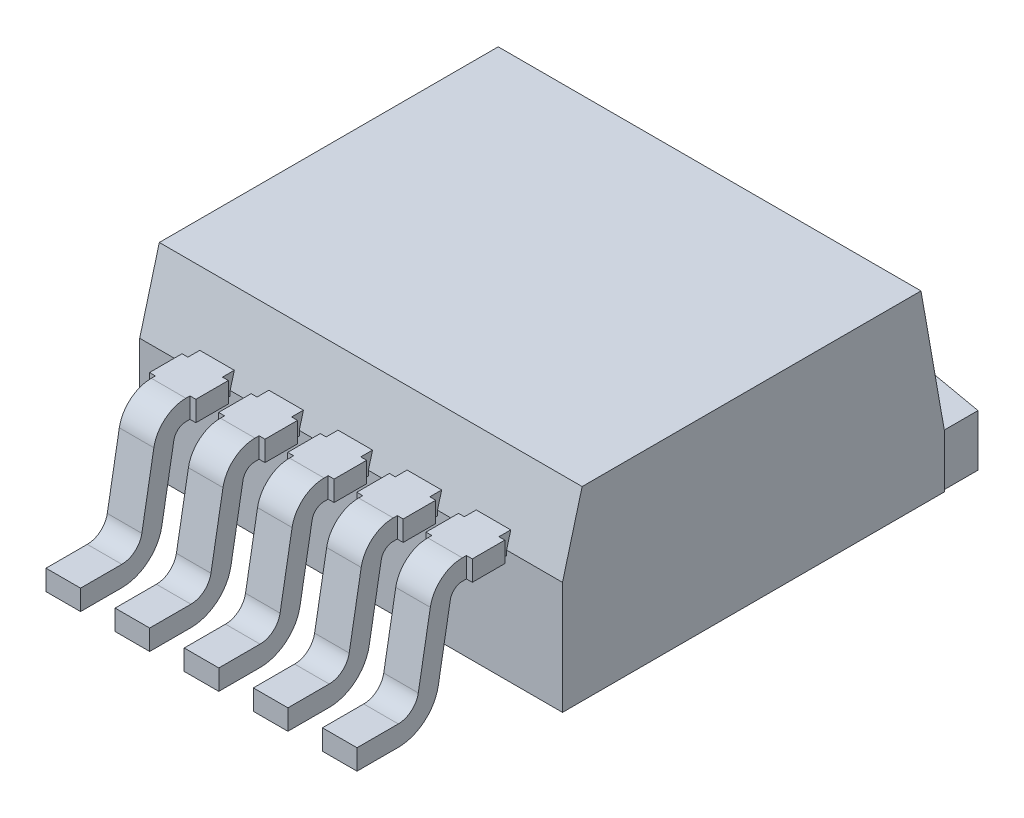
ISO-10303-21;
HEADER;
FILE_DESCRIPTION(('STEP AP214'),'2;1');
FILE_NAME('part.step','',(''),(''),'','','');
FILE_SCHEMA(('AUTOMOTIVE_DESIGN { 1 0 10303 214 1 1 1 1 }'));
ENDSEC;
DATA;
#1=APPLICATION_CONTEXT('core data for automotive mechanical design processes');
#2=APPLICATION_PROTOCOL_DEFINITION('international standard','automotive_design',2000,#1);
#3=PRODUCT_CONTEXT('',#1,'mechanical');
#4=PRODUCT('Part','Part','',(#3));
#5=PRODUCT_RELATED_PRODUCT_CATEGORY('part','',(#4));
#6=PRODUCT_DEFINITION_FORMATION('','',#4);
#7=PRODUCT_DEFINITION_CONTEXT('part definition',#1,'design');
#8=PRODUCT_DEFINITION('design','',#6,#7);
#9=PRODUCT_DEFINITION_SHAPE('','',#8);
#10=(LENGTH_UNIT() NAMED_UNIT(*) SI_UNIT(.MILLI.,.METRE.));
#11=(NAMED_UNIT(*) PLANE_ANGLE_UNIT() SI_UNIT($,.RADIAN.));
#12=(NAMED_UNIT(*) SI_UNIT($,.STERADIAN.) SOLID_ANGLE_UNIT());
#13=UNCERTAINTY_MEASURE_WITH_UNIT(LENGTH_MEASURE(1.E-05),#10,'distance_accuracy_value','');
#14=(GEOMETRIC_REPRESENTATION_CONTEXT(3) GLOBAL_UNCERTAINTY_ASSIGNED_CONTEXT((#13)) GLOBAL_UNIT_ASSIGNED_CONTEXT((#10,
#11,#12)) REPRESENTATION_CONTEXT('',''));
#15=CARTESIAN_POINT('',(0.,0.,0.));
#16=DIRECTION('',(0.,0.,1.));
#17=DIRECTION('',(1.,0.,0.));
#18=AXIS2_PLACEMENT_3D('',#15,#16,#17);
#19=CARTESIAN_POINT('',(3.825,2.45,4.43907903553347));
#20=DIRECTION('',(1.,0.,0.));
#21=DIRECTION('',(0.,0.,-1.));
#22=AXIS2_PLACEMENT_3D('',#19,#20,#21);
#23=PLANE('',#22);
#24=DIRECTION('',(0.,0.,1.));
#25=VECTOR('',#24,1.);
#26=CARTESIAN_POINT('',(3.825,3.25,2.85));
#27=LINE('',#26,#25);
#28=CARTESIAN_POINT('',(3.825,3.25,3.24817930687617));
#29=VERTEX_POINT('',#28);
#30=CARTESIAN_POINT('',(3.825,3.25,3.53907903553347));
#31=VERTEX_POINT('',#30);
#32=EDGE_CURVE('E990',#29,#31,#27,.T.);
#33=ORIENTED_EDGE('',*,*,#32,.T.);
#34=DIRECTION('',(0.,-1.,0.));
#35=VECTOR('',#34,1.);
#36=CARTESIAN_POINT('',(3.825,2.45,3.53907903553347));
#37=LINE('',#36,#35);
#38=CARTESIAN_POINT('',(3.825,2.75,3.53907903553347));
#39=VERTEX_POINT('',#38);
#40=EDGE_CURVE('E835',#31,#39,#37,.T.);
#41=ORIENTED_EDGE('',*,*,#40,.T.);
#42=DIRECTION('',(0.,0.,-1.));
#43=VECTOR('',#42,1.);
#44=CARTESIAN_POINT('',(3.825,2.75,2.85));
#45=LINE('',#44,#43);
#46=CARTESIAN_POINT('',(3.825,2.75,3.35));
#47=VERTEX_POINT('',#46);
#48=EDGE_CURVE('E1011',#39,#47,#45,.T.);
#49=ORIENTED_EDGE('',*,*,#48,.T.);
#50=DIRECTION('',(0.,-1.,0.));
#51=VECTOR('',#50,1.);
#52=CARTESIAN_POINT('',(3.825,4.67,3.35));
#53=LINE('',#52,#51);
#54=CARTESIAN_POINT('',(3.825,2.86999999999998,3.35));
#55=VERTEX_POINT('',#54);
#56=EDGE_CURVE('E1071',#55,#47,#53,.T.);
#57=ORIENTED_EDGE('',*,*,#56,.F.);
#58=DIRECTION('',(0.,-0.965925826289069,0.258819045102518));
#59=VECTOR('',#58,1.);
#60=CARTESIAN_POINT('',(3.825,4.67,2.86769145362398));
#61=LINE('',#60,#59);
#62=EDGE_CURVE('E38',#55,#29,#61,.F.);
#63=ORIENTED_EDGE('',*,*,#62,.T.);
#64=EDGE_LOOP('',(#33,#41,#49,#57,#63));
#65=FACE_BOUND('',#64,.T.);
#66=ADVANCED_FACE('F30',(#65),#23,.T.);
#67=CARTESIAN_POINT('',(3.825,2.75,4.43907903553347));
#68=VERTEX_POINT('',#67);
#69=CARTESIAN_POINT('',(3.825,2.75,4.33907903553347));
#70=VERTEX_POINT('',#69);
#71=EDGE_CURVE('E45',#68,#70,#45,.T.);
#72=ORIENTED_EDGE('',*,*,#71,.T.);
#73=DIRECTION('',(0.,1.,0.));
#74=VECTOR('',#73,1.);
#75=CARTESIAN_POINT('',(3.825,2.45,4.33907903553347));
#76=LINE('',#75,#74);
#77=CARTESIAN_POINT('',(3.825,3.25,4.33907903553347));
#78=VERTEX_POINT('',#77);
#79=EDGE_CURVE('E839',#70,#78,#76,.T.);
#80=ORIENTED_EDGE('',*,*,#79,.T.);
#81=CARTESIAN_POINT('',(3.825,3.25,4.43907903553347));
#82=VERTEX_POINT('',#81);
#83=EDGE_CURVE('E993',#78,#82,#27,.T.);
#84=ORIENTED_EDGE('',*,*,#83,.T.);
#85=CARTESIAN_POINT('',(3.825,2.45,4.43907903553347));
#86=DIRECTION('',(1.,0.,0.));
#87=DIRECTION('',(0.,0.,-1.));
#88=AXIS2_PLACEMENT_3D('',#85,#86,#87);
#89=CIRCLE('',#88,0.799999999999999);
#90=CARTESIAN_POINT('',(3.825,2.58891854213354,5.22692523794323));
#91=VERTEX_POINT('',#90);
#92=EDGE_CURVE('E992',#82,#91,#89,.T.);
#93=ORIENTED_EDGE('',*,*,#92,.T.);
#94=DIRECTION('',(0.,-0.984807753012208,0.173648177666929));
#95=VECTOR('',#94,1.);
#96=CARTESIAN_POINT('',(3.825,2.58891854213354,5.22692523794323));
#97=LINE('',#96,#95);
#98=CARTESIAN_POINT('',(3.825,0.913175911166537,5.5224038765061));
#99=VERTEX_POINT('',#98);
#100=EDGE_CURVE('E995',#91,#99,#97,.T.);
#101=ORIENTED_EDGE('',*,*,#100,.T.);
#102=CARTESIAN_POINT('',(3.825,1.,6.01480775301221));
#103=DIRECTION('',(-1.,0.,0.));
#104=DIRECTION('',(0.,0.,1.));
#105=AXIS2_PLACEMENT_3D('',#102,#103,#104);
#106=CIRCLE('',#105,0.5);
#107=CARTESIAN_POINT('',(3.825,0.5,6.01480775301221));
#108=VERTEX_POINT('',#107);
#109=EDGE_CURVE('E997',#99,#108,#106,.T.);
#110=ORIENTED_EDGE('',*,*,#109,.T.);
#111=DIRECTION('',(0.,0.,1.));
#112=VECTOR('',#111,1.);
#113=CARTESIAN_POINT('',(3.825,0.5,6.01480775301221));
#114=LINE('',#113,#112);
#115=CARTESIAN_POINT('',(3.825,0.5,7.03));
#116=VERTEX_POINT('',#115);
#117=EDGE_CURVE('E999',#108,#116,#114,.T.);
#118=ORIENTED_EDGE('',*,*,#117,.T.);
#119=DIRECTION('',(0.,-1.,0.));
#120=VECTOR('',#119,1.);
#121=CARTESIAN_POINT('',(3.825,0.,7.03));
#122=LINE('',#121,#120);
#123=CARTESIAN_POINT('',(3.825,0.,7.03));
#124=VERTEX_POINT('',#123);
#125=EDGE_CURVE('E1001',#116,#124,#122,.T.);
#126=ORIENTED_EDGE('',*,*,#125,.T.);
#127=DIRECTION('',(0.,0.,-1.));
#128=VECTOR('',#127,1.);
#129=CARTESIAN_POINT('',(3.825,0.,6.01480775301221));
#130=LINE('',#129,#128);
#131=CARTESIAN_POINT('',(3.825,0.,6.01480775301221));
#132=VERTEX_POINT('',#131);
#133=EDGE_CURVE('E1003',#124,#132,#130,.T.);
#134=ORIENTED_EDGE('',*,*,#133,.T.);
#135=CARTESIAN_POINT('',(3.825,1.,6.01480775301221));
#136=DIRECTION('',(1.,0.,0.));
#137=DIRECTION('',(0.,0.,1.));
#138=AXIS2_PLACEMENT_3D('',#135,#136,#137);
#139=CIRCLE('',#138,1.);
#140=CARTESIAN_POINT('',(3.825,0.826351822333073,5.03));
#141=VERTEX_POINT('',#140);
#142=EDGE_CURVE('E1005',#132,#141,#139,.T.);
#143=ORIENTED_EDGE('',*,*,#142,.T.);
#144=DIRECTION('',(0.,0.984807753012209,-0.173648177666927));
#145=VECTOR('',#144,1.);
#146=CARTESIAN_POINT('',(3.825,2.50209445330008,4.73452136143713));
#147=LINE('',#146,#145);
#148=CARTESIAN_POINT('',(3.825,2.50209445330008,4.73452136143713));
#149=VERTEX_POINT('',#148);
#150=EDGE_CURVE('E1007',#141,#149,#147,.T.);
#151=ORIENTED_EDGE('',*,*,#150,.T.);
#152=CARTESIAN_POINT('',(3.825,2.45,4.43907903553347));
#153=DIRECTION('',(-1.,0.,0.));
#154=DIRECTION('',(0.,0.,-1.));
#155=AXIS2_PLACEMENT_3D('',#152,#153,#154);
#156=CIRCLE('',#155,0.3);
#157=EDGE_CURVE('E1009',#149,#68,#156,.T.);
#158=ORIENTED_EDGE('',*,*,#157,.T.);
#159=EDGE_LOOP('',(#72,#80,#84,#93,#101,#110,#118,#126,#134,#143,#151,#158));
#160=FACE_BOUND('',#159,.T.);
#161=ADVANCED_FACE('F1734',(#160),#23,.T.);
#162=CARTESIAN_POINT('',(2.975,2.45,4.43907903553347));
#163=DIRECTION('',(1.,0.,0.));
#164=DIRECTION('',(0.,0.,-1.));
#165=AXIS2_PLACEMENT_3D('',#162,#163,#164);
#166=PLANE('',#165);
#167=DIRECTION('',(0.,-1.,0.));
#168=VECTOR('',#167,1.);
#169=CARTESIAN_POINT('',(2.975,2.45,3.53907903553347));
#170=LINE('',#169,#168);
#171=CARTESIAN_POINT('',(2.975,3.25,3.53907903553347));
#172=VERTEX_POINT('',#171);
#173=CARTESIAN_POINT('',(2.975,2.75,3.53907903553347));
#174=VERTEX_POINT('',#173);
#175=EDGE_CURVE('E845',#172,#174,#170,.T.);
#176=ORIENTED_EDGE('',*,*,#175,.F.);
#177=DIRECTION('',(0.,0.,1.));
#178=VECTOR('',#177,1.);
#179=CARTESIAN_POINT('',(2.975,3.25,2.85));
#180=LINE('',#179,#178);
#181=CARTESIAN_POINT('',(2.975,3.25,3.24817930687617));
#182=VERTEX_POINT('',#181);
#183=EDGE_CURVE('E1014',#182,#172,#180,.T.);
#184=ORIENTED_EDGE('',*,*,#183,.F.);
#185=DIRECTION('',(0.,-0.965925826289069,0.258819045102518));
#186=VECTOR('',#185,1.);
#187=CARTESIAN_POINT('',(2.975,4.67,2.86769145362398));
#188=LINE('',#187,#186);
#189=CARTESIAN_POINT('',(2.975,2.86999999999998,3.35));
#190=VERTEX_POINT('',#189);
#191=EDGE_CURVE('E1664',#190,#182,#188,.F.);
#192=ORIENTED_EDGE('',*,*,#191,.F.);
#193=DIRECTION('',(0.,-1.,0.));
#194=VECTOR('',#193,1.);
#195=CARTESIAN_POINT('',(2.975,4.67,3.35));
#196=LINE('',#195,#194);
#197=CARTESIAN_POINT('',(2.975,2.75,3.35));
#198=VERTEX_POINT('',#197);
#199=EDGE_CURVE('E1068',#190,#198,#196,.T.);
#200=ORIENTED_EDGE('',*,*,#199,.T.);
#201=DIRECTION('',(0.,0.,-1.));
#202=VECTOR('',#201,1.);
#203=CARTESIAN_POINT('',(2.975,2.75,2.85));
#204=LINE('',#203,#202);
#205=EDGE_CURVE('E1035',#174,#198,#204,.T.);
#206=ORIENTED_EDGE('',*,*,#205,.F.);
#207=EDGE_LOOP('',(#176,#184,#192,#200,#206));
#208=FACE_BOUND('',#207,.T.);
#209=ADVANCED_FACE('F1679',(#208),#166,.F.);
#210=DIRECTION('',(0.,1.,0.));
#211=VECTOR('',#210,1.);
#212=CARTESIAN_POINT('',(2.975,2.45,4.33907903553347));
#213=LINE('',#212,#211);
#214=CARTESIAN_POINT('',(2.975,2.75,4.33907903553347));
#215=VERTEX_POINT('',#214);
#216=CARTESIAN_POINT('',(2.975,3.25,4.33907903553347));
#217=VERTEX_POINT('',#216);
#218=EDGE_CURVE('E836',#215,#217,#213,.T.);
#219=ORIENTED_EDGE('',*,*,#218,.F.);
#220=CARTESIAN_POINT('',(2.975,2.75,4.43907903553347));
#221=VERTEX_POINT('',#220);
#222=EDGE_CURVE('E1036',#221,#215,#204,.T.);
#223=ORIENTED_EDGE('',*,*,#222,.F.);
#224=CARTESIAN_POINT('',(2.975,2.45,4.43907903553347));
#225=DIRECTION('',(-1.,0.,0.));
#226=DIRECTION('',(0.,0.,-1.));
#227=AXIS2_PLACEMENT_3D('',#224,#225,#226);
#228=CIRCLE('',#227,0.3);
#229=CARTESIAN_POINT('',(2.975,2.50209445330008,4.73452136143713));
#230=VERTEX_POINT('',#229);
#231=EDGE_CURVE('E1033',#230,#221,#228,.T.);
#232=ORIENTED_EDGE('',*,*,#231,.F.);
#233=DIRECTION('',(0.,0.984807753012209,-0.173648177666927));
#234=VECTOR('',#233,1.);
#235=CARTESIAN_POINT('',(2.975,2.50209445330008,4.73452136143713));
#236=LINE('',#235,#234);
#237=CARTESIAN_POINT('',(2.975,0.826351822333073,5.03));
#238=VERTEX_POINT('',#237);
#239=EDGE_CURVE('E1031',#238,#230,#236,.T.);
#240=ORIENTED_EDGE('',*,*,#239,.F.);
#241=CARTESIAN_POINT('',(2.975,1.,6.01480775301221));
#242=DIRECTION('',(1.,0.,0.));
#243=DIRECTION('',(0.,0.,1.));
#244=AXIS2_PLACEMENT_3D('',#241,#242,#243);
#245=CIRCLE('',#244,1.);
#246=CARTESIAN_POINT('',(2.975,0.,6.01480775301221));
#247=VERTEX_POINT('',#246);
#248=EDGE_CURVE('E1029',#247,#238,#245,.T.);
#249=ORIENTED_EDGE('',*,*,#248,.F.);
#250=DIRECTION('',(0.,0.,-1.));
#251=VECTOR('',#250,1.);
#252=CARTESIAN_POINT('',(2.975,0.,6.01480775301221));
#253=LINE('',#252,#251);
#254=CARTESIAN_POINT('',(2.975,0.,7.03));
#255=VERTEX_POINT('',#254);
#256=EDGE_CURVE('E1027',#255,#247,#253,.T.);
#257=ORIENTED_EDGE('',*,*,#256,.F.);
#258=DIRECTION('',(0.,-1.,0.));
#259=VECTOR('',#258,1.);
#260=CARTESIAN_POINT('',(2.975,0.,7.03));
#261=LINE('',#260,#259);
#262=CARTESIAN_POINT('',(2.975,0.5,7.03));
#263=VERTEX_POINT('',#262);
#264=EDGE_CURVE('E1025',#263,#255,#261,.T.);
#265=ORIENTED_EDGE('',*,*,#264,.F.);
#266=DIRECTION('',(0.,0.,1.));
#267=VECTOR('',#266,1.);
#268=CARTESIAN_POINT('',(2.975,0.5,6.01480775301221));
#269=LINE('',#268,#267);
#270=CARTESIAN_POINT('',(2.975,0.5,6.01480775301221));
#271=VERTEX_POINT('',#270);
#272=EDGE_CURVE('E1023',#271,#263,#269,.T.);
#273=ORIENTED_EDGE('',*,*,#272,.F.);
#274=CARTESIAN_POINT('',(2.975,1.,6.01480775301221));
#275=DIRECTION('',(-1.,0.,0.));
#276=DIRECTION('',(0.,0.,1.));
#277=AXIS2_PLACEMENT_3D('',#274,#275,#276);
#278=CIRCLE('',#277,0.5);
#279=CARTESIAN_POINT('',(2.975,0.913175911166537,5.5224038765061));
#280=VERTEX_POINT('',#279);
#281=EDGE_CURVE('E1021',#280,#271,#278,.T.);
#282=ORIENTED_EDGE('',*,*,#281,.F.);
#283=DIRECTION('',(0.,-0.984807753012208,0.173648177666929));
#284=VECTOR('',#283,1.);
#285=CARTESIAN_POINT('',(2.975,2.58891854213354,5.22692523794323));
#286=LINE('',#285,#284);
#287=CARTESIAN_POINT('',(2.975,2.58891854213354,5.22692523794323));
#288=VERTEX_POINT('',#287);
#289=EDGE_CURVE('E1019',#288,#280,#286,.T.);
#290=ORIENTED_EDGE('',*,*,#289,.F.);
#291=CARTESIAN_POINT('',(2.975,2.45,4.43907903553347));
#292=DIRECTION('',(1.,0.,0.));
#293=DIRECTION('',(0.,0.,-1.));
#294=AXIS2_PLACEMENT_3D('',#291,#292,#293);
#295=CIRCLE('',#294,0.799999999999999);
#296=CARTESIAN_POINT('',(2.975,3.25,4.43907903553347));
#297=VERTEX_POINT('',#296);
#298=EDGE_CURVE('E1017',#297,#288,#295,.T.);
#299=ORIENTED_EDGE('',*,*,#298,.F.);
#300=EDGE_CURVE('E989',#217,#297,#180,.T.);
#301=ORIENTED_EDGE('',*,*,#300,.F.);
#302=EDGE_LOOP('',(#219,#223,#232,#240,#249,#257,#265,#273,#282,#290,#299,#301));
#303=FACE_BOUND('',#302,.T.);
#304=ADVANCED_FACE('F1722',(#303),#166,.F.);
#305=CARTESIAN_POINT('',(2.125,2.45,4.43907903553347));
#306=DIRECTION('',(1.,0.,0.));
#307=DIRECTION('',(0.,0.,-1.));
#308=AXIS2_PLACEMENT_3D('',#305,#306,#307);
#309=PLANE('',#308);
#310=DIRECTION('',(0.,0.,1.));
#311=VECTOR('',#310,1.);
#312=CARTESIAN_POINT('',(2.125,3.25,2.85));
#313=LINE('',#312,#311);
#314=CARTESIAN_POINT('',(2.125,3.25,3.24817930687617));
#315=VERTEX_POINT('',#314);
#316=CARTESIAN_POINT('',(2.125,3.25,3.53907903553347));
#317=VERTEX_POINT('',#316);
#318=EDGE_CURVE('E1075',#315,#317,#313,.T.);
#319=ORIENTED_EDGE('',*,*,#318,.T.);
#320=DIRECTION('',(0.,-1.,0.));
#321=VECTOR('',#320,1.);
#322=CARTESIAN_POINT('',(2.125,2.45,3.53907903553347));
#323=LINE('',#322,#321);
#324=CARTESIAN_POINT('',(2.125,2.75,3.53907903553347));
#325=VERTEX_POINT('',#324);
#326=EDGE_CURVE('E892',#317,#325,#323,.T.);
#327=ORIENTED_EDGE('',*,*,#326,.T.);
#328=DIRECTION('',(0.,0.,-1.));
#329=VECTOR('',#328,1.);
#330=CARTESIAN_POINT('',(2.125,2.75,2.85));
#331=LINE('',#330,#329);
#332=CARTESIAN_POINT('',(2.125,2.75,3.35));
#333=VERTEX_POINT('',#332);
#334=EDGE_CURVE('E1096',#325,#333,#331,.T.);
#335=ORIENTED_EDGE('',*,*,#334,.T.);
#336=DIRECTION('',(0.,-1.,0.));
#337=VECTOR('',#336,1.);
#338=CARTESIAN_POINT('',(2.125,4.67,3.35));
#339=LINE('',#338,#337);
#340=CARTESIAN_POINT('',(2.125,2.86999999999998,3.35));
#341=VERTEX_POINT('',#340);
#342=EDGE_CURVE('E1157',#341,#333,#339,.T.);
#343=ORIENTED_EDGE('',*,*,#342,.F.);
#344=DIRECTION('',(0.,-0.965925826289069,0.258819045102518));
#345=VECTOR('',#344,1.);
#346=CARTESIAN_POINT('',(2.125,4.67,2.86769145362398));
#347=LINE('',#346,#345);
#348=EDGE_CURVE('E1659',#341,#315,#347,.F.);
#349=ORIENTED_EDGE('',*,*,#348,.T.);
#350=EDGE_LOOP('',(#319,#327,#335,#343,#349));
#351=FACE_BOUND('',#350,.T.);
#352=ADVANCED_FACE('F1797',(#351),#309,.T.);
#353=CARTESIAN_POINT('',(2.125,2.75,4.43907903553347));
#354=VERTEX_POINT('',#353);
#355=CARTESIAN_POINT('',(2.125,2.75,4.33907903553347));
#356=VERTEX_POINT('',#355);
#357=EDGE_CURVE('E1097',#354,#356,#331,.T.);
#358=ORIENTED_EDGE('',*,*,#357,.T.);
#359=DIRECTION('',(0.,1.,0.));
#360=VECTOR('',#359,1.);
#361=CARTESIAN_POINT('',(2.125,2.45,4.33907903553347));
#362=LINE('',#361,#360);
#363=CARTESIAN_POINT('',(2.125,3.25,4.33907903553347));
#364=VERTEX_POINT('',#363);
#365=EDGE_CURVE('E887',#356,#364,#362,.T.);
#366=ORIENTED_EDGE('',*,*,#365,.T.);
#367=CARTESIAN_POINT('',(2.125,3.25,4.43907903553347));
#368=VERTEX_POINT('',#367);
#369=EDGE_CURVE('E1078',#364,#368,#313,.T.);
#370=ORIENTED_EDGE('',*,*,#369,.T.);
#371=CARTESIAN_POINT('',(2.125,2.45,4.43907903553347));
#372=DIRECTION('',(1.,0.,0.));
#373=DIRECTION('',(0.,0.,-1.));
#374=AXIS2_PLACEMENT_3D('',#371,#372,#373);
#375=CIRCLE('',#374,0.799999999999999);
#376=CARTESIAN_POINT('',(2.125,2.58891854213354,5.22692523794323));
#377=VERTEX_POINT('',#376);
#378=EDGE_CURVE('E1077',#368,#377,#375,.T.);
#379=ORIENTED_EDGE('',*,*,#378,.T.);
#380=DIRECTION('',(0.,-0.984807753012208,0.173648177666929));
#381=VECTOR('',#380,1.);
#382=CARTESIAN_POINT('',(2.125,2.58891854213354,5.22692523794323));
#383=LINE('',#382,#381);
#384=CARTESIAN_POINT('',(2.125,0.913175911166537,5.5224038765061));
#385=VERTEX_POINT('',#384);
#386=EDGE_CURVE('E1080',#377,#385,#383,.T.);
#387=ORIENTED_EDGE('',*,*,#386,.T.);
#388=CARTESIAN_POINT('',(2.125,1.,6.01480775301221));
#389=DIRECTION('',(-1.,0.,0.));
#390=DIRECTION('',(0.,0.,1.));
#391=AXIS2_PLACEMENT_3D('',#388,#389,#390);
#392=CIRCLE('',#391,0.5);
#393=CARTESIAN_POINT('',(2.125,0.5,6.01480775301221));
#394=VERTEX_POINT('',#393);
#395=EDGE_CURVE('E1082',#385,#394,#392,.T.);
#396=ORIENTED_EDGE('',*,*,#395,.T.);
#397=DIRECTION('',(0.,0.,1.));
#398=VECTOR('',#397,1.);
#399=CARTESIAN_POINT('',(2.125,0.5,6.01480775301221));
#400=LINE('',#399,#398);
#401=CARTESIAN_POINT('',(2.125,0.5,7.03));
#402=VERTEX_POINT('',#401);
#403=EDGE_CURVE('E1084',#394,#402,#400,.T.);
#404=ORIENTED_EDGE('',*,*,#403,.T.);
#405=DIRECTION('',(0.,-1.,0.));
#406=VECTOR('',#405,1.);
#407=CARTESIAN_POINT('',(2.125,0.,7.03));
#408=LINE('',#407,#406);
#409=CARTESIAN_POINT('',(2.125,0.,7.03));
#410=VERTEX_POINT('',#409);
#411=EDGE_CURVE('E1086',#402,#410,#408,.T.);
#412=ORIENTED_EDGE('',*,*,#411,.T.);
#413=DIRECTION('',(0.,0.,-1.));
#414=VECTOR('',#413,1.);
#415=CARTESIAN_POINT('',(2.125,0.,6.01480775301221));
#416=LINE('',#415,#414);
#417=CARTESIAN_POINT('',(2.125,0.,6.01480775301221));
#418=VERTEX_POINT('',#417);
#419=EDGE_CURVE('E1088',#410,#418,#416,.T.);
#420=ORIENTED_EDGE('',*,*,#419,.T.);
#421=CARTESIAN_POINT('',(2.125,1.,6.01480775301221));
#422=DIRECTION('',(1.,0.,0.));
#423=DIRECTION('',(0.,0.,1.));
#424=AXIS2_PLACEMENT_3D('',#421,#422,#423);
#425=CIRCLE('',#424,1.);
#426=CARTESIAN_POINT('',(2.125,0.826351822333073,5.03));
#427=VERTEX_POINT('',#426);
#428=EDGE_CURVE('E1090',#418,#427,#425,.T.);
#429=ORIENTED_EDGE('',*,*,#428,.T.);
#430=DIRECTION('',(0.,0.984807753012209,-0.173648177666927));
#431=VECTOR('',#430,1.);
#432=CARTESIAN_POINT('',(2.125,2.50209445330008,4.73452136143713));
#433=LINE('',#432,#431);
#434=CARTESIAN_POINT('',(2.125,2.50209445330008,4.73452136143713));
#435=VERTEX_POINT('',#434);
#436=EDGE_CURVE('E1092',#427,#435,#433,.T.);
#437=ORIENTED_EDGE('',*,*,#436,.T.);
#438=CARTESIAN_POINT('',(2.125,2.45,4.43907903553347));
#439=DIRECTION('',(-1.,0.,0.));
#440=DIRECTION('',(0.,0.,-1.));
#441=AXIS2_PLACEMENT_3D('',#438,#439,#440);
#442=CIRCLE('',#441,0.3);
#443=EDGE_CURVE('E1094',#435,#354,#442,.T.);
#444=ORIENTED_EDGE('',*,*,#443,.T.);
#445=EDGE_LOOP('',(#358,#366,#370,#379,#387,#396,#404,#412,#420,#429,#437,#444));
#446=FACE_BOUND('',#445,.T.);
#447=ADVANCED_FACE('F1800',(#446),#309,.T.);
#448=CARTESIAN_POINT('',(1.275,2.45,4.43907903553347));
#449=DIRECTION('',(1.,0.,0.));
#450=DIRECTION('',(0.,0.,-1.));
#451=AXIS2_PLACEMENT_3D('',#448,#449,#450);
#452=PLANE('',#451);
#453=DIRECTION('',(0.,-1.,0.));
#454=VECTOR('',#453,1.);
#455=CARTESIAN_POINT('',(1.275,2.45,3.53907903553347));
#456=LINE('',#455,#454);
#457=CARTESIAN_POINT('',(1.275,3.25,3.53907903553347));
#458=VERTEX_POINT('',#457);
#459=CARTESIAN_POINT('',(1.275,2.75,3.53907903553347));
#460=VERTEX_POINT('',#459);
#461=EDGE_CURVE('E889',#458,#460,#456,.T.);
#462=ORIENTED_EDGE('',*,*,#461,.F.);
#463=DIRECTION('',(0.,0.,1.));
#464=VECTOR('',#463,1.);
#465=CARTESIAN_POINT('',(1.275,3.25,2.85));
#466=LINE('',#465,#464);
#467=CARTESIAN_POINT('',(1.275,3.25,3.24817930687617));
#468=VERTEX_POINT('',#467);
#469=EDGE_CURVE('E1100',#468,#458,#466,.T.);
#470=ORIENTED_EDGE('',*,*,#469,.F.);
#471=DIRECTION('',(0.,-0.965925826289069,0.258819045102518));
#472=VECTOR('',#471,1.);
#473=CARTESIAN_POINT('',(1.275,4.67,2.86769145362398));
#474=LINE('',#473,#472);
#475=CARTESIAN_POINT('',(1.275,2.86999999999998,3.35));
#476=VERTEX_POINT('',#475);
#477=EDGE_CURVE('E1653',#476,#468,#474,.F.);
#478=ORIENTED_EDGE('',*,*,#477,.F.);
#479=DIRECTION('',(0.,-1.,0.));
#480=VECTOR('',#479,1.);
#481=CARTESIAN_POINT('',(1.275,4.67,3.35));
#482=LINE('',#481,#480);
#483=CARTESIAN_POINT('',(1.275,2.75,3.35));
#484=VERTEX_POINT('',#483);
#485=EDGE_CURVE('E1154',#476,#484,#482,.T.);
#486=ORIENTED_EDGE('',*,*,#485,.T.);
#487=DIRECTION('',(0.,0.,-1.));
#488=VECTOR('',#487,1.);
#489=CARTESIAN_POINT('',(1.275,2.75,2.85));
#490=LINE('',#489,#488);
#491=EDGE_CURVE('E1121',#460,#484,#490,.T.);
#492=ORIENTED_EDGE('',*,*,#491,.F.);
#493=EDGE_LOOP('',(#462,#470,#478,#486,#492));
#494=FACE_BOUND('',#493,.T.);
#495=ADVANCED_FACE('F1802',(#494),#452,.F.);
#496=DIRECTION('',(0.,1.,0.));
#497=VECTOR('',#496,1.);
#498=CARTESIAN_POINT('',(1.275,2.45,4.33907903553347));
#499=LINE('',#498,#497);
#500=CARTESIAN_POINT('',(1.275,2.75,4.33907903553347));
#501=VERTEX_POINT('',#500);
#502=CARTESIAN_POINT('',(1.275,3.25,4.33907903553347));
#503=VERTEX_POINT('',#502);
#504=EDGE_CURVE('E885',#501,#503,#499,.T.);
#505=ORIENTED_EDGE('',*,*,#504,.F.);
#506=CARTESIAN_POINT('',(1.275,2.75,4.43907903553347));
#507=VERTEX_POINT('',#506);
#508=EDGE_CURVE('E1122',#507,#501,#490,.T.);
#509=ORIENTED_EDGE('',*,*,#508,.F.);
#510=CARTESIAN_POINT('',(1.275,2.45,4.43907903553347));
#511=DIRECTION('',(-1.,0.,0.));
#512=DIRECTION('',(0.,0.,-1.));
#513=AXIS2_PLACEMENT_3D('',#510,#511,#512);
#514=CIRCLE('',#513,0.3);
#515=CARTESIAN_POINT('',(1.275,2.50209445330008,4.73452136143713));
#516=VERTEX_POINT('',#515);
#517=EDGE_CURVE('E1119',#516,#507,#514,.T.);
#518=ORIENTED_EDGE('',*,*,#517,.F.);
#519=DIRECTION('',(0.,0.984807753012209,-0.173648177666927));
#520=VECTOR('',#519,1.);
#521=CARTESIAN_POINT('',(1.275,2.50209445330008,4.73452136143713));
#522=LINE('',#521,#520);
#523=CARTESIAN_POINT('',(1.275,0.826351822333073,5.03));
#524=VERTEX_POINT('',#523);
#525=EDGE_CURVE('E1117',#524,#516,#522,.T.);
#526=ORIENTED_EDGE('',*,*,#525,.F.);
#527=CARTESIAN_POINT('',(1.275,1.,6.01480775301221));
#528=DIRECTION('',(1.,0.,0.));
#529=DIRECTION('',(0.,0.,1.));
#530=AXIS2_PLACEMENT_3D('',#527,#528,#529);
#531=CIRCLE('',#530,1.);
#532=CARTESIAN_POINT('',(1.275,0.,6.01480775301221));
#533=VERTEX_POINT('',#532);
#534=EDGE_CURVE('E1115',#533,#524,#531,.T.);
#535=ORIENTED_EDGE('',*,*,#534,.F.);
#536=DIRECTION('',(0.,0.,-1.));
#537=VECTOR('',#536,1.);
#538=CARTESIAN_POINT('',(1.275,0.,6.01480775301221));
#539=LINE('',#538,#537);
#540=CARTESIAN_POINT('',(1.275,0.,7.03));
#541=VERTEX_POINT('',#540);
#542=EDGE_CURVE('E1113',#541,#533,#539,.T.);
#543=ORIENTED_EDGE('',*,*,#542,.F.);
#544=DIRECTION('',(0.,-1.,0.));
#545=VECTOR('',#544,1.);
#546=CARTESIAN_POINT('',(1.275,0.,7.03));
#547=LINE('',#546,#545);
#548=CARTESIAN_POINT('',(1.275,0.5,7.03));
#549=VERTEX_POINT('',#548);
#550=EDGE_CURVE('E1111',#549,#541,#547,.T.);
#551=ORIENTED_EDGE('',*,*,#550,.F.);
#552=DIRECTION('',(0.,0.,1.));
#553=VECTOR('',#552,1.);
#554=CARTESIAN_POINT('',(1.275,0.5,6.01480775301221));
#555=LINE('',#554,#553);
#556=CARTESIAN_POINT('',(1.275,0.5,6.01480775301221));
#557=VERTEX_POINT('',#556);
#558=EDGE_CURVE('E1109',#557,#549,#555,.T.);
#559=ORIENTED_EDGE('',*,*,#558,.F.);
#560=CARTESIAN_POINT('',(1.275,1.,6.01480775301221));
#561=DIRECTION('',(-1.,0.,0.));
#562=DIRECTION('',(0.,0.,1.));
#563=AXIS2_PLACEMENT_3D('',#560,#561,#562);
#564=CIRCLE('',#563,0.5);
#565=CARTESIAN_POINT('',(1.275,0.913175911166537,5.5224038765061));
#566=VERTEX_POINT('',#565);
#567=EDGE_CURVE('E1107',#566,#557,#564,.T.);
#568=ORIENTED_EDGE('',*,*,#567,.F.);
#569=DIRECTION('',(0.,-0.984807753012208,0.173648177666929));
#570=VECTOR('',#569,1.);
#571=CARTESIAN_POINT('',(1.275,2.58891854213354,5.22692523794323));
#572=LINE('',#571,#570);
#573=CARTESIAN_POINT('',(1.275,2.58891854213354,5.22692523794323));
#574=VERTEX_POINT('',#573);
#575=EDGE_CURVE('E1105',#574,#566,#572,.T.);
#576=ORIENTED_EDGE('',*,*,#575,.F.);
#577=CARTESIAN_POINT('',(1.275,2.45,4.43907903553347));
#578=DIRECTION('',(1.,0.,0.));
#579=DIRECTION('',(0.,0.,-1.));
#580=AXIS2_PLACEMENT_3D('',#577,#578,#579);
#581=CIRCLE('',#580,0.799999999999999);
#582=CARTESIAN_POINT('',(1.275,3.25,4.43907903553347));
#583=VERTEX_POINT('',#582);
#584=EDGE_CURVE('E1103',#583,#574,#581,.T.);
#585=ORIENTED_EDGE('',*,*,#584,.F.);
#586=EDGE_CURVE('E1074',#503,#583,#466,.T.);
#587=ORIENTED_EDGE('',*,*,#586,.F.);
#588=EDGE_LOOP('',(#505,#509,#518,#526,#535,#543,#551,#559,#568,#576,#585,#587));
#589=FACE_BOUND('',#588,.T.);
#590=ADVANCED_FACE('F1805',(#589),#452,.F.);
#591=CARTESIAN_POINT('',(0.425,2.45,4.43907903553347));
#592=DIRECTION('',(1.,0.,0.));
#593=DIRECTION('',(0.,0.,-1.));
#594=AXIS2_PLACEMENT_3D('',#591,#592,#593);
#595=PLANE('',#594);
#596=DIRECTION('',(0.,0.,1.));
#597=VECTOR('',#596,1.);
#598=CARTESIAN_POINT('',(0.425,3.25,2.85));
#599=LINE('',#598,#597);
#600=CARTESIAN_POINT('',(0.425,3.25,3.24817930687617));
#601=VERTEX_POINT('',#600);
#602=CARTESIAN_POINT('',(0.425,3.25,3.53907903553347));
#603=VERTEX_POINT('',#602);
#604=EDGE_CURVE('E1161',#601,#603,#599,.T.);
#605=ORIENTED_EDGE('',*,*,#604,.T.);
#606=DIRECTION('',(0.,-1.,0.));
#607=VECTOR('',#606,1.);
#608=CARTESIAN_POINT('',(0.425,2.45,3.53907903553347));
#609=LINE('',#608,#607);
#610=CARTESIAN_POINT('',(0.425,2.75,3.53907903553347));
#611=VERTEX_POINT('',#610);
#612=EDGE_CURVE('E939',#603,#611,#609,.T.);
#613=ORIENTED_EDGE('',*,*,#612,.T.);
#614=DIRECTION('',(0.,0.,-1.));
#615=VECTOR('',#614,1.);
#616=CARTESIAN_POINT('',(0.425,2.75,2.85));
#617=LINE('',#616,#615);
#618=CARTESIAN_POINT('',(0.425,2.75,3.35));
#619=VERTEX_POINT('',#618);
#620=EDGE_CURVE('E1182',#611,#619,#617,.T.);
#621=ORIENTED_EDGE('',*,*,#620,.T.);
#622=DIRECTION('',(0.,-1.,0.));
#623=VECTOR('',#622,1.);
#624=CARTESIAN_POINT('',(0.425,4.67,3.35));
#625=LINE('',#624,#623);
#626=CARTESIAN_POINT('',(0.425,2.86999999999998,3.35));
#627=VERTEX_POINT('',#626);
#628=EDGE_CURVE('E1243',#627,#619,#625,.T.);
#629=ORIENTED_EDGE('',*,*,#628,.F.);
#630=DIRECTION('',(0.,-0.965925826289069,0.258819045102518));
#631=VECTOR('',#630,1.);
#632=CARTESIAN_POINT('',(0.425,4.67,2.86769145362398));
#633=LINE('',#632,#631);
#634=EDGE_CURVE('E1648',#627,#601,#633,.F.);
#635=ORIENTED_EDGE('',*,*,#634,.T.);
#636=EDGE_LOOP('',(#605,#613,#621,#629,#635));
#637=FACE_BOUND('',#636,.T.);
#638=ADVANCED_FACE('F1851',(#637),#595,.T.);
#639=CARTESIAN_POINT('',(0.425,2.75,4.43907903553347));
#640=VERTEX_POINT('',#639);
#641=CARTESIAN_POINT('',(0.425,2.75,4.33907903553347));
#642=VERTEX_POINT('',#641);
#643=EDGE_CURVE('E1183',#640,#642,#617,.T.);
#644=ORIENTED_EDGE('',*,*,#643,.T.);
#645=DIRECTION('',(0.,1.,0.));
#646=VECTOR('',#645,1.);
#647=CARTESIAN_POINT('',(0.425,2.45,4.33907903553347));
#648=LINE('',#647,#646);
#649=CARTESIAN_POINT('',(0.425,3.25,4.33907903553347));
#650=VERTEX_POINT('',#649);
#651=EDGE_CURVE('E934',#642,#650,#648,.T.);
#652=ORIENTED_EDGE('',*,*,#651,.T.);
#653=CARTESIAN_POINT('',(0.425,3.25,4.43907903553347));
#654=VERTEX_POINT('',#653);
#655=EDGE_CURVE('E1164',#650,#654,#599,.T.);
#656=ORIENTED_EDGE('',*,*,#655,.T.);
#657=CARTESIAN_POINT('',(0.425,2.45,4.43907903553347));
#658=DIRECTION('',(1.,0.,0.));
#659=DIRECTION('',(0.,0.,-1.));
#660=AXIS2_PLACEMENT_3D('',#657,#658,#659);
#661=CIRCLE('',#660,0.799999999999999);
#662=CARTESIAN_POINT('',(0.425,2.58891854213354,5.22692523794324));
#663=VERTEX_POINT('',#662);
#664=EDGE_CURVE('E1163',#654,#663,#661,.T.);
#665=ORIENTED_EDGE('',*,*,#664,.T.);
#666=DIRECTION('',(0.,-0.984807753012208,0.173648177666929));
#667=VECTOR('',#666,1.);
#668=CARTESIAN_POINT('',(0.425,2.58891854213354,5.22692523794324));
#669=LINE('',#668,#667);
#670=CARTESIAN_POINT('',(0.425,0.913175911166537,5.5224038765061));
#671=VERTEX_POINT('',#670);
#672=EDGE_CURVE('E1166',#663,#671,#669,.T.);
#673=ORIENTED_EDGE('',*,*,#672,.T.);
#674=CARTESIAN_POINT('',(0.425,1.,6.01480775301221));
#675=DIRECTION('',(-1.,0.,0.));
#676=DIRECTION('',(0.,0.,1.));
#677=AXIS2_PLACEMENT_3D('',#674,#675,#676);
#678=CIRCLE('',#677,0.5);
#679=CARTESIAN_POINT('',(0.425,0.5,6.01480775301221));
#680=VERTEX_POINT('',#679);
#681=EDGE_CURVE('E1168',#671,#680,#678,.T.);
#682=ORIENTED_EDGE('',*,*,#681,.T.);
#683=DIRECTION('',(0.,0.,1.));
#684=VECTOR('',#683,1.);
#685=CARTESIAN_POINT('',(0.425,0.5,6.01480775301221));
#686=LINE('',#685,#684);
#687=CARTESIAN_POINT('',(0.425,0.5,7.03));
#688=VERTEX_POINT('',#687);
#689=EDGE_CURVE('E1170',#680,#688,#686,.T.);
#690=ORIENTED_EDGE('',*,*,#689,.T.);
#691=DIRECTION('',(0.,-1.,0.));
#692=VECTOR('',#691,1.);
#693=CARTESIAN_POINT('',(0.425,0.,7.03));
#694=LINE('',#693,#692);
#695=CARTESIAN_POINT('',(0.425,0.,7.03));
#696=VERTEX_POINT('',#695);
#697=EDGE_CURVE('E1172',#688,#696,#694,.T.);
#698=ORIENTED_EDGE('',*,*,#697,.T.);
#699=DIRECTION('',(0.,0.,-1.));
#700=VECTOR('',#699,1.);
#701=CARTESIAN_POINT('',(0.425,0.,6.01480775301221));
#702=LINE('',#701,#700);
#703=CARTESIAN_POINT('',(0.425,0.,6.01480775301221));
#704=VERTEX_POINT('',#703);
#705=EDGE_CURVE('E1174',#696,#704,#702,.T.);
#706=ORIENTED_EDGE('',*,*,#705,.T.);
#707=CARTESIAN_POINT('',(0.425,1.,6.01480775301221));
#708=DIRECTION('',(1.,0.,0.));
#709=DIRECTION('',(0.,0.,1.));
#710=AXIS2_PLACEMENT_3D('',#707,#708,#709);
#711=CIRCLE('',#710,1.);
#712=CARTESIAN_POINT('',(0.425,0.826351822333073,5.03));
#713=VERTEX_POINT('',#712);
#714=EDGE_CURVE('E1176',#704,#713,#711,.T.);
#715=ORIENTED_EDGE('',*,*,#714,.T.);
#716=DIRECTION('',(0.,0.984807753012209,-0.173648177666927));
#717=VECTOR('',#716,1.);
#718=CARTESIAN_POINT('',(0.425,2.50209445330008,4.73452136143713));
#719=LINE('',#718,#717);
#720=CARTESIAN_POINT('',(0.425,2.50209445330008,4.73452136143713));
#721=VERTEX_POINT('',#720);
#722=EDGE_CURVE('E1178',#713,#721,#719,.T.);
#723=ORIENTED_EDGE('',*,*,#722,.T.);
#724=CARTESIAN_POINT('',(0.425,2.45,4.43907903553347));
#725=DIRECTION('',(-1.,0.,0.));
#726=DIRECTION('',(0.,0.,-1.));
#727=AXIS2_PLACEMENT_3D('',#724,#725,#726);
#728=CIRCLE('',#727,0.3);
#729=EDGE_CURVE('E1180',#721,#640,#728,.T.);
#730=ORIENTED_EDGE('',*,*,#729,.T.);
#731=EDGE_LOOP('',(#644,#652,#656,#665,#673,#682,#690,#698,#706,#715,#723,#730));
#732=FACE_BOUND('',#731,.T.);
#733=ADVANCED_FACE('F1854',(#732),#595,.T.);
#734=CARTESIAN_POINT('',(-0.425,2.45,4.43907903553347));
#735=DIRECTION('',(1.,0.,0.));
#736=DIRECTION('',(0.,0.,-1.));
#737=AXIS2_PLACEMENT_3D('',#734,#735,#736);
#738=PLANE('',#737);
#739=DIRECTION('',(0.,-1.,0.));
#740=VECTOR('',#739,1.);
#741=CARTESIAN_POINT('',(-0.425,2.45,3.53907903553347));
#742=LINE('',#741,#740);
#743=CARTESIAN_POINT('',(-0.425,3.25,3.53907903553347));
#744=VERTEX_POINT('',#743);
#745=CARTESIAN_POINT('',(-0.425,2.75,3.53907903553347));
#746=VERTEX_POINT('',#745);
#747=EDGE_CURVE('E936',#744,#746,#742,.T.);
#748=ORIENTED_EDGE('',*,*,#747,.F.);
#749=DIRECTION('',(0.,0.,1.));
#750=VECTOR('',#749,1.);
#751=CARTESIAN_POINT('',(-0.425,3.25,2.85));
#752=LINE('',#751,#750);
#753=CARTESIAN_POINT('',(-0.425,3.25,3.24817930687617));
#754=VERTEX_POINT('',#753);
#755=EDGE_CURVE('E1186',#754,#744,#752,.T.);
#756=ORIENTED_EDGE('',*,*,#755,.F.);
#757=DIRECTION('',(0.,-0.965925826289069,0.258819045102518));
#758=VECTOR('',#757,1.);
#759=CARTESIAN_POINT('',(-0.425,4.67,2.86769145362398));
#760=LINE('',#759,#758);
#761=CARTESIAN_POINT('',(-0.425,2.86999999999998,3.35));
#762=VERTEX_POINT('',#761);
#763=EDGE_CURVE('E1642',#762,#754,#760,.F.);
#764=ORIENTED_EDGE('',*,*,#763,.F.);
#765=DIRECTION('',(0.,-1.,0.));
#766=VECTOR('',#765,1.);
#767=CARTESIAN_POINT('',(-0.425,4.67,3.35));
#768=LINE('',#767,#766);
#769=CARTESIAN_POINT('',(-0.425,2.75,3.35));
#770=VERTEX_POINT('',#769);
#771=EDGE_CURVE('E1240',#762,#770,#768,.T.);
#772=ORIENTED_EDGE('',*,*,#771,.T.);
#773=DIRECTION('',(0.,0.,-1.));
#774=VECTOR('',#773,1.);
#775=CARTESIAN_POINT('',(-0.425,2.75,2.85));
#776=LINE('',#775,#774);
#777=EDGE_CURVE('E1207',#746,#770,#776,.T.);
#778=ORIENTED_EDGE('',*,*,#777,.F.);
#779=EDGE_LOOP('',(#748,#756,#764,#772,#778));
#780=FACE_BOUND('',#779,.T.);
#781=ADVANCED_FACE('F1856',(#780),#738,.F.);
#782=DIRECTION('',(0.,1.,0.));
#783=VECTOR('',#782,1.);
#784=CARTESIAN_POINT('',(-0.425,2.45,4.33907903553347));
#785=LINE('',#784,#783);
#786=CARTESIAN_POINT('',(-0.425,2.75,4.33907903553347));
#787=VERTEX_POINT('',#786);
#788=CARTESIAN_POINT('',(-0.425,3.25,4.33907903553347));
#789=VERTEX_POINT('',#788);
#790=EDGE_CURVE('E932',#787,#789,#785,.T.);
#791=ORIENTED_EDGE('',*,*,#790,.F.);
#792=CARTESIAN_POINT('',(-0.425,2.75,4.43907903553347));
#793=VERTEX_POINT('',#792);
#794=EDGE_CURVE('E1208',#793,#787,#776,.T.);
#795=ORIENTED_EDGE('',*,*,#794,.F.);
#796=CARTESIAN_POINT('',(-0.425,2.45,4.43907903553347));
#797=DIRECTION('',(-1.,0.,0.));
#798=DIRECTION('',(0.,0.,-1.));
#799=AXIS2_PLACEMENT_3D('',#796,#797,#798);
#800=CIRCLE('',#799,0.3);
#801=CARTESIAN_POINT('',(-0.425,2.50209445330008,4.73452136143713));
#802=VERTEX_POINT('',#801);
#803=EDGE_CURVE('E1205',#802,#793,#800,.T.);
#804=ORIENTED_EDGE('',*,*,#803,.F.);
#805=DIRECTION('',(0.,0.984807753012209,-0.173648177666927));
#806=VECTOR('',#805,1.);
#807=CARTESIAN_POINT('',(-0.425,2.50209445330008,4.73452136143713));
#808=LINE('',#807,#806);
#809=CARTESIAN_POINT('',(-0.425,0.826351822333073,5.03));
#810=VERTEX_POINT('',#809);
#811=EDGE_CURVE('E1203',#810,#802,#808,.T.);
#812=ORIENTED_EDGE('',*,*,#811,.F.);
#813=CARTESIAN_POINT('',(-0.425,1.,6.01480775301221));
#814=DIRECTION('',(1.,0.,0.));
#815=DIRECTION('',(0.,0.,1.));
#816=AXIS2_PLACEMENT_3D('',#813,#814,#815);
#817=CIRCLE('',#816,1.);
#818=CARTESIAN_POINT('',(-0.425,0.,6.01480775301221));
#819=VERTEX_POINT('',#818);
#820=EDGE_CURVE('E1201',#819,#810,#817,.T.);
#821=ORIENTED_EDGE('',*,*,#820,.F.);
#822=DIRECTION('',(0.,0.,-1.));
#823=VECTOR('',#822,1.);
#824=CARTESIAN_POINT('',(-0.425,0.,6.01480775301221));
#825=LINE('',#824,#823);
#826=CARTESIAN_POINT('',(-0.425,0.,7.03));
#827=VERTEX_POINT('',#826);
#828=EDGE_CURVE('E1199',#827,#819,#825,.T.);
#829=ORIENTED_EDGE('',*,*,#828,.F.);
#830=DIRECTION('',(0.,-1.,0.));
#831=VECTOR('',#830,1.);
#832=CARTESIAN_POINT('',(-0.425,0.,7.03));
#833=LINE('',#832,#831);
#834=CARTESIAN_POINT('',(-0.425,0.5,7.03));
#835=VERTEX_POINT('',#834);
#836=EDGE_CURVE('E1197',#835,#827,#833,.T.);
#837=ORIENTED_EDGE('',*,*,#836,.F.);
#838=DIRECTION('',(0.,0.,1.));
#839=VECTOR('',#838,1.);
#840=CARTESIAN_POINT('',(-0.425,0.5,6.01480775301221));
#841=LINE('',#840,#839);
#842=CARTESIAN_POINT('',(-0.425,0.5,6.01480775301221));
#843=VERTEX_POINT('',#842);
#844=EDGE_CURVE('E1195',#843,#835,#841,.T.);
#845=ORIENTED_EDGE('',*,*,#844,.F.);
#846=CARTESIAN_POINT('',(-0.425,1.,6.01480775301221));
#847=DIRECTION('',(-1.,0.,0.));
#848=DIRECTION('',(0.,0.,1.));
#849=AXIS2_PLACEMENT_3D('',#846,#847,#848);
#850=CIRCLE('',#849,0.5);
#851=CARTESIAN_POINT('',(-0.425,0.913175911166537,5.5224038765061));
#852=VERTEX_POINT('',#851);
#853=EDGE_CURVE('E1193',#852,#843,#850,.T.);
#854=ORIENTED_EDGE('',*,*,#853,.F.);
#855=DIRECTION('',(0.,-0.984807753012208,0.173648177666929));
#856=VECTOR('',#855,1.);
#857=CARTESIAN_POINT('',(-0.425,2.58891854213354,5.22692523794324));
#858=LINE('',#857,#856);
#859=CARTESIAN_POINT('',(-0.425,2.58891854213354,5.22692523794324));
#860=VERTEX_POINT('',#859);
#861=EDGE_CURVE('E1191',#860,#852,#858,.T.);
#862=ORIENTED_EDGE('',*,*,#861,.F.);
#863=CARTESIAN_POINT('',(-0.425,2.45,4.43907903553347));
#864=DIRECTION('',(1.,0.,0.));
#865=DIRECTION('',(0.,0.,-1.));
#866=AXIS2_PLACEMENT_3D('',#863,#864,#865);
#867=CIRCLE('',#866,0.799999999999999);
#868=CARTESIAN_POINT('',(-0.425,3.25,4.43907903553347));
#869=VERTEX_POINT('',#868);
#870=EDGE_CURVE('E1189',#869,#860,#867,.T.);
#871=ORIENTED_EDGE('',*,*,#870,.F.);
#872=EDGE_CURVE('E1160',#789,#869,#752,.T.);
#873=ORIENTED_EDGE('',*,*,#872,.F.);
#874=EDGE_LOOP('',(#791,#795,#804,#812,#821,#829,#837,#845,#854,#862,#871,#873));
#875=FACE_BOUND('',#874,.T.);
#876=ADVANCED_FACE('F1859',(#875),#738,.F.);
#877=CARTESIAN_POINT('',(-1.275,2.45,4.43907903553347));
#878=DIRECTION('',(1.,0.,0.));
#879=DIRECTION('',(0.,0.,-1.));
#880=AXIS2_PLACEMENT_3D('',#877,#878,#879);
#881=PLANE('',#880);
#882=DIRECTION('',(0.,0.,1.));
#883=VECTOR('',#882,1.);
#884=CARTESIAN_POINT('',(-1.275,3.25,2.85));
#885=LINE('',#884,#883);
#886=CARTESIAN_POINT('',(-1.275,3.25,3.24817930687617));
#887=VERTEX_POINT('',#886);
#888=CARTESIAN_POINT('',(-1.275,3.25,3.53907903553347));
#889=VERTEX_POINT('',#888);
#890=EDGE_CURVE('E1247',#887,#889,#885,.T.);
#891=ORIENTED_EDGE('',*,*,#890,.T.);
#892=DIRECTION('',(0.,-1.,0.));
#893=VECTOR('',#892,1.);
#894=CARTESIAN_POINT('',(-1.275,2.45,3.53907903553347));
#895=LINE('',#894,#893);
#896=CARTESIAN_POINT('',(-1.275,2.75,3.53907903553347));
#897=VERTEX_POINT('',#896);
#898=EDGE_CURVE('E986',#889,#897,#895,.T.);
#899=ORIENTED_EDGE('',*,*,#898,.T.);
#900=DIRECTION('',(0.,0.,-1.));
#901=VECTOR('',#900,1.);
#902=CARTESIAN_POINT('',(-1.275,2.75,2.85));
#903=LINE('',#902,#901);
#904=CARTESIAN_POINT('',(-1.275,2.75,3.35));
#905=VERTEX_POINT('',#904);
#906=EDGE_CURVE('E1268',#897,#905,#903,.T.);
#907=ORIENTED_EDGE('',*,*,#906,.T.);
#908=DIRECTION('',(0.,-1.,0.));
#909=VECTOR('',#908,1.);
#910=CARTESIAN_POINT('',(-1.275,4.67,3.35));
#911=LINE('',#910,#909);
#912=CARTESIAN_POINT('',(-1.275,2.86999999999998,3.35));
#913=VERTEX_POINT('',#912);
#914=EDGE_CURVE('E1329',#913,#905,#911,.T.);
#915=ORIENTED_EDGE('',*,*,#914,.F.);
#916=DIRECTION('',(0.,-0.965925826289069,0.258819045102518));
#917=VECTOR('',#916,1.);
#918=CARTESIAN_POINT('',(-1.275,4.67,2.86769145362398));
#919=LINE('',#918,#917);
#920=EDGE_CURVE('E1637',#913,#887,#919,.F.);
#921=ORIENTED_EDGE('',*,*,#920,.T.);
#922=EDGE_LOOP('',(#891,#899,#907,#915,#921));
#923=FACE_BOUND('',#922,.T.);
#924=ADVANCED_FACE('F1905',(#923),#881,.T.);
#925=CARTESIAN_POINT('',(-1.275,2.75,4.43907903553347));
#926=VERTEX_POINT('',#925);
#927=CARTESIAN_POINT('',(-1.275,2.75,4.33907903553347));
#928=VERTEX_POINT('',#927);
#929=EDGE_CURVE('E1269',#926,#928,#903,.T.);
#930=ORIENTED_EDGE('',*,*,#929,.T.);
#931=DIRECTION('',(0.,1.,0.));
#932=VECTOR('',#931,1.);
#933=CARTESIAN_POINT('',(-1.275,2.45,4.33907903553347));
#934=LINE('',#933,#932);
#935=CARTESIAN_POINT('',(-1.275,3.25,4.33907903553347));
#936=VERTEX_POINT('',#935);
#937=EDGE_CURVE('E981',#928,#936,#934,.T.);
#938=ORIENTED_EDGE('',*,*,#937,.T.);
#939=CARTESIAN_POINT('',(-1.275,3.25,4.43907903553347));
#940=VERTEX_POINT('',#939);
#941=EDGE_CURVE('E1250',#936,#940,#885,.T.);
#942=ORIENTED_EDGE('',*,*,#941,.T.);
#943=CARTESIAN_POINT('',(-1.275,2.45,4.43907903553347));
#944=DIRECTION('',(1.,0.,0.));
#945=DIRECTION('',(0.,0.,-1.));
#946=AXIS2_PLACEMENT_3D('',#943,#944,#945);
#947=CIRCLE('',#946,0.799999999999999);
#948=CARTESIAN_POINT('',(-1.275,2.58891854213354,5.22692523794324));
#949=VERTEX_POINT('',#948);
#950=EDGE_CURVE('E1249',#940,#949,#947,.T.);
#951=ORIENTED_EDGE('',*,*,#950,.T.);
#952=DIRECTION('',(0.,-0.984807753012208,0.173648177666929));
#953=VECTOR('',#952,1.);
#954=CARTESIAN_POINT('',(-1.275,2.58891854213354,5.22692523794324));
#955=LINE('',#954,#953);
#956=CARTESIAN_POINT('',(-1.275,0.913175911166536,5.5224038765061));
#957=VERTEX_POINT('',#956);
#958=EDGE_CURVE('E1252',#949,#957,#955,.T.);
#959=ORIENTED_EDGE('',*,*,#958,.T.);
#960=CARTESIAN_POINT('',(-1.275,1.,6.01480775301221));
#961=DIRECTION('',(-1.,0.,0.));
#962=DIRECTION('',(0.,0.,1.));
#963=AXIS2_PLACEMENT_3D('',#960,#961,#962);
#964=CIRCLE('',#963,0.5);
#965=CARTESIAN_POINT('',(-1.275,0.5,6.01480775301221));
#966=VERTEX_POINT('',#965);
#967=EDGE_CURVE('E1254',#957,#966,#964,.T.);
#968=ORIENTED_EDGE('',*,*,#967,.T.);
#969=DIRECTION('',(0.,0.,1.));
#970=VECTOR('',#969,1.);
#971=CARTESIAN_POINT('',(-1.275,0.5,6.01480775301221));
#972=LINE('',#971,#970);
#973=CARTESIAN_POINT('',(-1.275,0.5,7.03));
#974=VERTEX_POINT('',#973);
#975=EDGE_CURVE('E1256',#966,#974,#972,.T.);
#976=ORIENTED_EDGE('',*,*,#975,.T.);
#977=DIRECTION('',(0.,-1.,0.));
#978=VECTOR('',#977,1.);
#979=CARTESIAN_POINT('',(-1.275,0.,7.03));
#980=LINE('',#979,#978);
#981=CARTESIAN_POINT('',(-1.275,0.,7.03));
#982=VERTEX_POINT('',#981);
#983=EDGE_CURVE('E1258',#974,#982,#980,.T.);
#984=ORIENTED_EDGE('',*,*,#983,.T.);
#985=DIRECTION('',(0.,0.,-1.));
#986=VECTOR('',#985,1.);
#987=CARTESIAN_POINT('',(-1.275,0.,6.01480775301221));
#988=LINE('',#987,#986);
#989=CARTESIAN_POINT('',(-1.275,0.,6.01480775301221));
#990=VERTEX_POINT('',#989);
#991=EDGE_CURVE('E1260',#982,#990,#988,.T.);
#992=ORIENTED_EDGE('',*,*,#991,.T.);
#993=CARTESIAN_POINT('',(-1.275,1.,6.01480775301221));
#994=DIRECTION('',(1.,0.,0.));
#995=DIRECTION('',(0.,0.,1.));
#996=AXIS2_PLACEMENT_3D('',#993,#994,#995);
#997=CIRCLE('',#996,1.);
#998=CARTESIAN_POINT('',(-1.275,0.826351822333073,5.03));
#999=VERTEX_POINT('',#998);
#1000=EDGE_CURVE('E1262',#990,#999,#997,.T.);
#1001=ORIENTED_EDGE('',*,*,#1000,.T.);
#1002=DIRECTION('',(0.,0.984807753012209,-0.173648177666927));
#1003=VECTOR('',#1002,1.);
#1004=CARTESIAN_POINT('',(-1.275,2.50209445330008,4.73452136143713));
#1005=LINE('',#1004,#1003);
#1006=CARTESIAN_POINT('',(-1.275,2.50209445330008,4.73452136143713));
#1007=VERTEX_POINT('',#1006);
#1008=EDGE_CURVE('E1264',#999,#1007,#1005,.T.);
#1009=ORIENTED_EDGE('',*,*,#1008,.T.);
#1010=CARTESIAN_POINT('',(-1.275,2.45,4.43907903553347));
#1011=DIRECTION('',(-1.,0.,0.));
#1012=DIRECTION('',(0.,0.,-1.));
#1013=AXIS2_PLACEMENT_3D('',#1010,#1011,#1012);
#1014=CIRCLE('',#1013,0.3);
#1015=EDGE_CURVE('E1266',#1007,#926,#1014,.T.);
#1016=ORIENTED_EDGE('',*,*,#1015,.T.);
#1017=EDGE_LOOP('',(#930,#938,#942,#951,#959,#968,#976,#984,#992,#1001,#1009,#1016));
#1018=FACE_BOUND('',#1017,.T.);
#1019=ADVANCED_FACE('F1908',(#1018),#881,.T.);
#1020=CARTESIAN_POINT('',(-2.125,2.45,4.43907903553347));
#1021=DIRECTION('',(1.,0.,0.));
#1022=DIRECTION('',(0.,0.,-1.));
#1023=AXIS2_PLACEMENT_3D('',#1020,#1021,#1022);
#1024=PLANE('',#1023);
#1025=DIRECTION('',(0.,-1.,0.));
#1026=VECTOR('',#1025,1.);
#1027=CARTESIAN_POINT('',(-2.125,2.45,3.53907903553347));
#1028=LINE('',#1027,#1026);
#1029=CARTESIAN_POINT('',(-2.125,3.25,3.53907903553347));
#1030=VERTEX_POINT('',#1029);
#1031=CARTESIAN_POINT('',(-2.125,2.75,3.53907903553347));
#1032=VERTEX_POINT('',#1031);
#1033=EDGE_CURVE('E983',#1030,#1032,#1028,.T.);
#1034=ORIENTED_EDGE('',*,*,#1033,.F.);
#1035=DIRECTION('',(0.,0.,1.));
#1036=VECTOR('',#1035,1.);
#1037=CARTESIAN_POINT('',(-2.125,3.25,2.85));
#1038=LINE('',#1037,#1036);
#1039=CARTESIAN_POINT('',(-2.125,3.25,3.24817930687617));
#1040=VERTEX_POINT('',#1039);
#1041=EDGE_CURVE('E1272',#1040,#1030,#1038,.T.);
#1042=ORIENTED_EDGE('',*,*,#1041,.F.);
#1043=DIRECTION('',(0.,-0.965925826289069,0.258819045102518));
#1044=VECTOR('',#1043,1.);
#1045=CARTESIAN_POINT('',(-2.125,4.67,2.86769145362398));
#1046=LINE('',#1045,#1044);
#1047=CARTESIAN_POINT('',(-2.125,2.86999999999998,3.35));
#1048=VERTEX_POINT('',#1047);
#1049=EDGE_CURVE('E1631',#1048,#1040,#1046,.F.);
#1050=ORIENTED_EDGE('',*,*,#1049,.F.);
#1051=DIRECTION('',(0.,-1.,0.));
#1052=VECTOR('',#1051,1.);
#1053=CARTESIAN_POINT('',(-2.125,4.67,3.35));
#1054=LINE('',#1053,#1052);
#1055=CARTESIAN_POINT('',(-2.125,2.75,3.35));
#1056=VERTEX_POINT('',#1055);
#1057=EDGE_CURVE('E1326',#1048,#1056,#1054,.T.);
#1058=ORIENTED_EDGE('',*,*,#1057,.T.);
#1059=DIRECTION('',(0.,0.,-1.));
#1060=VECTOR('',#1059,1.);
#1061=CARTESIAN_POINT('',(-2.125,2.75,2.85));
#1062=LINE('',#1061,#1060);
#1063=EDGE_CURVE('E1293',#1032,#1056,#1062,.T.);
#1064=ORIENTED_EDGE('',*,*,#1063,.F.);
#1065=EDGE_LOOP('',(#1034,#1042,#1050,#1058,#1064));
#1066=FACE_BOUND('',#1065,.T.);
#1067=ADVANCED_FACE('F1910',(#1066),#1024,.F.);
#1068=DIRECTION('',(0.,1.,0.));
#1069=VECTOR('',#1068,1.);
#1070=CARTESIAN_POINT('',(-2.125,2.45,4.33907903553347));
#1071=LINE('',#1070,#1069);
#1072=CARTESIAN_POINT('',(-2.125,2.75,4.33907903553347));
#1073=VERTEX_POINT('',#1072);
#1074=CARTESIAN_POINT('',(-2.125,3.25,4.33907903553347));
#1075=VERTEX_POINT('',#1074);
#1076=EDGE_CURVE('E979',#1073,#1075,#1071,.T.);
#1077=ORIENTED_EDGE('',*,*,#1076,.F.);
#1078=CARTESIAN_POINT('',(-2.125,2.75,4.43907903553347));
#1079=VERTEX_POINT('',#1078);
#1080=EDGE_CURVE('E1294',#1079,#1073,#1062,.T.);
#1081=ORIENTED_EDGE('',*,*,#1080,.F.);
#1082=CARTESIAN_POINT('',(-2.125,2.45,4.43907903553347));
#1083=DIRECTION('',(-1.,0.,0.));
#1084=DIRECTION('',(0.,0.,-1.));
#1085=AXIS2_PLACEMENT_3D('',#1082,#1083,#1084);
#1086=CIRCLE('',#1085,0.3);
#1087=CARTESIAN_POINT('',(-2.125,2.50209445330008,4.73452136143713));
#1088=VERTEX_POINT('',#1087);
#1089=EDGE_CURVE('E1291',#1088,#1079,#1086,.T.);
#1090=ORIENTED_EDGE('',*,*,#1089,.F.);
#1091=DIRECTION('',(0.,0.984807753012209,-0.173648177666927));
#1092=VECTOR('',#1091,1.);
#1093=CARTESIAN_POINT('',(-2.125,2.50209445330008,4.73452136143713));
#1094=LINE('',#1093,#1092);
#1095=CARTESIAN_POINT('',(-2.125,0.826351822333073,5.03));
#1096=VERTEX_POINT('',#1095);
#1097=EDGE_CURVE('E1289',#1096,#1088,#1094,.T.);
#1098=ORIENTED_EDGE('',*,*,#1097,.F.);
#1099=CARTESIAN_POINT('',(-2.125,1.,6.01480775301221));
#1100=DIRECTION('',(1.,0.,0.));
#1101=DIRECTION('',(0.,0.,1.));
#1102=AXIS2_PLACEMENT_3D('',#1099,#1100,#1101);
#1103=CIRCLE('',#1102,1.);
#1104=CARTESIAN_POINT('',(-2.125,0.,6.01480775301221));
#1105=VERTEX_POINT('',#1104);
#1106=EDGE_CURVE('E1287',#1105,#1096,#1103,.T.);
#1107=ORIENTED_EDGE('',*,*,#1106,.F.);
#1108=DIRECTION('',(0.,0.,-1.));
#1109=VECTOR('',#1108,1.);
#1110=CARTESIAN_POINT('',(-2.125,0.,6.01480775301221));
#1111=LINE('',#1110,#1109);
#1112=CARTESIAN_POINT('',(-2.125,0.,7.03));
#1113=VERTEX_POINT('',#1112);
#1114=EDGE_CURVE('E1285',#1113,#1105,#1111,.T.);
#1115=ORIENTED_EDGE('',*,*,#1114,.F.);
#1116=DIRECTION('',(0.,-1.,0.));
#1117=VECTOR('',#1116,1.);
#1118=CARTESIAN_POINT('',(-2.125,0.,7.03));
#1119=LINE('',#1118,#1117);
#1120=CARTESIAN_POINT('',(-2.125,0.5,7.03));
#1121=VERTEX_POINT('',#1120);
#1122=EDGE_CURVE('E1283',#1121,#1113,#1119,.T.);
#1123=ORIENTED_EDGE('',*,*,#1122,.F.);
#1124=DIRECTION('',(0.,0.,1.));
#1125=VECTOR('',#1124,1.);
#1126=CARTESIAN_POINT('',(-2.125,0.5,6.01480775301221));
#1127=LINE('',#1126,#1125);
#1128=CARTESIAN_POINT('',(-2.125,0.5,6.01480775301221));
#1129=VERTEX_POINT('',#1128);
#1130=EDGE_CURVE('E1281',#1129,#1121,#1127,.T.);
#1131=ORIENTED_EDGE('',*,*,#1130,.F.);
#1132=CARTESIAN_POINT('',(-2.125,1.,6.01480775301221));
#1133=DIRECTION('',(-1.,0.,0.));
#1134=DIRECTION('',(0.,0.,1.));
#1135=AXIS2_PLACEMENT_3D('',#1132,#1133,#1134);
#1136=CIRCLE('',#1135,0.5);
#1137=CARTESIAN_POINT('',(-2.125,0.913175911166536,5.5224038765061));
#1138=VERTEX_POINT('',#1137);
#1139=EDGE_CURVE('E1279',#1138,#1129,#1136,.T.);
#1140=ORIENTED_EDGE('',*,*,#1139,.F.);
#1141=DIRECTION('',(0.,-0.984807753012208,0.173648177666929));
#1142=VECTOR('',#1141,1.);
#1143=CARTESIAN_POINT('',(-2.125,2.58891854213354,5.22692523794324));
#1144=LINE('',#1143,#1142);
#1145=CARTESIAN_POINT('',(-2.125,2.58891854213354,5.22692523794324));
#1146=VERTEX_POINT('',#1145);
#1147=EDGE_CURVE('E1277',#1146,#1138,#1144,.T.);
#1148=ORIENTED_EDGE('',*,*,#1147,.F.);
#1149=CARTESIAN_POINT('',(-2.125,2.45,4.43907903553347));
#1150=DIRECTION('',(1.,0.,0.));
#1151=DIRECTION('',(0.,0.,-1.));
#1152=AXIS2_PLACEMENT_3D('',#1149,#1150,#1151);
#1153=CIRCLE('',#1152,0.799999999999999);
#1154=CARTESIAN_POINT('',(-2.125,3.25,4.43907903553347));
#1155=VERTEX_POINT('',#1154);
#1156=EDGE_CURVE('E1275',#1155,#1146,#1153,.T.);
#1157=ORIENTED_EDGE('',*,*,#1156,.F.);
#1158=EDGE_CURVE('E1246',#1075,#1155,#1038,.T.);
#1159=ORIENTED_EDGE('',*,*,#1158,.F.);
#1160=EDGE_LOOP('',(#1077,#1081,#1090,#1098,#1107,#1115,#1123,#1131,#1140,#1148,#1157,#1159));
#1161=FACE_BOUND('',#1160,.T.);
#1162=ADVANCED_FACE('F1913',(#1161),#1024,.F.);
#1163=CARTESIAN_POINT('',(-2.975,2.45,4.43907903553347));
#1164=DIRECTION('',(1.,0.,0.));
#1165=DIRECTION('',(0.,0.,-1.));
#1166=AXIS2_PLACEMENT_3D('',#1163,#1164,#1165);
#1167=PLANE('',#1166);
#1168=DIRECTION('',(0.,0.,1.));
#1169=VECTOR('',#1168,1.);
#1170=CARTESIAN_POINT('',(-2.975,3.25,2.85));
#1171=LINE('',#1170,#1169);
#1172=CARTESIAN_POINT('',(-2.975,3.25,3.24817930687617));
#1173=VERTEX_POINT('',#1172);
#1174=CARTESIAN_POINT('',(-2.975,3.25,3.53907903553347));
#1175=VERTEX_POINT('',#1174);
#1176=EDGE_CURVE('E1380',#1173,#1175,#1171,.T.);
#1177=ORIENTED_EDGE('',*,*,#1176,.T.);
#1178=DIRECTION('',(0.,-1.,0.));
#1179=VECTOR('',#1178,1.);
#1180=CARTESIAN_POINT('',(-2.975,2.45,3.53907903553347));
#1181=LINE('',#1180,#1179);
#1182=CARTESIAN_POINT('',(-2.975,2.75,3.53907903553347));
#1183=VERTEX_POINT('',#1182);
#1184=EDGE_CURVE('E1376',#1175,#1183,#1181,.T.);
#1185=ORIENTED_EDGE('',*,*,#1184,.T.);
#1186=DIRECTION('',(0.,0.,-1.));
#1187=VECTOR('',#1186,1.);
#1188=CARTESIAN_POINT('',(-2.975,2.75,2.85));
#1189=LINE('',#1188,#1187);
#1190=CARTESIAN_POINT('',(-2.975,2.75,3.35));
#1191=VERTEX_POINT('',#1190);
#1192=EDGE_CURVE('E1401',#1183,#1191,#1189,.T.);
#1193=ORIENTED_EDGE('',*,*,#1192,.T.);
#1194=DIRECTION('',(0.,-1.,0.));
#1195=VECTOR('',#1194,1.);
#1196=CARTESIAN_POINT('',(-2.975,4.67,3.35));
#1197=LINE('',#1196,#1195);
#1198=CARTESIAN_POINT('',(-2.975,2.86999999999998,3.35));
#1199=VERTEX_POINT('',#1198);
#1200=EDGE_CURVE('E1462',#1199,#1191,#1197,.T.);
#1201=ORIENTED_EDGE('',*,*,#1200,.F.);
#1202=DIRECTION('',(0.,-0.965925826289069,0.258819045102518));
#1203=VECTOR('',#1202,1.);
#1204=CARTESIAN_POINT('',(-2.975,4.67,2.86769145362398));
#1205=LINE('',#1204,#1203);
#1206=EDGE_CURVE('E1626',#1199,#1173,#1205,.F.);
#1207=ORIENTED_EDGE('',*,*,#1206,.T.);
#1208=EDGE_LOOP('',(#1177,#1185,#1193,#1201,#1207));
#1209=FACE_BOUND('',#1208,.T.);
#1210=ADVANCED_FACE('F1977',(#1209),#1167,.T.);
#1211=CARTESIAN_POINT('',(-2.975,2.75,4.43907903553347));
#1212=VERTEX_POINT('',#1211);
#1213=CARTESIAN_POINT('',(-2.975,2.75,4.33907903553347));
#1214=VERTEX_POINT('',#1213);
#1215=EDGE_CURVE('E1402',#1212,#1214,#1189,.T.);
#1216=ORIENTED_EDGE('',*,*,#1215,.T.);
#1217=DIRECTION('',(0.,1.,0.));
#1218=VECTOR('',#1217,1.);
#1219=CARTESIAN_POINT('',(-2.975,2.45,4.33907903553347));
#1220=LINE('',#1219,#1218);
#1221=CARTESIAN_POINT('',(-2.975,3.25,4.33907903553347));
#1222=VERTEX_POINT('',#1221);
#1223=EDGE_CURVE('E1371',#1214,#1222,#1220,.T.);
#1224=ORIENTED_EDGE('',*,*,#1223,.T.);
#1225=CARTESIAN_POINT('',(-2.975,3.25,4.43907903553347));
#1226=VERTEX_POINT('',#1225);
#1227=EDGE_CURVE('E1383',#1222,#1226,#1171,.T.);
#1228=ORIENTED_EDGE('',*,*,#1227,.T.);
#1229=CARTESIAN_POINT('',(-2.975,2.45,4.43907903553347));
#1230=DIRECTION('',(1.,0.,0.));
#1231=DIRECTION('',(0.,0.,-1.));
#1232=AXIS2_PLACEMENT_3D('',#1229,#1230,#1231);
#1233=CIRCLE('',#1232,0.799999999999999);
#1234=CARTESIAN_POINT('',(-2.975,2.58891854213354,5.22692523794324));
#1235=VERTEX_POINT('',#1234);
#1236=EDGE_CURVE('E1382',#1226,#1235,#1233,.T.);
#1237=ORIENTED_EDGE('',*,*,#1236,.T.);
#1238=DIRECTION('',(0.,-0.984807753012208,0.173648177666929));
#1239=VECTOR('',#1238,1.);
#1240=CARTESIAN_POINT('',(-2.975,2.58891854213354,5.22692523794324));
#1241=LINE('',#1240,#1239);
#1242=CARTESIAN_POINT('',(-2.975,0.913175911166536,5.5224038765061));
#1243=VERTEX_POINT('',#1242);
#1244=EDGE_CURVE('E1385',#1235,#1243,#1241,.T.);
#1245=ORIENTED_EDGE('',*,*,#1244,.T.);
#1246=CARTESIAN_POINT('',(-2.975,1.,6.01480775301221));
#1247=DIRECTION('',(-1.,0.,0.));
#1248=DIRECTION('',(0.,0.,1.));
#1249=AXIS2_PLACEMENT_3D('',#1246,#1247,#1248);
#1250=CIRCLE('',#1249,0.5);
#1251=CARTESIAN_POINT('',(-2.975,0.5,6.01480775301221));
#1252=VERTEX_POINT('',#1251);
#1253=EDGE_CURVE('E1387',#1243,#1252,#1250,.T.);
#1254=ORIENTED_EDGE('',*,*,#1253,.T.);
#1255=DIRECTION('',(0.,0.,1.));
#1256=VECTOR('',#1255,1.);
#1257=CARTESIAN_POINT('',(-2.975,0.5,6.01480775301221));
#1258=LINE('',#1257,#1256);
#1259=CARTESIAN_POINT('',(-2.975,0.5,7.03));
#1260=VERTEX_POINT('',#1259);
#1261=EDGE_CURVE('E1389',#1252,#1260,#1258,.T.);
#1262=ORIENTED_EDGE('',*,*,#1261,.T.);
#1263=DIRECTION('',(0.,-1.,0.));
#1264=VECTOR('',#1263,1.);
#1265=CARTESIAN_POINT('',(-2.975,0.,7.03));
#1266=LINE('',#1265,#1264);
#1267=CARTESIAN_POINT('',(-2.975,0.,7.03));
#1268=VERTEX_POINT('',#1267);
#1269=EDGE_CURVE('E1391',#1260,#1268,#1266,.T.);
#1270=ORIENTED_EDGE('',*,*,#1269,.T.);
#1271=DIRECTION('',(0.,0.,-1.));
#1272=VECTOR('',#1271,1.);
#1273=CARTESIAN_POINT('',(-2.975,0.,6.01480775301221));
#1274=LINE('',#1273,#1272);
#1275=CARTESIAN_POINT('',(-2.975,0.,6.01480775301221));
#1276=VERTEX_POINT('',#1275);
#1277=EDGE_CURVE('E1393',#1268,#1276,#1274,.T.);
#1278=ORIENTED_EDGE('',*,*,#1277,.T.);
#1279=CARTESIAN_POINT('',(-2.975,1.,6.01480775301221));
#1280=DIRECTION('',(1.,0.,0.));
#1281=DIRECTION('',(0.,0.,1.));
#1282=AXIS2_PLACEMENT_3D('',#1279,#1280,#1281);
#1283=CIRCLE('',#1282,1.);
#1284=CARTESIAN_POINT('',(-2.975,0.826351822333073,5.03));
#1285=VERTEX_POINT('',#1284);
#1286=EDGE_CURVE('E1395',#1276,#1285,#1283,.T.);
#1287=ORIENTED_EDGE('',*,*,#1286,.T.);
#1288=DIRECTION('',(0.,0.984807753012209,-0.173648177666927));
#1289=VECTOR('',#1288,1.);
#1290=CARTESIAN_POINT('',(-2.975,2.50209445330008,4.73452136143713));
#1291=LINE('',#1290,#1289);
#1292=CARTESIAN_POINT('',(-2.975,2.50209445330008,4.73452136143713));
#1293=VERTEX_POINT('',#1292);
#1294=EDGE_CURVE('E1397',#1285,#1293,#1291,.T.);
#1295=ORIENTED_EDGE('',*,*,#1294,.T.);
#1296=CARTESIAN_POINT('',(-2.975,2.45,4.43907903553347));
#1297=DIRECTION('',(-1.,0.,0.));
#1298=DIRECTION('',(0.,0.,-1.));
#1299=AXIS2_PLACEMENT_3D('',#1296,#1297,#1298);
#1300=CIRCLE('',#1299,0.3);
#1301=EDGE_CURVE('E1399',#1293,#1212,#1300,.T.);
#1302=ORIENTED_EDGE('',*,*,#1301,.T.);
#1303=EDGE_LOOP('',(#1216,#1224,#1228,#1237,#1245,#1254,#1262,#1270,#1278,#1287,#1295,#1302));
#1304=FACE_BOUND('',#1303,.T.);
#1305=ADVANCED_FACE('F1980',(#1304),#1167,.T.);
#1306=CARTESIAN_POINT('',(-3.825,2.45,4.43907903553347));
#1307=DIRECTION('',(1.,0.,0.));
#1308=DIRECTION('',(0.,0.,-1.));
#1309=AXIS2_PLACEMENT_3D('',#1306,#1307,#1308);
#1310=PLANE('',#1309);
#1311=DIRECTION('',(0.,-1.,0.));
#1312=VECTOR('',#1311,1.);
#1313=CARTESIAN_POINT('',(-3.825,2.45,3.53907903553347));
#1314=LINE('',#1313,#1312);
#1315=CARTESIAN_POINT('',(-3.825,3.25,3.53907903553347));
#1316=VERTEX_POINT('',#1315);
#1317=CARTESIAN_POINT('',(-3.825,2.75,3.53907903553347));
#1318=VERTEX_POINT('',#1317);
#1319=EDGE_CURVE('E1373',#1316,#1318,#1314,.T.);
#1320=ORIENTED_EDGE('',*,*,#1319,.F.);
#1321=DIRECTION('',(0.,0.,1.));
#1322=VECTOR('',#1321,1.);
#1323=CARTESIAN_POINT('',(-3.825,3.25,2.85));
#1324=LINE('',#1323,#1322);
#1325=CARTESIAN_POINT('',(-3.825,3.25,3.24817930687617));
#1326=VERTEX_POINT('',#1325);
#1327=EDGE_CURVE('E1405',#1326,#1316,#1324,.T.);
#1328=ORIENTED_EDGE('',*,*,#1327,.F.);
#1329=DIRECTION('',(0.,-0.965925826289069,0.258819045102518));
#1330=VECTOR('',#1329,1.);
#1331=CARTESIAN_POINT('',(-3.825,4.67,2.86769145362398));
#1332=LINE('',#1331,#1330);
#1333=CARTESIAN_POINT('',(-3.825,2.86999999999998,3.35));
#1334=VERTEX_POINT('',#1333);
#1335=EDGE_CURVE('E1620',#1334,#1326,#1332,.F.);
#1336=ORIENTED_EDGE('',*,*,#1335,.F.);
#1337=DIRECTION('',(0.,-1.,0.));
#1338=VECTOR('',#1337,1.);
#1339=CARTESIAN_POINT('',(-3.825,4.67,3.35));
#1340=LINE('',#1339,#1338);
#1341=CARTESIAN_POINT('',(-3.825,2.75,3.35));
#1342=VERTEX_POINT('',#1341);
#1343=EDGE_CURVE('E1459',#1334,#1342,#1340,.T.);
#1344=ORIENTED_EDGE('',*,*,#1343,.T.);
#1345=DIRECTION('',(0.,0.,-1.));
#1346=VECTOR('',#1345,1.);
#1347=CARTESIAN_POINT('',(-3.825,2.75,2.85));
#1348=LINE('',#1347,#1346);
#1349=EDGE_CURVE('E1426',#1318,#1342,#1348,.T.);
#1350=ORIENTED_EDGE('',*,*,#1349,.F.);
#1351=EDGE_LOOP('',(#1320,#1328,#1336,#1344,#1350));
#1352=FACE_BOUND('',#1351,.T.);
#1353=ADVANCED_FACE('F1982',(#1352),#1310,.F.);
#1354=DIRECTION('',(0.,1.,0.));
#1355=VECTOR('',#1354,1.);
#1356=CARTESIAN_POINT('',(-3.825,2.45,4.33907903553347));
#1357=LINE('',#1356,#1355);
#1358=CARTESIAN_POINT('',(-3.825,2.75,4.33907903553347));
#1359=VERTEX_POINT('',#1358);
#1360=CARTESIAN_POINT('',(-3.825,3.25,4.33907903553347));
#1361=VERTEX_POINT('',#1360);
#1362=EDGE_CURVE('E1369',#1359,#1361,#1357,.T.);
#1363=ORIENTED_EDGE('',*,*,#1362,.F.);
#1364=CARTESIAN_POINT('',(-3.825,2.75,4.43907903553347));
#1365=VERTEX_POINT('',#1364);
#1366=EDGE_CURVE('E1427',#1365,#1359,#1348,.T.);
#1367=ORIENTED_EDGE('',*,*,#1366,.F.);
#1368=CARTESIAN_POINT('',(-3.825,2.45,4.43907903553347));
#1369=DIRECTION('',(-1.,0.,0.));
#1370=DIRECTION('',(0.,0.,-1.));
#1371=AXIS2_PLACEMENT_3D('',#1368,#1369,#1370);
#1372=CIRCLE('',#1371,0.3);
#1373=CARTESIAN_POINT('',(-3.825,2.50209445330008,4.73452136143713));
#1374=VERTEX_POINT('',#1373);
#1375=EDGE_CURVE('E1424',#1374,#1365,#1372,.T.);
#1376=ORIENTED_EDGE('',*,*,#1375,.F.);
#1377=DIRECTION('',(0.,0.984807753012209,-0.173648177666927));
#1378=VECTOR('',#1377,1.);
#1379=CARTESIAN_POINT('',(-3.825,2.50209445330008,4.73452136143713));
#1380=LINE('',#1379,#1378);
#1381=CARTESIAN_POINT('',(-3.825,0.826351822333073,5.03));
#1382=VERTEX_POINT('',#1381);
#1383=EDGE_CURVE('E1422',#1382,#1374,#1380,.T.);
#1384=ORIENTED_EDGE('',*,*,#1383,.F.);
#1385=CARTESIAN_POINT('',(-3.825,1.,6.01480775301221));
#1386=DIRECTION('',(1.,0.,0.));
#1387=DIRECTION('',(0.,0.,1.));
#1388=AXIS2_PLACEMENT_3D('',#1385,#1386,#1387);
#1389=CIRCLE('',#1388,1.);
#1390=CARTESIAN_POINT('',(-3.825,0.,6.01480775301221));
#1391=VERTEX_POINT('',#1390);
#1392=EDGE_CURVE('E1420',#1391,#1382,#1389,.T.);
#1393=ORIENTED_EDGE('',*,*,#1392,.F.);
#1394=DIRECTION('',(0.,0.,-1.));
#1395=VECTOR('',#1394,1.);
#1396=CARTESIAN_POINT('',(-3.825,0.,6.01480775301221));
#1397=LINE('',#1396,#1395);
#1398=CARTESIAN_POINT('',(-3.825,0.,7.03));
#1399=VERTEX_POINT('',#1398);
#1400=EDGE_CURVE('E1418',#1399,#1391,#1397,.T.);
#1401=ORIENTED_EDGE('',*,*,#1400,.F.);
#1402=DIRECTION('',(0.,-1.,0.));
#1403=VECTOR('',#1402,1.);
#1404=CARTESIAN_POINT('',(-3.825,0.,7.03));
#1405=LINE('',#1404,#1403);
#1406=CARTESIAN_POINT('',(-3.825,0.5,7.03));
#1407=VERTEX_POINT('',#1406);
#1408=EDGE_CURVE('E1416',#1407,#1399,#1405,.T.);
#1409=ORIENTED_EDGE('',*,*,#1408,.F.);
#1410=DIRECTION('',(0.,0.,1.));
#1411=VECTOR('',#1410,1.);
#1412=CARTESIAN_POINT('',(-3.825,0.5,6.01480775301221));
#1413=LINE('',#1412,#1411);
#1414=CARTESIAN_POINT('',(-3.825,0.5,6.01480775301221));
#1415=VERTEX_POINT('',#1414);
#1416=EDGE_CURVE('E1414',#1415,#1407,#1413,.T.);
#1417=ORIENTED_EDGE('',*,*,#1416,.F.);
#1418=CARTESIAN_POINT('',(-3.825,1.,6.01480775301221));
#1419=DIRECTION('',(-1.,0.,0.));
#1420=DIRECTION('',(0.,0.,1.));
#1421=AXIS2_PLACEMENT_3D('',#1418,#1419,#1420);
#1422=CIRCLE('',#1421,0.5);
#1423=CARTESIAN_POINT('',(-3.825,0.913175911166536,5.5224038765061));
#1424=VERTEX_POINT('',#1423);
#1425=EDGE_CURVE('E1412',#1424,#1415,#1422,.T.);
#1426=ORIENTED_EDGE('',*,*,#1425,.F.);
#1427=DIRECTION('',(0.,-0.984807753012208,0.173648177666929));
#1428=VECTOR('',#1427,1.);
#1429=CARTESIAN_POINT('',(-3.825,2.58891854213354,5.22692523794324));
#1430=LINE('',#1429,#1428);
#1431=CARTESIAN_POINT('',(-3.825,2.58891854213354,5.22692523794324));
#1432=VERTEX_POINT('',#1431);
#1433=EDGE_CURVE('E1410',#1432,#1424,#1430,.T.);
#1434=ORIENTED_EDGE('',*,*,#1433,.F.);
#1435=CARTESIAN_POINT('',(-3.825,2.45,4.43907903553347));
#1436=DIRECTION('',(1.,0.,0.));
#1437=DIRECTION('',(0.,0.,-1.));
#1438=AXIS2_PLACEMENT_3D('',#1435,#1436,#1437);
#1439=CIRCLE('',#1438,0.799999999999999);
#1440=CARTESIAN_POINT('',(-3.825,3.25,4.43907903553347));
#1441=VERTEX_POINT('',#1440);
#1442=EDGE_CURVE('E1408',#1441,#1432,#1439,.T.);
#1443=ORIENTED_EDGE('',*,*,#1442,.F.);
#1444=EDGE_CURVE('E1379',#1361,#1441,#1324,.T.);
#1445=ORIENTED_EDGE('',*,*,#1444,.F.);
#1446=EDGE_LOOP('',(#1363,#1367,#1376,#1384,#1393,#1401,#1409,#1417,#1426,#1434,#1443,#1445));
#1447=FACE_BOUND('',#1446,.T.);
#1448=ADVANCED_FACE('F1985',(#1447),#1310,.F.);
#1449=CARTESIAN_POINT('',(-5.2,4.67,-6.05));
#1450=DIRECTION('',(0.,0.,1.));
#1451=DIRECTION('',(1.,0.,0.));
#1452=AXIS2_PLACEMENT_3D('',#1449,#1450,#1451);
#1453=PLANE('',#1452);
#1454=DIRECTION('',(0.,-1.,0.));
#1455=VECTOR('',#1454,1.);
#1456=CARTESIAN_POINT('',(-5.2,4.67,-6.05));
#1457=LINE('',#1456,#1455);
#1458=CARTESIAN_POINT('',(-5.2,1.36999999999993,-6.05));
#1459=VERTEX_POINT('',#1458);
#1460=CARTESIAN_POINT('',(-5.2,0.1,-6.05));
#1461=VERTEX_POINT('',#1460);
#1462=EDGE_CURVE('E2152',#1459,#1461,#1457,.T.);
#1463=ORIENTED_EDGE('',*,*,#1462,.F.);
#1464=DIRECTION('',(1.,0.,0.));
#1465=VECTOR('',#1464,1.);
#1466=CARTESIAN_POINT('',(-5.2,1.36999999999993,-6.05));
#1467=LINE('',#1466,#1465);
#1468=CARTESIAN_POINT('',(-5.15,1.37,-6.05));
#1469=VERTEX_POINT('',#1468);
#1470=EDGE_CURVE('E1603',#1459,#1469,#1467,.T.);
#1471=ORIENTED_EDGE('',*,*,#1470,.T.);
#1472=DIRECTION('',(0.,-1.,0.));
#1473=VECTOR('',#1472,1.);
#1474=CARTESIAN_POINT('',(-5.15,1.37,-6.05));
#1475=LINE('',#1474,#1473);
#1476=CARTESIAN_POINT('',(-5.15,0.2,-6.05));
#1477=VERTEX_POINT('',#1476);
#1478=EDGE_CURVE('E1581',#1469,#1477,#1475,.T.);
#1479=ORIENTED_EDGE('',*,*,#1478,.T.);
#1480=DIRECTION('',(-1.,0.,0.));
#1481=VECTOR('',#1480,1.);
#1482=CARTESIAN_POINT('',(-5.15,0.2,-6.05));
#1483=LINE('',#1482,#1481);
#1484=CARTESIAN_POINT('',(-3.9,0.2,-6.05));
#1485=VERTEX_POINT('',#1484);
#1486=EDGE_CURVE('E1466',#1485,#1477,#1483,.T.);
#1487=ORIENTED_EDGE('',*,*,#1486,.F.);
#1488=DIRECTION('',(0.,-1.,0.));
#1489=VECTOR('',#1488,1.);
#1490=CARTESIAN_POINT('',(-3.9,0.2,-6.05));
#1491=LINE('',#1490,#1489);
#1492=CARTESIAN_POINT('',(-3.9,0.1,-6.05));
#1493=VERTEX_POINT('',#1492);
#1494=EDGE_CURVE('E1520',#1485,#1493,#1491,.T.);
#1495=ORIENTED_EDGE('',*,*,#1494,.T.);
#1496=DIRECTION('',(-1.,0.,0.));
#1497=VECTOR('',#1496,1.);
#1498=CARTESIAN_POINT('',(-5.2,0.1,-6.05));
#1499=LINE('',#1498,#1497);
#1500=EDGE_CURVE('E2153',#1493,#1461,#1499,.T.);
#1501=ORIENTED_EDGE('',*,*,#1500,.T.);
#1502=EDGE_LOOP('',(#1463,#1471,#1479,#1487,#1495,#1501));
#1503=FACE_BOUND('',#1502,.T.);
#1504=ADVANCED_FACE('F2106',(#1503),#1453,.F.);
#1505=CARTESIAN_POINT('',(-5.2,0.1,3.35));
#1506=DIRECTION('',(0.,-1.,0.));
#1507=DIRECTION('',(0.,0.,-1.));
#1508=AXIS2_PLACEMENT_3D('',#1505,#1506,#1507);
#1509=PLANE('',#1508);
#1510=DIRECTION('',(0.,0.,-1.));
#1511=VECTOR('',#1510,1.);
#1512=CARTESIAN_POINT('',(5.15,0.1,-6.05));
#1513=LINE('',#1512,#1511);
#1514=CARTESIAN_POINT('',(5.15,0.1,-6.1));
#1515=VERTEX_POINT('',#1514);
#1516=CARTESIAN_POINT('',(5.15,0.1,-6.92));
#1517=VERTEX_POINT('',#1516);
#1518=EDGE_CURVE('E1561',#1515,#1517,#1513,.T.);
#1519=ORIENTED_EDGE('',*,*,#1518,.F.);
#1520=DIRECTION('',(1.,0.,0.));
#1521=VECTOR('',#1520,1.);
#1522=CARTESIAN_POINT('',(5.15,0.1,-6.1));
#1523=LINE('',#1522,#1521);
#1524=CARTESIAN_POINT('',(3.85,0.1,-6.1));
#1525=VERTEX_POINT('',#1524);
#1526=EDGE_CURVE('E1509',#1515,#1525,#1523,.F.);
#1527=ORIENTED_EDGE('',*,*,#1526,.T.);
#1528=DIRECTION('',(0.,0.,1.));
#1529=VECTOR('',#1528,1.);
#1530=CARTESIAN_POINT('',(3.85,0.1,-6.05));
#1531=LINE('',#1530,#1529);
#1532=CARTESIAN_POINT('',(3.85,0.1,0.98));
#1533=VERTEX_POINT('',#1532);
#1534=EDGE_CURVE('E1506',#1525,#1533,#1531,.T.);
#1535=ORIENTED_EDGE('',*,*,#1534,.T.);
#1536=DIRECTION('',(-1.,0.,0.));
#1537=VECTOR('',#1536,1.);
#1538=CARTESIAN_POINT('',(-3.9,0.1,0.979999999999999));
#1539=LINE('',#1538,#1537);
#1540=CARTESIAN_POINT('',(-3.85,0.1,0.979999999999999));
#1541=VERTEX_POINT('',#1540);
#1542=EDGE_CURVE('E1503',#1533,#1541,#1539,.T.);
#1543=ORIENTED_EDGE('',*,*,#1542,.T.);
#1544=DIRECTION('',(0.,0.,1.));
#1545=VECTOR('',#1544,1.);
#1546=CARTESIAN_POINT('',(-3.85,0.1,-6.05));
#1547=LINE('',#1546,#1545);
#1548=CARTESIAN_POINT('',(-3.85,0.1,-6.1));
#1549=VERTEX_POINT('',#1548);
#1550=EDGE_CURVE('E1500',#1541,#1549,#1547,.F.);
#1551=ORIENTED_EDGE('',*,*,#1550,.T.);
#1552=DIRECTION('',(-1.,0.,0.));
#1553=VECTOR('',#1552,1.);
#1554=CARTESIAN_POINT('',(-5.15,0.1,-6.1));
#1555=LINE('',#1554,#1553);
#1556=CARTESIAN_POINT('',(-5.15,0.1,-6.1));
#1557=VERTEX_POINT('',#1556);
#1558=EDGE_CURVE('E1465',#1549,#1557,#1555,.T.);
#1559=ORIENTED_EDGE('',*,*,#1558,.T.);
#1560=DIRECTION('',(0.,0.,1.));
#1561=VECTOR('',#1560,1.);
#1562=CARTESIAN_POINT('',(-5.15,0.1,-6.05));
#1563=LINE('',#1562,#1561);
#1564=CARTESIAN_POINT('',(-5.15,0.1,-6.92));
#1565=VERTEX_POINT('',#1564);
#1566=EDGE_CURVE('E1523',#1565,#1557,#1563,.T.);
#1567=ORIENTED_EDGE('',*,*,#1566,.F.);
#1568=DIRECTION('',(-0.984807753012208,0.,0.173648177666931));
#1569=VECTOR('',#1568,1.);
#1570=CARTESIAN_POINT('',(-5.15,0.1,-6.92));
#1571=LINE('',#1570,#1569);
#1572=CARTESIAN_POINT('',(-2.88148727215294,0.1,-7.32));
#1573=VERTEX_POINT('',#1572);
#1574=EDGE_CURVE('E1547',#1573,#1565,#1571,.T.);
#1575=ORIENTED_EDGE('',*,*,#1574,.F.);
#1576=DIRECTION('',(-1.,0.,0.));
#1577=VECTOR('',#1576,1.);
#1578=CARTESIAN_POINT('',(-2.88148727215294,0.1,-7.32));
#1579=LINE('',#1578,#1577);
#1580=CARTESIAN_POINT('',(2.88148727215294,0.1,-7.32));
#1581=VERTEX_POINT('',#1580);
#1582=EDGE_CURVE('E1560',#1581,#1573,#1579,.T.);
#1583=ORIENTED_EDGE('',*,*,#1582,.F.);
#1584=DIRECTION('',(-0.984807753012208,0.,-0.173648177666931));
#1585=VECTOR('',#1584,1.);
#1586=CARTESIAN_POINT('',(2.88148727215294,0.1,-7.32));
#1587=LINE('',#1586,#1585);
#1588=EDGE_CURVE('E1558',#1517,#1581,#1587,.T.);
#1589=ORIENTED_EDGE('',*,*,#1588,.F.);
#1590=EDGE_LOOP('',(#1519,#1527,#1535,#1543,#1551,#1559,#1567,#1575,#1583,#1589));
#1591=FACE_BOUND('',#1590,.T.);
#1592=ADVANCED_FACE('F2092',(#1591),#1509,.T.);
#1593=CARTESIAN_POINT('',(-5.15,1.37,-6.05));
#1594=DIRECTION('',(1.,0.,0.));
#1595=DIRECTION('',(0.,0.,-1.));
#1596=AXIS2_PLACEMENT_3D('',#1593,#1594,#1595);
#1597=PLANE('',#1596);
#1598=DIRECTION('',(0.,-1.,0.));
#1599=VECTOR('',#1598,1.);
#1600=CARTESIAN_POINT('',(-5.15,0.2,-6.1));
#1601=LINE('',#1600,#1599);
#1602=CARTESIAN_POINT('',(-5.15,0.2,-6.1));
#1603=VERTEX_POINT('',#1602);
#1604=EDGE_CURVE('E1497',#1603,#1557,#1601,.T.);
#1605=ORIENTED_EDGE('',*,*,#1604,.F.);
#1606=DIRECTION('',(0.,0.,1.));
#1607=VECTOR('',#1606,1.);
#1608=CARTESIAN_POINT('',(-5.15,0.2,-6.1));
#1609=LINE('',#1608,#1607);
#1610=EDGE_CURVE('E1468',#1603,#1477,#1609,.T.);
#1611=ORIENTED_EDGE('',*,*,#1610,.T.);
#1612=ORIENTED_EDGE('',*,*,#1478,.F.);
#1613=DIRECTION('',(0.,0.,1.));
#1614=VECTOR('',#1613,1.);
#1615=CARTESIAN_POINT('',(-5.15,1.37,-6.05));
#1616=LINE('',#1615,#1614);
#1617=CARTESIAN_POINT('',(-5.15,1.37,-6.92));
#1618=VERTEX_POINT('',#1617);
#1619=EDGE_CURVE('E1543',#1618,#1469,#1616,.T.);
#1620=ORIENTED_EDGE('',*,*,#1619,.F.);
#1621=DIRECTION('',(0.,-1.,0.));
#1622=VECTOR('',#1621,1.);
#1623=CARTESIAN_POINT('',(-5.15,1.37,-6.92));
#1624=LINE('',#1623,#1622);
#1625=EDGE_CURVE('E1557',#1618,#1565,#1624,.T.);
#1626=ORIENTED_EDGE('',*,*,#1625,.T.);
#1627=ORIENTED_EDGE('',*,*,#1566,.T.);
#1628=EDGE_LOOP('',(#1605,#1611,#1612,#1620,#1626,#1627));
#1629=FACE_BOUND('',#1628,.T.);
#1630=ADVANCED_FACE('F2088',(#1629),#1597,.F.);
#1631=CARTESIAN_POINT('',(5.15,1.37,-6.05));
#1632=DIRECTION('',(-1.,0.,0.));
#1633=DIRECTION('',(0.,0.,1.));
#1634=AXIS2_PLACEMENT_3D('',#1631,#1632,#1633);
#1635=PLANE('',#1634);
#1636=DIRECTION('',(0.,-1.,0.));
#1637=VECTOR('',#1636,1.);
#1638=CARTESIAN_POINT('',(5.15,0.2,-6.1));
#1639=LINE('',#1638,#1637);
#1640=CARTESIAN_POINT('',(5.15,0.2,-6.1));
#1641=VERTEX_POINT('',#1640);
#1642=EDGE_CURVE('E1531',#1641,#1515,#1639,.T.);
#1643=ORIENTED_EDGE('',*,*,#1642,.T.);
#1644=ORIENTED_EDGE('',*,*,#1518,.T.);
#1645=DIRECTION('',(0.,-1.,0.));
#1646=VECTOR('',#1645,1.);
#1647=CARTESIAN_POINT('',(5.15,1.37,-6.92));
#1648=LINE('',#1647,#1646);
#1649=CARTESIAN_POINT('',(5.15,1.37,-6.92));
#1650=VERTEX_POINT('',#1649);
#1651=EDGE_CURVE('E1572',#1650,#1517,#1648,.T.);
#1652=ORIENTED_EDGE('',*,*,#1651,.F.);
#1653=DIRECTION('',(0.,0.,-1.));
#1654=VECTOR('',#1653,1.);
#1655=CARTESIAN_POINT('',(5.15,1.37,-6.05));
#1656=LINE('',#1655,#1654);
#1657=CARTESIAN_POINT('',(5.15,1.37,-6.05));
#1658=VERTEX_POINT('',#1657);
#1659=EDGE_CURVE('E1549',#1658,#1650,#1656,.T.);
#1660=ORIENTED_EDGE('',*,*,#1659,.F.);
#1661=DIRECTION('',(0.,-1.,0.));
#1662=VECTOR('',#1661,1.);
#1663=CARTESIAN_POINT('',(5.15,1.37,-6.05));
#1664=LINE('',#1663,#1662);
#1665=CARTESIAN_POINT('',(5.15,0.2,-6.05));
#1666=VERTEX_POINT('',#1665);
#1667=EDGE_CURVE('E1575',#1658,#1666,#1664,.T.);
#1668=ORIENTED_EDGE('',*,*,#1667,.T.);
#1669=DIRECTION('',(0.,0.,-1.));
#1670=VECTOR('',#1669,1.);
#1671=CARTESIAN_POINT('',(5.15,0.2,-6.05));
#1672=LINE('',#1671,#1670);
#1673=EDGE_CURVE('E1482',#1666,#1641,#1672,.T.);
#1674=ORIENTED_EDGE('',*,*,#1673,.T.);
#1675=EDGE_LOOP('',(#1643,#1644,#1652,#1660,#1668,#1674));
#1676=FACE_BOUND('',#1675,.T.);
#1677=ADVANCED_FACE('F2084',(#1676),#1635,.F.);
#1678=ORIENTED_EDGE('',*,*,#1667,.F.);
#1679=DIRECTION('',(1.,0.,0.));
#1680=VECTOR('',#1679,1.);
#1681=CARTESIAN_POINT('',(-5.2,1.36999999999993,-6.05));
#1682=LINE('',#1681,#1680);
#1683=CARTESIAN_POINT('',(5.2,1.36999999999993,-6.05));
#1684=VERTEX_POINT('',#1683);
#1685=EDGE_CURVE('E1601',#1658,#1684,#1682,.T.);
#1686=ORIENTED_EDGE('',*,*,#1685,.T.);
#1687=DIRECTION('',(0.,-1.,0.));
#1688=VECTOR('',#1687,1.);
#1689=CARTESIAN_POINT('',(5.2,4.67,-6.05));
#1690=LINE('',#1689,#1688);
#1691=CARTESIAN_POINT('',(5.2,0.1,-6.05));
#1692=VERTEX_POINT('',#1691);
#1693=EDGE_CURVE('E2156',#1684,#1692,#1690,.T.);
#1694=ORIENTED_EDGE('',*,*,#1693,.T.);
#1695=CARTESIAN_POINT('',(3.9,0.1,-6.05));
#1696=VERTEX_POINT('',#1695);
#1697=EDGE_CURVE('E2167',#1692,#1696,#1499,.T.);
#1698=ORIENTED_EDGE('',*,*,#1697,.T.);
#1699=DIRECTION('',(0.,-1.,0.));
#1700=VECTOR('',#1699,1.);
#1701=CARTESIAN_POINT('',(3.9,0.2,-6.05));
#1702=LINE('',#1701,#1700);
#1703=CARTESIAN_POINT('',(3.9,0.2,-6.05));
#1704=VERTEX_POINT('',#1703);
#1705=EDGE_CURVE('E1528',#1704,#1696,#1702,.T.);
#1706=ORIENTED_EDGE('',*,*,#1705,.F.);
#1707=DIRECTION('',(-1.,0.,0.));
#1708=VECTOR('',#1707,1.);
#1709=CARTESIAN_POINT('',(5.15,0.2,-6.05));
#1710=LINE('',#1709,#1708);
#1711=EDGE_CURVE('E1485',#1666,#1704,#1710,.T.);
#1712=ORIENTED_EDGE('',*,*,#1711,.F.);
#1713=EDGE_LOOP('',(#1678,#1686,#1694,#1698,#1706,#1712));
#1714=FACE_BOUND('',#1713,.T.);
#1715=ADVANCED_FACE('F2087',(#1714),#1453,.F.);
#1716=CARTESIAN_POINT('',(-5.2,4.67,3.35));
#1717=DIRECTION('',(1.,0.,0.));
#1718=DIRECTION('',(0.,0.,-1.));
#1719=AXIS2_PLACEMENT_3D('',#1716,#1717,#1718);
#1720=PLANE('',#1719);
#1721=DIRECTION('',(0.,-1.,0.));
#1722=VECTOR('',#1721,1.);
#1723=CARTESIAN_POINT('',(-5.2,4.67,3.35));
#1724=LINE('',#1723,#1722);
#1725=CARTESIAN_POINT('',(-5.2,2.86999999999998,3.35));
#1726=VERTEX_POINT('',#1725);
#1727=CARTESIAN_POINT('',(-5.2,0.1,3.35));
#1728=VERTEX_POINT('',#1727);
#1729=EDGE_CURVE('E1599',#1726,#1728,#1724,.T.);
#1730=ORIENTED_EDGE('',*,*,#1729,.F.);
#1731=DIRECTION('',(0.,-0.965925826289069,0.258819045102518));
#1732=VECTOR('',#1731,1.);
#1733=CARTESIAN_POINT('',(-5.2,4.67,2.86769145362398));
#1734=LINE('',#1733,#1732);
#1735=CARTESIAN_POINT('',(-5.2,4.67,2.86769145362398));
#1736=VERTEX_POINT('',#1735);
#1737=EDGE_CURVE('E1617',#1726,#1736,#1734,.F.);
#1738=ORIENTED_EDGE('',*,*,#1737,.T.);
#1739=DIRECTION('',(0.,0.,1.));
#1740=VECTOR('',#1739,1.);
#1741=CARTESIAN_POINT('',(-5.2,4.67,3.35));
#1742=LINE('',#1741,#1740);
#1743=CARTESIAN_POINT('',(-5.2,4.67,-5.46812096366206));
#1744=VERTEX_POINT('',#1743);
#1745=EDGE_CURVE('E1578',#1744,#1736,#1742,.T.);
#1746=ORIENTED_EDGE('',*,*,#1745,.F.);
#1747=DIRECTION('',(0.,0.984807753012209,0.173648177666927));
#1748=VECTOR('',#1747,1.);
#1749=CARTESIAN_POINT('',(-5.2,4.67,-5.46812096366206));
#1750=LINE('',#1749,#1748);
#1751=EDGE_CURVE('E1598',#1744,#1459,#1750,.F.);
#1752=ORIENTED_EDGE('',*,*,#1751,.T.);
#1753=ORIENTED_EDGE('',*,*,#1462,.T.);
#1754=DIRECTION('',(0.,0.,1.));
#1755=VECTOR('',#1754,1.);
#1756=CARTESIAN_POINT('',(-5.2,0.1,3.35));
#1757=LINE('',#1756,#1755);
#1758=EDGE_CURVE('E1585',#1461,#1728,#1757,.T.);
#1759=ORIENTED_EDGE('',*,*,#1758,.T.);
#1760=EDGE_LOOP('',(#1730,#1738,#1746,#1752,#1753,#1759));
#1761=FACE_BOUND('',#1760,.T.);
#1762=ADVANCED_FACE('F2104',(#1761),#1720,.F.);
#1763=CARTESIAN_POINT('',(-5.2,4.67,3.35));
#1764=DIRECTION('',(0.,0.,-1.));
#1765=DIRECTION('',(-1.,0.,0.));
#1766=AXIS2_PLACEMENT_3D('',#1763,#1764,#1765);
#1767=PLANE('',#1766);
#1768=DIRECTION('',(-1.,0.,0.));
#1769=VECTOR('',#1768,1.);
#1770=CARTESIAN_POINT('',(-5.2,2.86999999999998,3.35));
#1771=LINE('',#1770,#1769);
#1772=CARTESIAN_POINT('',(5.2,2.86999999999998,3.35));
#1773=VERTEX_POINT('',#1772);
#1774=EDGE_CURVE('E1614',#1773,#55,#1771,.T.);
#1775=ORIENTED_EDGE('',*,*,#1774,.T.);
#1776=ORIENTED_EDGE('',*,*,#56,.T.);
#1777=DIRECTION('',(1.,0.,0.));
#1778=VECTOR('',#1777,1.);
#1779=CARTESIAN_POINT('',(-5.2,2.75,3.35));
#1780=LINE('',#1779,#1778);
#1781=EDGE_CURVE('E11',#198,#47,#1780,.T.);
#1782=ORIENTED_EDGE('',*,*,#1781,.F.);
#1783=ORIENTED_EDGE('',*,*,#199,.F.);
#1784=EDGE_CURVE('E1618',#190,#341,#1771,.T.);
#1785=ORIENTED_EDGE('',*,*,#1784,.T.);
#1786=ORIENTED_EDGE('',*,*,#342,.T.);
#1787=DIRECTION('',(1.,0.,0.));
#1788=VECTOR('',#1787,1.);
#1789=CARTESIAN_POINT('',(-5.2,2.75,3.35));
#1790=LINE('',#1789,#1788);
#1791=EDGE_CURVE('E1661',#484,#333,#1790,.T.);
#1792=ORIENTED_EDGE('',*,*,#1791,.F.);
#1793=ORIENTED_EDGE('',*,*,#485,.F.);
#1794=EDGE_CURVE('E2203',#476,#627,#1771,.T.);
#1795=ORIENTED_EDGE('',*,*,#1794,.T.);
#1796=ORIENTED_EDGE('',*,*,#628,.T.);
#1797=DIRECTION('',(1.,0.,0.));
#1798=VECTOR('',#1797,1.);
#1799=CARTESIAN_POINT('',(-5.2,2.75,3.35));
#1800=LINE('',#1799,#1798);
#1801=EDGE_CURVE('E1650',#770,#619,#1800,.T.);
#1802=ORIENTED_EDGE('',*,*,#1801,.F.);
#1803=ORIENTED_EDGE('',*,*,#771,.F.);
#1804=EDGE_CURVE('E2199',#762,#913,#1771,.T.);
#1805=ORIENTED_EDGE('',*,*,#1804,.T.);
#1806=ORIENTED_EDGE('',*,*,#914,.T.);
#1807=DIRECTION('',(1.,0.,0.));
#1808=VECTOR('',#1807,1.);
#1809=CARTESIAN_POINT('',(-5.2,2.75,3.35));
#1810=LINE('',#1809,#1808);
#1811=EDGE_CURVE('E1639',#1056,#905,#1810,.T.);
#1812=ORIENTED_EDGE('',*,*,#1811,.F.);
#1813=ORIENTED_EDGE('',*,*,#1057,.F.);
#1814=EDGE_CURVE('E2198',#1048,#1199,#1771,.T.);
#1815=ORIENTED_EDGE('',*,*,#1814,.T.);
#1816=ORIENTED_EDGE('',*,*,#1200,.T.);
#1817=DIRECTION('',(1.,0.,0.));
#1818=VECTOR('',#1817,1.);
#1819=CARTESIAN_POINT('',(-5.2,2.75,3.35));
#1820=LINE('',#1819,#1818);
#1821=EDGE_CURVE('E1628',#1342,#1191,#1820,.T.);
#1822=ORIENTED_EDGE('',*,*,#1821,.F.);
#1823=ORIENTED_EDGE('',*,*,#1343,.F.);
#1824=EDGE_CURVE('E1613',#1334,#1726,#1771,.T.);
#1825=ORIENTED_EDGE('',*,*,#1824,.T.);
#1826=ORIENTED_EDGE('',*,*,#1729,.T.);
#1827=DIRECTION('',(1.,0.,0.));
#1828=VECTOR('',#1827,1.);
#1829=CARTESIAN_POINT('',(-5.2,0.1,3.35));
#1830=LINE('',#1829,#1828);
#1831=CARTESIAN_POINT('',(5.2,0.1,3.35));
#1832=VERTEX_POINT('',#1831);
#1833=EDGE_CURVE('E2183',#1728,#1832,#1830,.T.);
#1834=ORIENTED_EDGE('',*,*,#1833,.T.);
#1835=DIRECTION('',(0.,-1.,0.));
#1836=VECTOR('',#1835,1.);
#1837=CARTESIAN_POINT('',(5.2,4.67,3.35));
#1838=LINE('',#1837,#1836);
#1839=EDGE_CURVE('E2159',#1773,#1832,#1838,.T.);
#1840=ORIENTED_EDGE('',*,*,#1839,.F.);
#1841=EDGE_LOOP('',(#1775,#1776,#1782,#1783,#1785,#1786,#1792,#1793,#1795,#1796,#1802,#1803,
#1805,#1806,#1812,#1813,#1815,#1816,#1822,#1823,#1825,#1826,#1834,#1840));
#1842=FACE_BOUND('',#1841,.T.);
#1843=ADVANCED_FACE('F1683',(#1842),#1767,.F.);
#1844=CARTESIAN_POINT('',(5.2,4.67,3.35));
#1845=DIRECTION('',(-1.,0.,0.));
#1846=DIRECTION('',(0.,0.,1.));
#1847=AXIS2_PLACEMENT_3D('',#1844,#1845,#1846);
#1848=PLANE('',#1847);
#1849=DIRECTION('',(0.,0.,-1.));
#1850=VECTOR('',#1849,1.);
#1851=CARTESIAN_POINT('',(5.2,4.67,3.35));
#1852=LINE('',#1851,#1850);
#1853=CARTESIAN_POINT('',(5.2,4.67,2.86769145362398));
#1854=VERTEX_POINT('',#1853);
#1855=CARTESIAN_POINT('',(5.2,4.67,-5.46812096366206));
#1856=VERTEX_POINT('',#1855);
#1857=EDGE_CURVE('E2157',#1854,#1856,#1852,.T.);
#1858=ORIENTED_EDGE('',*,*,#1857,.F.);
#1859=DIRECTION('',(0.,0.965925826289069,-0.258819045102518));
#1860=VECTOR('',#1859,1.);
#1861=CARTESIAN_POINT('',(5.2,4.67,2.86769145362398));
#1862=LINE('',#1861,#1860);
#1863=EDGE_CURVE('E1611',#1854,#1773,#1862,.F.);
#1864=ORIENTED_EDGE('',*,*,#1863,.T.);
#1865=ORIENTED_EDGE('',*,*,#1839,.T.);
#1866=DIRECTION('',(0.,0.,-1.));
#1867=VECTOR('',#1866,1.);
#1868=CARTESIAN_POINT('',(5.2,0.1,3.35));
#1869=LINE('',#1868,#1867);
#1870=EDGE_CURVE('E2169',#1832,#1692,#1869,.T.);
#1871=ORIENTED_EDGE('',*,*,#1870,.T.);
#1872=ORIENTED_EDGE('',*,*,#1693,.F.);
#1873=DIRECTION('',(0.,-0.984807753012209,-0.173648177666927));
#1874=VECTOR('',#1873,1.);
#1875=CARTESIAN_POINT('',(5.2,4.67,-5.46812096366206));
#1876=LINE('',#1875,#1874);
#1877=EDGE_CURVE('E1605',#1684,#1856,#1876,.F.);
#1878=ORIENTED_EDGE('',*,*,#1877,.T.);
#1879=EDGE_LOOP('',(#1858,#1864,#1865,#1871,#1872,#1878));
#1880=FACE_BOUND('',#1879,.T.);
#1881=ADVANCED_FACE('F2097',(#1880),#1848,.F.);
#1882=CARTESIAN_POINT('',(-5.2,4.67,3.35));
#1883=DIRECTION('',(0.,-1.,0.));
#1884=DIRECTION('',(0.,0.,-1.));
#1885=AXIS2_PLACEMENT_3D('',#1882,#1883,#1884);
#1886=PLANE('',#1885);
#1887=ORIENTED_EDGE('',*,*,#1745,.T.);
#1888=DIRECTION('',(1.,0.,0.));
#1889=VECTOR('',#1888,1.);
#1890=CARTESIAN_POINT('',(-5.2,4.67,2.86769145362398));
#1891=LINE('',#1890,#1889);
#1892=EDGE_CURVE('E1608',#1736,#1854,#1891,.T.);
#1893=ORIENTED_EDGE('',*,*,#1892,.T.);
#1894=ORIENTED_EDGE('',*,*,#1857,.T.);
#1895=DIRECTION('',(-1.,0.,0.));
#1896=VECTOR('',#1895,1.);
#1897=CARTESIAN_POINT('',(-5.2,4.67,-5.46812096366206));
#1898=LINE('',#1897,#1896);
#1899=EDGE_CURVE('E1595',#1856,#1744,#1898,.T.);
#1900=ORIENTED_EDGE('',*,*,#1899,.T.);
#1901=EDGE_LOOP('',(#1887,#1893,#1894,#1900));
#1902=FACE_BOUND('',#1901,.T.);
#1903=ADVANCED_FACE('F2094',(#1902),#1886,.F.);
#1904=ORIENTED_EDGE('',*,*,#1500,.F.);
#1905=DIRECTION('',(0.,0.,-1.));
#1906=VECTOR('',#1905,1.);
#1907=CARTESIAN_POINT('',(-3.9,0.1,-6.05));
#1908=LINE('',#1907,#1906);
#1909=CARTESIAN_POINT('',(-3.9,0.1,1.03));
#1910=VERTEX_POINT('',#1909);
#1911=EDGE_CURVE('E1469',#1910,#1493,#1908,.T.);
#1912=ORIENTED_EDGE('',*,*,#1911,.F.);
#1913=DIRECTION('',(-1.,0.,0.));
#1914=VECTOR('',#1913,1.);
#1915=CARTESIAN_POINT('',(-3.9,0.1,1.03));
#1916=LINE('',#1915,#1914);
#1917=CARTESIAN_POINT('',(3.9,0.1,1.03));
#1918=VERTEX_POINT('',#1917);
#1919=EDGE_CURVE('E1515',#1918,#1910,#1916,.T.);
#1920=ORIENTED_EDGE('',*,*,#1919,.F.);
#1921=DIRECTION('',(0.,0.,1.));
#1922=VECTOR('',#1921,1.);
#1923=CARTESIAN_POINT('',(3.9,0.1,-6.05));
#1924=LINE('',#1923,#1922);
#1925=EDGE_CURVE('E1512',#1696,#1918,#1924,.T.);
#1926=ORIENTED_EDGE('',*,*,#1925,.F.);
#1927=ORIENTED_EDGE('',*,*,#1697,.F.);
#1928=ORIENTED_EDGE('',*,*,#1870,.F.);
#1929=ORIENTED_EDGE('',*,*,#1833,.F.);
#1930=ORIENTED_EDGE('',*,*,#1758,.F.);
#1931=EDGE_LOOP('',(#1904,#1912,#1920,#1926,#1927,#1928,#1929,#1930));
#1932=FACE_BOUND('',#1931,.T.);
#1933=ADVANCED_FACE('F2082',(#1932),#1509,.T.);
#1934=CARTESIAN_POINT('',(2.88148727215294,1.37,-7.32));
#1935=DIRECTION('',(-0.173648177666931,0.,0.984807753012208));
#1936=DIRECTION('',(0.984807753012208,0.,0.173648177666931));
#1937=AXIS2_PLACEMENT_3D('',#1934,#1935,#1936);
#1938=PLANE('',#1937);
#1939=ORIENTED_EDGE('',*,*,#1588,.T.);
#1940=DIRECTION('',(0.,-1.,0.));
#1941=VECTOR('',#1940,1.);
#1942=CARTESIAN_POINT('',(2.88148727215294,1.37,-7.32));
#1943=LINE('',#1942,#1941);
#1944=CARTESIAN_POINT('',(2.88148727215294,1.37,-7.32));
#1945=VERTEX_POINT('',#1944);
#1946=EDGE_CURVE('E1569',#1945,#1581,#1943,.T.);
#1947=ORIENTED_EDGE('',*,*,#1946,.F.);
#1948=DIRECTION('',(-0.984807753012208,0.,-0.173648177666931));
#1949=VECTOR('',#1948,1.);
#1950=CARTESIAN_POINT('',(2.88148727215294,1.37,-7.32));
#1951=LINE('',#1950,#1949);
#1952=EDGE_CURVE('E1551',#1650,#1945,#1951,.T.);
#1953=ORIENTED_EDGE('',*,*,#1952,.F.);
#1954=ORIENTED_EDGE('',*,*,#1651,.T.);
#1955=EDGE_LOOP('',(#1939,#1947,#1953,#1954));
#1956=FACE_BOUND('',#1955,.T.);
#1957=ADVANCED_FACE('F2078',(#1956),#1938,.F.);
#1958=CARTESIAN_POINT('',(-2.88148727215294,1.37,-7.32));
#1959=DIRECTION('',(0.,0.,1.));
#1960=DIRECTION('',(1.,0.,0.));
#1961=AXIS2_PLACEMENT_3D('',#1958,#1959,#1960);
#1962=PLANE('',#1961);
#1963=ORIENTED_EDGE('',*,*,#1582,.T.);
#1964=DIRECTION('',(0.,-1.,0.));
#1965=VECTOR('',#1964,1.);
#1966=CARTESIAN_POINT('',(-2.88148727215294,1.37,-7.32));
#1967=LINE('',#1966,#1965);
#1968=CARTESIAN_POINT('',(-2.88148727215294,1.37,-7.32));
#1969=VERTEX_POINT('',#1968);
#1970=EDGE_CURVE('E1566',#1969,#1573,#1967,.T.);
#1971=ORIENTED_EDGE('',*,*,#1970,.F.);
#1972=DIRECTION('',(-1.,0.,0.));
#1973=VECTOR('',#1972,1.);
#1974=CARTESIAN_POINT('',(-2.88148727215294,1.37,-7.32));
#1975=LINE('',#1974,#1973);
#1976=EDGE_CURVE('E1553',#1945,#1969,#1975,.T.);
#1977=ORIENTED_EDGE('',*,*,#1976,.F.);
#1978=ORIENTED_EDGE('',*,*,#1946,.T.);
#1979=EDGE_LOOP('',(#1963,#1971,#1977,#1978));
#1980=FACE_BOUND('',#1979,.T.);
#1981=ADVANCED_FACE('F2074',(#1980),#1962,.F.);
#1982=CARTESIAN_POINT('',(-5.15,1.37,-6.92));
#1983=DIRECTION('',(0.173648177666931,0.,0.984807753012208));
#1984=DIRECTION('',(0.984807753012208,0.,-0.173648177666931));
#1985=AXIS2_PLACEMENT_3D('',#1982,#1983,#1984);
#1986=PLANE('',#1985);
#1987=ORIENTED_EDGE('',*,*,#1574,.T.);
#1988=ORIENTED_EDGE('',*,*,#1625,.F.);
#1989=DIRECTION('',(-0.984807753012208,0.,0.173648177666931));
#1990=VECTOR('',#1989,1.);
#1991=CARTESIAN_POINT('',(-5.15,1.37,-6.92));
#1992=LINE('',#1991,#1990);
#1993=EDGE_CURVE('E1555',#1969,#1618,#1992,.T.);
#1994=ORIENTED_EDGE('',*,*,#1993,.F.);
#1995=ORIENTED_EDGE('',*,*,#1970,.T.);
#1996=EDGE_LOOP('',(#1987,#1988,#1994,#1995));
#1997=FACE_BOUND('',#1996,.T.);
#1998=ADVANCED_FACE('F2070',(#1997),#1986,.F.);
#1999=CARTESIAN_POINT('',(-5.15,1.37,-7.32));
#2000=DIRECTION('',(0.,-1.,0.));
#2001=DIRECTION('',(0.,0.,-1.));
#2002=AXIS2_PLACEMENT_3D('',#1999,#2000,#2001);
#2003=PLANE('',#2002);
#2004=ORIENTED_EDGE('',*,*,#1619,.T.);
#2005=DIRECTION('',(1.,0.,0.));
#2006=VECTOR('',#2005,1.);
#2007=CARTESIAN_POINT('',(-5.15,1.37,-6.05));
#2008=LINE('',#2007,#2006);
#2009=EDGE_CURVE('E1546',#1469,#1658,#2008,.T.);
#2010=ORIENTED_EDGE('',*,*,#2009,.T.);
#2011=ORIENTED_EDGE('',*,*,#1659,.T.);
#2012=ORIENTED_EDGE('',*,*,#1952,.T.);
#2013=ORIENTED_EDGE('',*,*,#1976,.T.);
#2014=ORIENTED_EDGE('',*,*,#1993,.T.);
#2015=EDGE_LOOP('',(#2004,#2010,#2011,#2012,#2013,#2014));
#2016=FACE_BOUND('',#2015,.T.);
#2017=ADVANCED_FACE('F2040',(#2016),#2003,.F.);
#2018=CARTESIAN_POINT('',(-3.9,0.2,-6.05));
#2019=DIRECTION('',(-1.,0.,0.));
#2020=DIRECTION('',(0.,0.,1.));
#2021=AXIS2_PLACEMENT_3D('',#2018,#2019,#2020);
#2022=PLANE('',#2021);
#2023=ORIENTED_EDGE('',*,*,#1911,.T.);
#2024=ORIENTED_EDGE('',*,*,#1494,.F.);
#2025=DIRECTION('',(0.,0.,-1.));
#2026=VECTOR('',#2025,1.);
#2027=CARTESIAN_POINT('',(-3.9,0.2,-6.05));
#2028=LINE('',#2027,#2026);
#2029=CARTESIAN_POINT('',(-3.9,0.2,1.03));
#2030=VERTEX_POINT('',#2029);
#2031=EDGE_CURVE('E1494',#2030,#1485,#2028,.T.);
#2032=ORIENTED_EDGE('',*,*,#2031,.F.);
#2033=DIRECTION('',(0.,-1.,0.));
#2034=VECTOR('',#2033,1.);
#2035=CARTESIAN_POINT('',(-3.9,0.2,1.03));
#2036=LINE('',#2035,#2034);
#2037=EDGE_CURVE('E1524',#2030,#1910,#2036,.T.);
#2038=ORIENTED_EDGE('',*,*,#2037,.T.);
#2039=EDGE_LOOP('',(#2023,#2024,#2032,#2038));
#2040=FACE_BOUND('',#2039,.T.);
#2041=ADVANCED_FACE('F2036',(#2040),#2022,.F.);
#2042=CARTESIAN_POINT('',(-3.9,0.2,1.03));
#2043=DIRECTION('',(0.,0.,1.));
#2044=DIRECTION('',(1.,0.,0.));
#2045=AXIS2_PLACEMENT_3D('',#2042,#2043,#2044);
#2046=PLANE('',#2045);
#2047=ORIENTED_EDGE('',*,*,#1919,.T.);
#2048=ORIENTED_EDGE('',*,*,#2037,.F.);
#2049=DIRECTION('',(-1.,0.,0.));
#2050=VECTOR('',#2049,1.);
#2051=CARTESIAN_POINT('',(-3.9,0.2,1.03));
#2052=LINE('',#2051,#2050);
#2053=CARTESIAN_POINT('',(3.9,0.2,1.03));
#2054=VERTEX_POINT('',#2053);
#2055=EDGE_CURVE('E1491',#2054,#2030,#2052,.T.);
#2056=ORIENTED_EDGE('',*,*,#2055,.F.);
#2057=DIRECTION('',(0.,-1.,0.));
#2058=VECTOR('',#2057,1.);
#2059=CARTESIAN_POINT('',(3.9,0.2,1.03));
#2060=LINE('',#2059,#2058);
#2061=EDGE_CURVE('E1526',#2054,#1918,#2060,.T.);
#2062=ORIENTED_EDGE('',*,*,#2061,.T.);
#2063=EDGE_LOOP('',(#2047,#2048,#2056,#2062));
#2064=FACE_BOUND('',#2063,.T.);
#2065=ADVANCED_FACE('F2039',(#2064),#2046,.F.);
#2066=CARTESIAN_POINT('',(3.9,0.2,-6.05));
#2067=DIRECTION('',(1.,0.,0.));
#2068=DIRECTION('',(0.,0.,-1.));
#2069=AXIS2_PLACEMENT_3D('',#2066,#2067,#2068);
#2070=PLANE('',#2069);
#2071=ORIENTED_EDGE('',*,*,#1925,.T.);
#2072=ORIENTED_EDGE('',*,*,#2061,.F.);
#2073=DIRECTION('',(0.,0.,1.));
#2074=VECTOR('',#2073,1.);
#2075=CARTESIAN_POINT('',(3.9,0.2,-6.05));
#2076=LINE('',#2075,#2074);
#2077=EDGE_CURVE('E1488',#1704,#2054,#2076,.T.);
#2078=ORIENTED_EDGE('',*,*,#2077,.F.);
#2079=ORIENTED_EDGE('',*,*,#1705,.T.);
#2080=EDGE_LOOP('',(#2071,#2072,#2078,#2079));
#2081=FACE_BOUND('',#2080,.T.);
#2082=ADVANCED_FACE('F2044',(#2081),#2070,.F.);
#2083=CARTESIAN_POINT('',(5.15,0.2,-6.1));
#2084=DIRECTION('',(0.,0.,1.));
#2085=DIRECTION('',(1.,0.,0.));
#2086=AXIS2_PLACEMENT_3D('',#2083,#2084,#2085);
#2087=PLANE('',#2086);
#2088=ORIENTED_EDGE('',*,*,#1526,.F.);
#2089=ORIENTED_EDGE('',*,*,#1642,.F.);
#2090=DIRECTION('',(1.,0.,0.));
#2091=VECTOR('',#2090,1.);
#2092=CARTESIAN_POINT('',(5.15,0.2,-6.1));
#2093=LINE('',#2092,#2091);
#2094=CARTESIAN_POINT('',(3.85,0.2,-6.1));
#2095=VERTEX_POINT('',#2094);
#2096=EDGE_CURVE('E1480',#1641,#2095,#2093,.F.);
#2097=ORIENTED_EDGE('',*,*,#2096,.T.);
#2098=DIRECTION('',(0.,-1.,0.));
#2099=VECTOR('',#2098,1.);
#2100=CARTESIAN_POINT('',(3.85,0.2,-6.1));
#2101=LINE('',#2100,#2099);
#2102=EDGE_CURVE('E1534',#2095,#1525,#2101,.T.);
#2103=ORIENTED_EDGE('',*,*,#2102,.T.);
#2104=EDGE_LOOP('',(#2088,#2089,#2097,#2103));
#2105=FACE_BOUND('',#2104,.T.);
#2106=ADVANCED_FACE('F2048',(#2105),#2087,.T.);
#2107=CARTESIAN_POINT('',(3.85,0.2,-6.05));
#2108=DIRECTION('',(1.,0.,0.));
#2109=DIRECTION('',(0.,0.,-1.));
#2110=AXIS2_PLACEMENT_3D('',#2107,#2108,#2109);
#2111=PLANE('',#2110);
#2112=ORIENTED_EDGE('',*,*,#1534,.F.);
#2113=ORIENTED_EDGE('',*,*,#2102,.F.);
#2114=DIRECTION('',(0.,0.,1.));
#2115=VECTOR('',#2114,1.);
#2116=CARTESIAN_POINT('',(3.85,0.2,-6.05));
#2117=LINE('',#2116,#2115);
#2118=CARTESIAN_POINT('',(3.85,0.2,0.98));
#2119=VERTEX_POINT('',#2118);
#2120=EDGE_CURVE('E1478',#2095,#2119,#2117,.T.);
#2121=ORIENTED_EDGE('',*,*,#2120,.T.);
#2122=DIRECTION('',(0.,-1.,0.));
#2123=VECTOR('',#2122,1.);
#2124=CARTESIAN_POINT('',(3.85,0.2,0.98));
#2125=LINE('',#2124,#2123);
#2126=EDGE_CURVE('E1536',#2119,#1533,#2125,.T.);
#2127=ORIENTED_EDGE('',*,*,#2126,.T.);
#2128=EDGE_LOOP('',(#2112,#2113,#2121,#2127));
#2129=FACE_BOUND('',#2128,.T.);
#2130=ADVANCED_FACE('F2052',(#2129),#2111,.T.);
#2131=CARTESIAN_POINT('',(-3.9,0.2,0.979999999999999));
#2132=DIRECTION('',(0.,0.,1.));
#2133=DIRECTION('',(1.,0.,0.));
#2134=AXIS2_PLACEMENT_3D('',#2131,#2132,#2133);
#2135=PLANE('',#2134);
#2136=ORIENTED_EDGE('',*,*,#1542,.F.);
#2137=ORIENTED_EDGE('',*,*,#2126,.F.);
#2138=DIRECTION('',(-1.,0.,0.));
#2139=VECTOR('',#2138,1.);
#2140=CARTESIAN_POINT('',(-3.9,0.2,0.979999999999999));
#2141=LINE('',#2140,#2139);
#2142=CARTESIAN_POINT('',(-3.85,0.2,0.979999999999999));
#2143=VERTEX_POINT('',#2142);
#2144=EDGE_CURVE('E1476',#2119,#2143,#2141,.T.);
#2145=ORIENTED_EDGE('',*,*,#2144,.T.);
#2146=DIRECTION('',(0.,-1.,0.));
#2147=VECTOR('',#2146,1.);
#2148=CARTESIAN_POINT('',(-3.85,0.2,0.979999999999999));
#2149=LINE('',#2148,#2147);
#2150=EDGE_CURVE('E1538',#2143,#1541,#2149,.T.);
#2151=ORIENTED_EDGE('',*,*,#2150,.T.);
#2152=EDGE_LOOP('',(#2136,#2137,#2145,#2151));
#2153=FACE_BOUND('',#2152,.T.);
#2154=ADVANCED_FACE('F2056',(#2153),#2135,.T.);
#2155=CARTESIAN_POINT('',(-3.85,0.2,-6.05));
#2156=DIRECTION('',(-1.,0.,0.));
#2157=DIRECTION('',(0.,0.,1.));
#2158=AXIS2_PLACEMENT_3D('',#2155,#2156,#2157);
#2159=PLANE('',#2158);
#2160=ORIENTED_EDGE('',*,*,#1550,.F.);
#2161=ORIENTED_EDGE('',*,*,#2150,.F.);
#2162=DIRECTION('',(0.,0.,1.));
#2163=VECTOR('',#2162,1.);
#2164=CARTESIAN_POINT('',(-3.85,0.2,-6.05));
#2165=LINE('',#2164,#2163);
#2166=CARTESIAN_POINT('',(-3.85,0.2,-6.1));
#2167=VERTEX_POINT('',#2166);
#2168=EDGE_CURVE('E1474',#2143,#2167,#2165,.F.);
#2169=ORIENTED_EDGE('',*,*,#2168,.T.);
#2170=DIRECTION('',(0.,-1.,0.));
#2171=VECTOR('',#2170,1.);
#2172=CARTESIAN_POINT('',(-3.85,0.2,-6.1));
#2173=LINE('',#2172,#2171);
#2174=EDGE_CURVE('E1540',#2167,#1549,#2173,.T.);
#2175=ORIENTED_EDGE('',*,*,#2174,.T.);
#2176=EDGE_LOOP('',(#2160,#2161,#2169,#2175));
#2177=FACE_BOUND('',#2176,.T.);
#2178=ADVANCED_FACE('F2060',(#2177),#2159,.T.);
#2179=CARTESIAN_POINT('',(-5.15,0.2,-6.1));
#2180=DIRECTION('',(0.,0.,1.));
#2181=DIRECTION('',(1.,0.,0.));
#2182=AXIS2_PLACEMENT_3D('',#2179,#2180,#2181);
#2183=PLANE('',#2182);
#2184=ORIENTED_EDGE('',*,*,#1558,.F.);
#2185=ORIENTED_EDGE('',*,*,#2174,.F.);
#2186=DIRECTION('',(-1.,0.,0.));
#2187=VECTOR('',#2186,1.);
#2188=CARTESIAN_POINT('',(-5.15,0.2,-6.1));
#2189=LINE('',#2188,#2187);
#2190=EDGE_CURVE('E1472',#2167,#1603,#2189,.T.);
#2191=ORIENTED_EDGE('',*,*,#2190,.T.);
#2192=ORIENTED_EDGE('',*,*,#1604,.T.);
#2193=EDGE_LOOP('',(#2184,#2185,#2191,#2192));
#2194=FACE_BOUND('',#2193,.T.);
#2195=ADVANCED_FACE('F2034',(#2194),#2183,.T.);
#2196=CARTESIAN_POINT('',(-5.15,0.2,-6.05));
#2197=DIRECTION('',(0.,1.,0.));
#2198=DIRECTION('',(0.,0.,1.));
#2199=AXIS2_PLACEMENT_3D('',#2196,#2197,#2198);
#2200=PLANE('',#2199);
#2201=ORIENTED_EDGE('',*,*,#1486,.T.);
#2202=ORIENTED_EDGE('',*,*,#1610,.F.);
#2203=ORIENTED_EDGE('',*,*,#2190,.F.);
#2204=ORIENTED_EDGE('',*,*,#2168,.F.);
#2205=ORIENTED_EDGE('',*,*,#2144,.F.);
#2206=ORIENTED_EDGE('',*,*,#2120,.F.);
#2207=ORIENTED_EDGE('',*,*,#2096,.F.);
#2208=ORIENTED_EDGE('',*,*,#1673,.F.);
#2209=ORIENTED_EDGE('',*,*,#1711,.T.);
#2210=ORIENTED_EDGE('',*,*,#2077,.T.);
#2211=ORIENTED_EDGE('',*,*,#2055,.T.);
#2212=ORIENTED_EDGE('',*,*,#2031,.T.);
#2213=EDGE_LOOP('',(#2201,#2202,#2203,#2204,#2205,#2206,#2207,#2208,#2209,#2210,#2211,#2212));
#2214=FACE_BOUND('',#2213,.T.);
#2215=ADVANCED_FACE('F2030',(#2214),#2200,.F.);
#2216=CARTESIAN_POINT('',(-5.2,4.67,-5.46812096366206));
#2217=DIRECTION('',(0.,-0.173648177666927,0.984807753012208));
#2218=DIRECTION('',(0.,-0.984807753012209,-0.173648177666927));
#2219=AXIS2_PLACEMENT_3D('',#2216,#2217,#2218);
#2220=PLANE('',#2219);
#2221=ORIENTED_EDGE('',*,*,#2009,.F.);
#2222=ORIENTED_EDGE('',*,*,#1470,.F.);
#2223=ORIENTED_EDGE('',*,*,#1751,.F.);
#2224=ORIENTED_EDGE('',*,*,#1899,.F.);
#2225=ORIENTED_EDGE('',*,*,#1877,.F.);
#2226=ORIENTED_EDGE('',*,*,#1685,.F.);
#2227=EDGE_LOOP('',(#2221,#2222,#2223,#2224,#2225,#2226));
#2228=FACE_BOUND('',#2227,.T.);
#2229=ADVANCED_FACE('F2033',(#2228),#2220,.F.);
#2230=CARTESIAN_POINT('',(-5.2,4.67,2.86769145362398));
#2231=DIRECTION('',(0.,-0.258819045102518,-0.965925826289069));
#2232=DIRECTION('',(0.,0.965925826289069,-0.258819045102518));
#2233=AXIS2_PLACEMENT_3D('',#2230,#2231,#2232);
#2234=PLANE('',#2233);
#2235=ORIENTED_EDGE('',*,*,#62,.F.);
#2236=ORIENTED_EDGE('',*,*,#1774,.F.);
#2237=ORIENTED_EDGE('',*,*,#1863,.F.);
#2238=ORIENTED_EDGE('',*,*,#1892,.F.);
#2239=ORIENTED_EDGE('',*,*,#1737,.F.);
#2240=ORIENTED_EDGE('',*,*,#1824,.F.);
#2241=ORIENTED_EDGE('',*,*,#1335,.T.);
#2242=DIRECTION('',(-1.,0.,0.));
#2243=VECTOR('',#2242,1.);
#2244=CARTESIAN_POINT('',(-5.2,3.25,3.24817930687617));
#2245=LINE('',#2244,#2243);
#2246=EDGE_CURVE('E1623',#1326,#1173,#2245,.F.);
#2247=ORIENTED_EDGE('',*,*,#2246,.T.);
#2248=ORIENTED_EDGE('',*,*,#1206,.F.);
#2249=ORIENTED_EDGE('',*,*,#1814,.F.);
#2250=ORIENTED_EDGE('',*,*,#1049,.T.);
#2251=DIRECTION('',(-1.,0.,0.));
#2252=VECTOR('',#2251,1.);
#2253=CARTESIAN_POINT('',(-5.2,3.25,3.24817930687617));
#2254=LINE('',#2253,#2252);
#2255=EDGE_CURVE('E1634',#1040,#887,#2254,.F.);
#2256=ORIENTED_EDGE('',*,*,#2255,.T.);
#2257=ORIENTED_EDGE('',*,*,#920,.F.);
#2258=ORIENTED_EDGE('',*,*,#1804,.F.);
#2259=ORIENTED_EDGE('',*,*,#763,.T.);
#2260=DIRECTION('',(-1.,0.,0.));
#2261=VECTOR('',#2260,1.);
#2262=CARTESIAN_POINT('',(-5.2,3.25,3.24817930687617));
#2263=LINE('',#2262,#2261);
#2264=EDGE_CURVE('E1645',#754,#601,#2263,.F.);
#2265=ORIENTED_EDGE('',*,*,#2264,.T.);
#2266=ORIENTED_EDGE('',*,*,#634,.F.);
#2267=ORIENTED_EDGE('',*,*,#1794,.F.);
#2268=ORIENTED_EDGE('',*,*,#477,.T.);
#2269=DIRECTION('',(-1.,0.,0.));
#2270=VECTOR('',#2269,1.);
#2271=CARTESIAN_POINT('',(-5.2,3.25,3.24817930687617));
#2272=LINE('',#2271,#2270);
#2273=EDGE_CURVE('E1656',#468,#315,#2272,.F.);
#2274=ORIENTED_EDGE('',*,*,#2273,.T.);
#2275=ORIENTED_EDGE('',*,*,#348,.F.);
#2276=ORIENTED_EDGE('',*,*,#1784,.F.);
#2277=ORIENTED_EDGE('',*,*,#191,.T.);
#2278=DIRECTION('',(-1.,0.,0.));
#2279=VECTOR('',#2278,1.);
#2280=CARTESIAN_POINT('',(-5.2,3.25,3.24817930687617));
#2281=LINE('',#2280,#2279);
#2282=EDGE_CURVE('E1667',#182,#29,#2281,.F.);
#2283=ORIENTED_EDGE('',*,*,#2282,.T.);
#2284=EDGE_LOOP('',(#2235,#2236,#2237,#2238,#2239,#2240,#2241,#2247,#2248,#2249,#2250,#2256,
#2257,#2258,#2259,#2265,#2266,#2267,#2268,#2274,#2275,#2276,#2277,#2283));
#2285=FACE_BOUND('',#2284,.T.);
#2286=ADVANCED_FACE('F32',(#2285),#2234,.F.);
#2287=CARTESIAN_POINT('',(-2.975,2.75,2.85));
#2288=DIRECTION('',(0.,1.,0.));
#2289=DIRECTION('',(0.,0.,1.));
#2290=AXIS2_PLACEMENT_3D('',#2287,#2288,#2289);
#2291=PLANE('',#2290);
#2292=DIRECTION('',(-1.,0.,0.));
#2293=VECTOR('',#2292,1.);
#2294=CARTESIAN_POINT('',(-2.83,2.75,4.33907903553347));
#2295=LINE('',#2294,#2293);
#2296=CARTESIAN_POINT('',(-2.83,2.75,4.33907903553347));
#2297=VERTEX_POINT('',#2296);
#2298=EDGE_CURVE('E1358',#2297,#1214,#2295,.T.);
#2299=ORIENTED_EDGE('',*,*,#2298,.T.);
#2300=ORIENTED_EDGE('',*,*,#1215,.F.);
#2301=DIRECTION('',(-1.,0.,0.));
#2302=VECTOR('',#2301,1.);
#2303=CARTESIAN_POINT('',(-2.975,2.75,4.43907903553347));
#2304=LINE('',#2303,#2302);
#2305=EDGE_CURVE('E1404',#1212,#1365,#2304,.T.);
#2306=ORIENTED_EDGE('',*,*,#2305,.T.);
#2307=ORIENTED_EDGE('',*,*,#1366,.T.);
#2308=CARTESIAN_POINT('',(-3.97,2.75,4.33907903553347));
#2309=VERTEX_POINT('',#2308);
#2310=EDGE_CURVE('E1357',#1359,#2309,#2295,.T.);
#2311=ORIENTED_EDGE('',*,*,#2310,.T.);
#2312=DIRECTION('',(0.,0.,-1.));
#2313=VECTOR('',#2312,1.);
#2314=CARTESIAN_POINT('',(-3.97,2.75,4.33907903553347));
#2315=LINE('',#2314,#2313);
#2316=CARTESIAN_POINT('',(-3.97,2.75,3.53907903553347));
#2317=VERTEX_POINT('',#2316);
#2318=EDGE_CURVE('E1337',#2309,#2317,#2315,.T.);
#2319=ORIENTED_EDGE('',*,*,#2318,.T.);
#2320=DIRECTION('',(-1.,0.,0.));
#2321=VECTOR('',#2320,1.);
#2322=CARTESIAN_POINT('',(-2.83,2.75,3.53907903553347));
#2323=LINE('',#2322,#2321);
#2324=EDGE_CURVE('E1343',#1318,#2317,#2323,.T.);
#2325=ORIENTED_EDGE('',*,*,#2324,.F.);
#2326=ORIENTED_EDGE('',*,*,#1349,.T.);
#2327=ORIENTED_EDGE('',*,*,#1821,.T.);
#2328=ORIENTED_EDGE('',*,*,#1192,.F.);
#2329=CARTESIAN_POINT('',(-2.83,2.75,3.53907903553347));
#2330=VERTEX_POINT('',#2329);
#2331=EDGE_CURVE('E1354',#2330,#1183,#2323,.T.);
#2332=ORIENTED_EDGE('',*,*,#2331,.F.);
#2333=DIRECTION('',(0.,0.,-1.));
#2334=VECTOR('',#2333,1.);
#2335=CARTESIAN_POINT('',(-2.83,2.75,4.33907903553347));
#2336=LINE('',#2335,#2334);
#2337=EDGE_CURVE('E1341',#2297,#2330,#2336,.T.);
#2338=ORIENTED_EDGE('',*,*,#2337,.F.);
#2339=EDGE_LOOP('',(#2299,#2300,#2306,#2307,#2311,#2319,#2325,#2326,#2327,#2328,#2332,#2338));
#2340=FACE_BOUND('',#2339,.T.);
#2341=ADVANCED_FACE('F1987',(#2340),#2291,.F.);
#2342=CARTESIAN_POINT('',(-2.975,3.25,2.85));
#2343=DIRECTION('',(0.,-1.,0.));
#2344=DIRECTION('',(0.,0.,-1.));
#2345=AXIS2_PLACEMENT_3D('',#2342,#2343,#2344);
#2346=PLANE('',#2345);
#2347=ORIENTED_EDGE('',*,*,#1227,.F.);
#2348=DIRECTION('',(-1.,0.,0.));
#2349=VECTOR('',#2348,1.);
#2350=CARTESIAN_POINT('',(-2.83,3.25,4.33907903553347));
#2351=LINE('',#2350,#2349);
#2352=CARTESIAN_POINT('',(-2.83,3.25,4.33907903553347));
#2353=VERTEX_POINT('',#2352);
#2354=EDGE_CURVE('E1362',#2353,#1222,#2351,.T.);
#2355=ORIENTED_EDGE('',*,*,#2354,.F.);
#2356=DIRECTION('',(0.,0.,1.));
#2357=VECTOR('',#2356,1.);
#2358=CARTESIAN_POINT('',(-2.83,3.25,3.53907903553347));
#2359=LINE('',#2358,#2357);
#2360=CARTESIAN_POINT('',(-2.83,3.25,3.53907903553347));
#2361=VERTEX_POINT('',#2360);
#2362=EDGE_CURVE('E1336',#2361,#2353,#2359,.T.);
#2363=ORIENTED_EDGE('',*,*,#2362,.F.);
#2364=DIRECTION('',(-1.,0.,0.));
#2365=VECTOR('',#2364,1.);
#2366=CARTESIAN_POINT('',(-2.83,3.25,3.53907903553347));
#2367=LINE('',#2366,#2365);
#2368=EDGE_CURVE('E1366',#2361,#1175,#2367,.T.);
#2369=ORIENTED_EDGE('',*,*,#2368,.T.);
#2370=ORIENTED_EDGE('',*,*,#1176,.F.);
#2371=ORIENTED_EDGE('',*,*,#2246,.F.);
#2372=ORIENTED_EDGE('',*,*,#1327,.T.);
#2373=CARTESIAN_POINT('',(-3.97,3.25,3.53907903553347));
#2374=VERTEX_POINT('',#2373);
#2375=EDGE_CURVE('E1365',#1316,#2374,#2367,.T.);
#2376=ORIENTED_EDGE('',*,*,#2375,.T.);
#2377=DIRECTION('',(0.,0.,1.));
#2378=VECTOR('',#2377,1.);
#2379=CARTESIAN_POINT('',(-3.97,3.25,3.53907903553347));
#2380=LINE('',#2379,#2378);
#2381=CARTESIAN_POINT('',(-3.97,3.25,4.33907903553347));
#2382=VERTEX_POINT('',#2381);
#2383=EDGE_CURVE('E1346',#2374,#2382,#2380,.T.);
#2384=ORIENTED_EDGE('',*,*,#2383,.T.);
#2385=EDGE_CURVE('E1361',#1361,#2382,#2351,.T.);
#2386=ORIENTED_EDGE('',*,*,#2385,.F.);
#2387=ORIENTED_EDGE('',*,*,#1444,.T.);
#2388=DIRECTION('',(-1.,0.,0.));
#2389=VECTOR('',#2388,1.);
#2390=CARTESIAN_POINT('',(-2.975,3.25,4.43907903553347));
#2391=LINE('',#2390,#2389);
#2392=EDGE_CURVE('E1456',#1226,#1441,#2391,.T.);
#2393=ORIENTED_EDGE('',*,*,#2392,.F.);
#2394=EDGE_LOOP('',(#2347,#2355,#2363,#2369,#2370,#2371,#2372,#2376,#2384,#2386,#2387,#2393));
#2395=FACE_BOUND('',#2394,.T.);
#2396=ADVANCED_FACE('F1990',(#2395),#2346,.F.);
#2397=CARTESIAN_POINT('',(-2.975,2.45,4.43907903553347));
#2398=DIRECTION('',(-1.,0.,0.));
#2399=DIRECTION('',(0.,0.,1.));
#2400=AXIS2_PLACEMENT_3D('',#2397,#2398,#2399);
#2401=CYLINDRICAL_SURFACE('',#2400,0.799999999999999);
#2402=ORIENTED_EDGE('',*,*,#1442,.T.);
#2403=DIRECTION('',(-1.,0.,0.));
#2404=VECTOR('',#2403,1.);
#2405=CARTESIAN_POINT('',(-2.975,2.58891854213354,5.22692523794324));
#2406=LINE('',#2405,#2404);
#2407=EDGE_CURVE('E1453',#1235,#1432,#2406,.T.);
#2408=ORIENTED_EDGE('',*,*,#2407,.F.);
#2409=ORIENTED_EDGE('',*,*,#1236,.F.);
#2410=ORIENTED_EDGE('',*,*,#2392,.T.);
#2411=EDGE_LOOP('',(#2402,#2408,#2409,#2410));
#2412=FACE_BOUND('',#2411,.T.);
#2413=ADVANCED_FACE('F2022',(#2412),#2401,.T.);
#2414=CARTESIAN_POINT('',(-2.975,2.58891854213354,5.22692523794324));
#2415=DIRECTION('',(0.,-0.173648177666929,-0.984807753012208));
#2416=DIRECTION('',(0.,0.984807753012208,-0.173648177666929));
#2417=AXIS2_PLACEMENT_3D('',#2414,#2415,#2416);
#2418=PLANE('',#2417);
#2419=ORIENTED_EDGE('',*,*,#1433,.T.);
#2420=DIRECTION('',(-1.,0.,0.));
#2421=VECTOR('',#2420,1.);
#2422=CARTESIAN_POINT('',(-2.975,0.913175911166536,5.5224038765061));
#2423=LINE('',#2422,#2421);
#2424=EDGE_CURVE('E1450',#1243,#1424,#2423,.T.);
#2425=ORIENTED_EDGE('',*,*,#2424,.F.);
#2426=ORIENTED_EDGE('',*,*,#1244,.F.);
#2427=ORIENTED_EDGE('',*,*,#2407,.T.);
#2428=EDGE_LOOP('',(#2419,#2425,#2426,#2427));
#2429=FACE_BOUND('',#2428,.T.);
#2430=ADVANCED_FACE('F2018',(#2429),#2418,.F.);
#2431=CARTESIAN_POINT('',(-2.975,1.,6.01480775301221));
#2432=DIRECTION('',(-1.,0.,0.));
#2433=DIRECTION('',(0.,0.,1.));
#2434=AXIS2_PLACEMENT_3D('',#2431,#2432,#2433);
#2435=CYLINDRICAL_SURFACE('',#2434,0.5);
#2436=ORIENTED_EDGE('',*,*,#1425,.T.);
#2437=DIRECTION('',(-1.,0.,0.));
#2438=VECTOR('',#2437,1.);
#2439=CARTESIAN_POINT('',(-2.975,0.5,6.01480775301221));
#2440=LINE('',#2439,#2438);
#2441=EDGE_CURVE('E1447',#1252,#1415,#2440,.T.);
#2442=ORIENTED_EDGE('',*,*,#2441,.F.);
#2443=ORIENTED_EDGE('',*,*,#1253,.F.);
#2444=ORIENTED_EDGE('',*,*,#2424,.T.);
#2445=EDGE_LOOP('',(#2436,#2442,#2443,#2444));
#2446=FACE_BOUND('',#2445,.T.);
#2447=ADVANCED_FACE('F2014',(#2446),#2435,.F.);
#2448=CARTESIAN_POINT('',(-2.975,0.5,6.01480775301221));
#2449=DIRECTION('',(0.,-1.,0.));
#2450=DIRECTION('',(0.,0.,-1.));
#2451=AXIS2_PLACEMENT_3D('',#2448,#2449,#2450);
#2452=PLANE('',#2451);
#2453=ORIENTED_EDGE('',*,*,#1416,.T.);
#2454=DIRECTION('',(-1.,0.,0.));
#2455=VECTOR('',#2454,1.);
#2456=CARTESIAN_POINT('',(-2.975,0.5,7.03));
#2457=LINE('',#2456,#2455);
#2458=EDGE_CURVE('E1444',#1260,#1407,#2457,.T.);
#2459=ORIENTED_EDGE('',*,*,#2458,.F.);
#2460=ORIENTED_EDGE('',*,*,#1261,.F.);
#2461=ORIENTED_EDGE('',*,*,#2441,.T.);
#2462=EDGE_LOOP('',(#2453,#2459,#2460,#2461));
#2463=FACE_BOUND('',#2462,.T.);
#2464=ADVANCED_FACE('F2010',(#2463),#2452,.F.);
#2465=CARTESIAN_POINT('',(-2.975,0.,7.03));
#2466=DIRECTION('',(0.,0.,-1.));
#2467=DIRECTION('',(-1.,0.,0.));
#2468=AXIS2_PLACEMENT_3D('',#2465,#2466,#2467);
#2469=PLANE('',#2468);
#2470=ORIENTED_EDGE('',*,*,#1408,.T.);
#2471=DIRECTION('',(-1.,0.,0.));
#2472=VECTOR('',#2471,1.);
#2473=CARTESIAN_POINT('',(-2.975,0.,7.03));
#2474=LINE('',#2473,#2472);
#2475=EDGE_CURVE('E1441',#1268,#1399,#2474,.T.);
#2476=ORIENTED_EDGE('',*,*,#2475,.F.);
#2477=ORIENTED_EDGE('',*,*,#1269,.F.);
#2478=ORIENTED_EDGE('',*,*,#2458,.T.);
#2479=EDGE_LOOP('',(#2470,#2476,#2477,#2478));
#2480=FACE_BOUND('',#2479,.T.);
#2481=ADVANCED_FACE('F2006',(#2480),#2469,.F.);
#2482=CARTESIAN_POINT('',(-2.975,0.,6.01480775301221));
#2483=DIRECTION('',(0.,1.,0.));
#2484=DIRECTION('',(0.,0.,1.));
#2485=AXIS2_PLACEMENT_3D('',#2482,#2483,#2484);
#2486=PLANE('',#2485);
#2487=ORIENTED_EDGE('',*,*,#1400,.T.);
#2488=DIRECTION('',(-1.,0.,0.));
#2489=VECTOR('',#2488,1.);
#2490=CARTESIAN_POINT('',(-2.975,0.,6.01480775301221));
#2491=LINE('',#2490,#2489);
#2492=EDGE_CURVE('E1438',#1276,#1391,#2491,.T.);
#2493=ORIENTED_EDGE('',*,*,#2492,.F.);
#2494=ORIENTED_EDGE('',*,*,#1277,.F.);
#2495=ORIENTED_EDGE('',*,*,#2475,.T.);
#2496=EDGE_LOOP('',(#2487,#2493,#2494,#2495));
#2497=FACE_BOUND('',#2496,.T.);
#2498=ADVANCED_FACE('F2002',(#2497),#2486,.F.);
#2499=CARTESIAN_POINT('',(-2.975,1.,6.01480775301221));
#2500=DIRECTION('',(-1.,0.,0.));
#2501=DIRECTION('',(0.,0.,1.));
#2502=AXIS2_PLACEMENT_3D('',#2499,#2500,#2501);
#2503=CYLINDRICAL_SURFACE('',#2502,1.);
#2504=ORIENTED_EDGE('',*,*,#1392,.T.);
#2505=DIRECTION('',(-1.,0.,0.));
#2506=VECTOR('',#2505,1.);
#2507=CARTESIAN_POINT('',(-2.975,0.826351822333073,5.03));
#2508=LINE('',#2507,#2506);
#2509=EDGE_CURVE('E1435',#1285,#1382,#2508,.T.);
#2510=ORIENTED_EDGE('',*,*,#2509,.F.);
#2511=ORIENTED_EDGE('',*,*,#1286,.F.);
#2512=ORIENTED_EDGE('',*,*,#2492,.T.);
#2513=EDGE_LOOP('',(#2504,#2510,#2511,#2512));
#2514=FACE_BOUND('',#2513,.T.);
#2515=ADVANCED_FACE('F1998',(#2514),#2503,.T.);
#2516=CARTESIAN_POINT('',(-2.975,2.50209445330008,4.73452136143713));
#2517=DIRECTION('',(0.,0.173648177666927,0.984807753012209));
#2518=DIRECTION('',(0.,-0.984807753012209,0.173648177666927));
#2519=AXIS2_PLACEMENT_3D('',#2516,#2517,#2518);
#2520=PLANE('',#2519);
#2521=ORIENTED_EDGE('',*,*,#1383,.T.);
#2522=DIRECTION('',(-1.,0.,0.));
#2523=VECTOR('',#2522,1.);
#2524=CARTESIAN_POINT('',(-2.975,2.50209445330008,4.73452136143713));
#2525=LINE('',#2524,#2523);
#2526=EDGE_CURVE('E1432',#1293,#1374,#2525,.T.);
#2527=ORIENTED_EDGE('',*,*,#2526,.F.);
#2528=ORIENTED_EDGE('',*,*,#1294,.F.);
#2529=ORIENTED_EDGE('',*,*,#2509,.T.);
#2530=EDGE_LOOP('',(#2521,#2527,#2528,#2529));
#2531=FACE_BOUND('',#2530,.T.);
#2532=ADVANCED_FACE('F1994',(#2531),#2520,.F.);
#2533=CARTESIAN_POINT('',(-2.975,2.45,4.43907903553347));
#2534=DIRECTION('',(-1.,0.,0.));
#2535=DIRECTION('',(0.,0.,1.));
#2536=AXIS2_PLACEMENT_3D('',#2533,#2534,#2535);
#2537=CYLINDRICAL_SURFACE('',#2536,0.3);
#2538=ORIENTED_EDGE('',*,*,#1375,.T.);
#2539=ORIENTED_EDGE('',*,*,#2305,.F.);
#2540=ORIENTED_EDGE('',*,*,#1301,.F.);
#2541=ORIENTED_EDGE('',*,*,#2526,.T.);
#2542=EDGE_LOOP('',(#2538,#2539,#2540,#2541));
#2543=FACE_BOUND('',#2542,.T.);
#2544=ADVANCED_FACE('F1967',(#2543),#2537,.F.);
#2545=CARTESIAN_POINT('',(-3.97,2.75,3.53907903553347));
#2546=DIRECTION('',(-1.,0.,0.));
#2547=DIRECTION('',(0.,0.,1.));
#2548=AXIS2_PLACEMENT_3D('',#2545,#2546,#2547);
#2549=PLANE('',#2548);
#2550=DIRECTION('',(0.,1.,0.));
#2551=VECTOR('',#2550,1.);
#2552=CARTESIAN_POINT('',(-3.97,2.75,3.53907903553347));
#2553=LINE('',#2552,#2551);
#2554=EDGE_CURVE('E1332',#2317,#2374,#2553,.T.);
#2555=ORIENTED_EDGE('',*,*,#2554,.F.);
#2556=ORIENTED_EDGE('',*,*,#2318,.F.);
#2557=DIRECTION('',(0.,-1.,0.));
#2558=VECTOR('',#2557,1.);
#2559=CARTESIAN_POINT('',(-3.97,2.75,4.33907903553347));
#2560=LINE('',#2559,#2558);
#2561=EDGE_CURVE('E1349',#2382,#2309,#2560,.T.);
#2562=ORIENTED_EDGE('',*,*,#2561,.F.);
#2563=ORIENTED_EDGE('',*,*,#2383,.F.);
#2564=EDGE_LOOP('',(#2555,#2556,#2562,#2563));
#2565=FACE_BOUND('',#2564,.T.);
#2566=ADVANCED_FACE('F1963',(#2565),#2549,.T.);
#2567=CARTESIAN_POINT('',(-2.83,2.75,4.33907903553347));
#2568=DIRECTION('',(0.,0.,-1.));
#2569=DIRECTION('',(-1.,0.,0.));
#2570=AXIS2_PLACEMENT_3D('',#2567,#2568,#2569);
#2571=PLANE('',#2570);
#2572=ORIENTED_EDGE('',*,*,#2310,.F.);
#2573=ORIENTED_EDGE('',*,*,#1362,.T.);
#2574=ORIENTED_EDGE('',*,*,#2385,.T.);
#2575=ORIENTED_EDGE('',*,*,#2561,.T.);
#2576=EDGE_LOOP('',(#2572,#2573,#2574,#2575));
#2577=FACE_BOUND('',#2576,.T.);
#2578=ADVANCED_FACE('F1966',(#2577),#2571,.F.);
#2579=CARTESIAN_POINT('',(-2.83,2.75,3.53907903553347));
#2580=DIRECTION('',(0.,0.,1.));
#2581=DIRECTION('',(1.,0.,0.));
#2582=AXIS2_PLACEMENT_3D('',#2579,#2580,#2581);
#2583=PLANE('',#2582);
#2584=ORIENTED_EDGE('',*,*,#2375,.F.);
#2585=ORIENTED_EDGE('',*,*,#1319,.T.);
#2586=ORIENTED_EDGE('',*,*,#2324,.T.);
#2587=ORIENTED_EDGE('',*,*,#2554,.T.);
#2588=EDGE_LOOP('',(#2584,#2585,#2586,#2587));
#2589=FACE_BOUND('',#2588,.T.);
#2590=ADVANCED_FACE('F1975',(#2589),#2583,.F.);
#2591=ORIENTED_EDGE('',*,*,#1184,.F.);
#2592=ORIENTED_EDGE('',*,*,#2368,.F.);
#2593=DIRECTION('',(0.,1.,0.));
#2594=VECTOR('',#2593,1.);
#2595=CARTESIAN_POINT('',(-2.83,2.75,3.53907903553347));
#2596=LINE('',#2595,#2594);
#2597=EDGE_CURVE('E1333',#2330,#2361,#2596,.T.);
#2598=ORIENTED_EDGE('',*,*,#2597,.F.);
#2599=ORIENTED_EDGE('',*,*,#2331,.T.);
#2600=EDGE_LOOP('',(#2591,#2592,#2598,#2599));
#2601=FACE_BOUND('',#2600,.T.);
#2602=ADVANCED_FACE('F1971',(#2601),#2583,.F.);
#2603=ORIENTED_EDGE('',*,*,#1223,.F.);
#2604=ORIENTED_EDGE('',*,*,#2298,.F.);
#2605=DIRECTION('',(0.,-1.,0.));
#2606=VECTOR('',#2605,1.);
#2607=CARTESIAN_POINT('',(-2.83,2.75,4.33907903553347));
#2608=LINE('',#2607,#2606);
#2609=EDGE_CURVE('E1339',#2353,#2297,#2608,.T.);
#2610=ORIENTED_EDGE('',*,*,#2609,.F.);
#2611=ORIENTED_EDGE('',*,*,#2354,.T.);
#2612=EDGE_LOOP('',(#2603,#2604,#2610,#2611));
#2613=FACE_BOUND('',#2612,.T.);
#2614=ADVANCED_FACE('F1961',(#2613),#2571,.F.);
#2615=CARTESIAN_POINT('',(-2.83,2.75,3.53907903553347));
#2616=DIRECTION('',(-1.,0.,0.));
#2617=DIRECTION('',(0.,0.,1.));
#2618=AXIS2_PLACEMENT_3D('',#2615,#2616,#2617);
#2619=PLANE('',#2618);
#2620=ORIENTED_EDGE('',*,*,#2597,.T.);
#2621=ORIENTED_EDGE('',*,*,#2362,.T.);
#2622=ORIENTED_EDGE('',*,*,#2609,.T.);
#2623=ORIENTED_EDGE('',*,*,#2337,.T.);
#2624=EDGE_LOOP('',(#2620,#2621,#2622,#2623));
#2625=FACE_BOUND('',#2624,.T.);
#2626=ADVANCED_FACE('F1919',(#2625),#2619,.F.);
#2627=CARTESIAN_POINT('',(-1.275,2.75,2.85));
#2628=DIRECTION('',(0.,1.,0.));
#2629=DIRECTION('',(0.,0.,1.));
#2630=AXIS2_PLACEMENT_3D('',#2627,#2628,#2629);
#2631=PLANE('',#2630);
#2632=DIRECTION('',(-1.,0.,0.));
#2633=VECTOR('',#2632,1.);
#2634=CARTESIAN_POINT('',(-1.13,2.75,4.33907903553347));
#2635=LINE('',#2634,#2633);
#2636=CARTESIAN_POINT('',(-1.13,2.75,4.33907903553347));
#2637=VERTEX_POINT('',#2636);
#2638=EDGE_CURVE('E968',#2637,#928,#2635,.T.);
#2639=ORIENTED_EDGE('',*,*,#2638,.T.);
#2640=ORIENTED_EDGE('',*,*,#929,.F.);
#2641=DIRECTION('',(-1.,0.,0.));
#2642=VECTOR('',#2641,1.);
#2643=CARTESIAN_POINT('',(-1.275,2.75,4.43907903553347));
#2644=LINE('',#2643,#2642);
#2645=EDGE_CURVE('E1271',#926,#1079,#2644,.T.);
#2646=ORIENTED_EDGE('',*,*,#2645,.T.);
#2647=ORIENTED_EDGE('',*,*,#1080,.T.);
#2648=CARTESIAN_POINT('',(-2.27,2.75,4.33907903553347));
#2649=VERTEX_POINT('',#2648);
#2650=EDGE_CURVE('E967',#1073,#2649,#2635,.T.);
#2651=ORIENTED_EDGE('',*,*,#2650,.T.);
#2652=DIRECTION('',(0.,0.,-1.));
#2653=VECTOR('',#2652,1.);
#2654=CARTESIAN_POINT('',(-2.27,2.75,4.33907903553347));
#2655=LINE('',#2654,#2653);
#2656=CARTESIAN_POINT('',(-2.27,2.75,3.53907903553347));
#2657=VERTEX_POINT('',#2656);
#2658=EDGE_CURVE('E947',#2649,#2657,#2655,.T.);
#2659=ORIENTED_EDGE('',*,*,#2658,.T.);
#2660=DIRECTION('',(-1.,0.,0.));
#2661=VECTOR('',#2660,1.);
#2662=CARTESIAN_POINT('',(-1.13,2.75,3.53907903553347));
#2663=LINE('',#2662,#2661);
#2664=EDGE_CURVE('E953',#1032,#2657,#2663,.T.);
#2665=ORIENTED_EDGE('',*,*,#2664,.F.);
#2666=ORIENTED_EDGE('',*,*,#1063,.T.);
#2667=ORIENTED_EDGE('',*,*,#1811,.T.);
#2668=ORIENTED_EDGE('',*,*,#906,.F.);
#2669=CARTESIAN_POINT('',(-1.13,2.75,3.53907903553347));
#2670=VERTEX_POINT('',#2669);
#2671=EDGE_CURVE('E964',#2670,#897,#2663,.T.);
#2672=ORIENTED_EDGE('',*,*,#2671,.F.);
#2673=DIRECTION('',(0.,0.,-1.));
#2674=VECTOR('',#2673,1.);
#2675=CARTESIAN_POINT('',(-1.13,2.75,4.33907903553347));
#2676=LINE('',#2675,#2674);
#2677=EDGE_CURVE('E951',#2637,#2670,#2676,.T.);
#2678=ORIENTED_EDGE('',*,*,#2677,.F.);
#2679=EDGE_LOOP('',(#2639,#2640,#2646,#2647,#2651,#2659,#2665,#2666,#2667,#2668,#2672,#2678));
#2680=FACE_BOUND('',#2679,.T.);
#2681=ADVANCED_FACE('F1915',(#2680),#2631,.F.);
#2682=CARTESIAN_POINT('',(-1.275,3.25,2.85));
#2683=DIRECTION('',(0.,-1.,0.));
#2684=DIRECTION('',(0.,0.,-1.));
#2685=AXIS2_PLACEMENT_3D('',#2682,#2683,#2684);
#2686=PLANE('',#2685);
#2687=ORIENTED_EDGE('',*,*,#941,.F.);
#2688=DIRECTION('',(-1.,0.,0.));
#2689=VECTOR('',#2688,1.);
#2690=CARTESIAN_POINT('',(-1.13,3.25,4.33907903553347));
#2691=LINE('',#2690,#2689);
#2692=CARTESIAN_POINT('',(-1.13,3.25,4.33907903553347));
#2693=VERTEX_POINT('',#2692);
#2694=EDGE_CURVE('E972',#2693,#936,#2691,.T.);
#2695=ORIENTED_EDGE('',*,*,#2694,.F.);
#2696=DIRECTION('',(0.,0.,1.));
#2697=VECTOR('',#2696,1.);
#2698=CARTESIAN_POINT('',(-1.13,3.25,3.53907903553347));
#2699=LINE('',#2698,#2697);
#2700=CARTESIAN_POINT('',(-1.13,3.25,3.53907903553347));
#2701=VERTEX_POINT('',#2700);
#2702=EDGE_CURVE('E946',#2701,#2693,#2699,.T.);
#2703=ORIENTED_EDGE('',*,*,#2702,.F.);
#2704=DIRECTION('',(-1.,0.,0.));
#2705=VECTOR('',#2704,1.);
#2706=CARTESIAN_POINT('',(-1.13,3.25,3.53907903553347));
#2707=LINE('',#2706,#2705);
#2708=EDGE_CURVE('E976',#2701,#889,#2707,.T.);
#2709=ORIENTED_EDGE('',*,*,#2708,.T.);
#2710=ORIENTED_EDGE('',*,*,#890,.F.);
#2711=ORIENTED_EDGE('',*,*,#2255,.F.);
#2712=ORIENTED_EDGE('',*,*,#1041,.T.);
#2713=CARTESIAN_POINT('',(-2.27,3.25,3.53907903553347));
#2714=VERTEX_POINT('',#2713);
#2715=EDGE_CURVE('E975',#1030,#2714,#2707,.T.);
#2716=ORIENTED_EDGE('',*,*,#2715,.T.);
#2717=DIRECTION('',(0.,0.,1.));
#2718=VECTOR('',#2717,1.);
#2719=CARTESIAN_POINT('',(-2.27,3.25,3.53907903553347));
#2720=LINE('',#2719,#2718);
#2721=CARTESIAN_POINT('',(-2.27,3.25,4.33907903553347));
#2722=VERTEX_POINT('',#2721);
#2723=EDGE_CURVE('E956',#2714,#2722,#2720,.T.);
#2724=ORIENTED_EDGE('',*,*,#2723,.T.);
#2725=EDGE_CURVE('E971',#1075,#2722,#2691,.T.);
#2726=ORIENTED_EDGE('',*,*,#2725,.F.);
#2727=ORIENTED_EDGE('',*,*,#1158,.T.);
#2728=DIRECTION('',(-1.,0.,0.));
#2729=VECTOR('',#2728,1.);
#2730=CARTESIAN_POINT('',(-1.275,3.25,4.43907903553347));
#2731=LINE('',#2730,#2729);
#2732=EDGE_CURVE('E1323',#940,#1155,#2731,.T.);
#2733=ORIENTED_EDGE('',*,*,#2732,.F.);
#2734=EDGE_LOOP('',(#2687,#2695,#2703,#2709,#2710,#2711,#2712,#2716,#2724,#2726,#2727,#2733));
#2735=FACE_BOUND('',#2734,.T.);
#2736=ADVANCED_FACE('F1918',(#2735),#2686,.F.);
#2737=CARTESIAN_POINT('',(-1.275,2.45,4.43907903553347));
#2738=DIRECTION('',(-1.,0.,0.));
#2739=DIRECTION('',(0.,0.,1.));
#2740=AXIS2_PLACEMENT_3D('',#2737,#2738,#2739);
#2741=CYLINDRICAL_SURFACE('',#2740,0.799999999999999);
#2742=ORIENTED_EDGE('',*,*,#1156,.T.);
#2743=DIRECTION('',(-1.,0.,0.));
#2744=VECTOR('',#2743,1.);
#2745=CARTESIAN_POINT('',(-1.275,2.58891854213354,5.22692523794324));
#2746=LINE('',#2745,#2744);
#2747=EDGE_CURVE('E1320',#949,#1146,#2746,.T.);
#2748=ORIENTED_EDGE('',*,*,#2747,.F.);
#2749=ORIENTED_EDGE('',*,*,#950,.F.);
#2750=ORIENTED_EDGE('',*,*,#2732,.T.);
#2751=EDGE_LOOP('',(#2742,#2748,#2749,#2750));
#2752=FACE_BOUND('',#2751,.T.);
#2753=ADVANCED_FACE('F1951',(#2752),#2741,.T.);
#2754=CARTESIAN_POINT('',(-1.275,2.58891854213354,5.22692523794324));
#2755=DIRECTION('',(0.,-0.173648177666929,-0.984807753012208));
#2756=DIRECTION('',(0.,0.984807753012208,-0.173648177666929));
#2757=AXIS2_PLACEMENT_3D('',#2754,#2755,#2756);
#2758=PLANE('',#2757);
#2759=ORIENTED_EDGE('',*,*,#1147,.T.);
#2760=DIRECTION('',(-1.,0.,0.));
#2761=VECTOR('',#2760,1.);
#2762=CARTESIAN_POINT('',(-1.275,0.913175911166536,5.5224038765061));
#2763=LINE('',#2762,#2761);
#2764=EDGE_CURVE('E1317',#957,#1138,#2763,.T.);
#2765=ORIENTED_EDGE('',*,*,#2764,.F.);
#2766=ORIENTED_EDGE('',*,*,#958,.F.);
#2767=ORIENTED_EDGE('',*,*,#2747,.T.);
#2768=EDGE_LOOP('',(#2759,#2765,#2766,#2767));
#2769=FACE_BOUND('',#2768,.T.);
#2770=ADVANCED_FACE('F1947',(#2769),#2758,.F.);
#2771=CARTESIAN_POINT('',(-1.275,1.,6.01480775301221));
#2772=DIRECTION('',(-1.,0.,0.));
#2773=DIRECTION('',(0.,0.,1.));
#2774=AXIS2_PLACEMENT_3D('',#2771,#2772,#2773);
#2775=CYLINDRICAL_SURFACE('',#2774,0.5);
#2776=ORIENTED_EDGE('',*,*,#1139,.T.);
#2777=DIRECTION('',(-1.,0.,0.));
#2778=VECTOR('',#2777,1.);
#2779=CARTESIAN_POINT('',(-1.275,0.5,6.01480775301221));
#2780=LINE('',#2779,#2778);
#2781=EDGE_CURVE('E1314',#966,#1129,#2780,.T.);
#2782=ORIENTED_EDGE('',*,*,#2781,.F.);
#2783=ORIENTED_EDGE('',*,*,#967,.F.);
#2784=ORIENTED_EDGE('',*,*,#2764,.T.);
#2785=EDGE_LOOP('',(#2776,#2782,#2783,#2784));
#2786=FACE_BOUND('',#2785,.T.);
#2787=ADVANCED_FACE('F1943',(#2786),#2775,.F.);
#2788=CARTESIAN_POINT('',(-1.275,0.5,6.01480775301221));
#2789=DIRECTION('',(0.,-1.,0.));
#2790=DIRECTION('',(0.,0.,-1.));
#2791=AXIS2_PLACEMENT_3D('',#2788,#2789,#2790);
#2792=PLANE('',#2791);
#2793=ORIENTED_EDGE('',*,*,#1130,.T.);
#2794=DIRECTION('',(-1.,0.,0.));
#2795=VECTOR('',#2794,1.);
#2796=CARTESIAN_POINT('',(-1.275,0.5,7.03));
#2797=LINE('',#2796,#2795);
#2798=EDGE_CURVE('E1311',#974,#1121,#2797,.T.);
#2799=ORIENTED_EDGE('',*,*,#2798,.F.);
#2800=ORIENTED_EDGE('',*,*,#975,.F.);
#2801=ORIENTED_EDGE('',*,*,#2781,.T.);
#2802=EDGE_LOOP('',(#2793,#2799,#2800,#2801));
#2803=FACE_BOUND('',#2802,.T.);
#2804=ADVANCED_FACE('F1939',(#2803),#2792,.F.);
#2805=CARTESIAN_POINT('',(-1.275,0.,7.03));
#2806=DIRECTION('',(0.,0.,-1.));
#2807=DIRECTION('',(-1.,0.,0.));
#2808=AXIS2_PLACEMENT_3D('',#2805,#2806,#2807);
#2809=PLANE('',#2808);
#2810=ORIENTED_EDGE('',*,*,#1122,.T.);
#2811=DIRECTION('',(-1.,0.,0.));
#2812=VECTOR('',#2811,1.);
#2813=CARTESIAN_POINT('',(-1.275,0.,7.03));
#2814=LINE('',#2813,#2812);
#2815=EDGE_CURVE('E1308',#982,#1113,#2814,.T.);
#2816=ORIENTED_EDGE('',*,*,#2815,.F.);
#2817=ORIENTED_EDGE('',*,*,#983,.F.);
#2818=ORIENTED_EDGE('',*,*,#2798,.T.);
#2819=EDGE_LOOP('',(#2810,#2816,#2817,#2818));
#2820=FACE_BOUND('',#2819,.T.);
#2821=ADVANCED_FACE('F1935',(#2820),#2809,.F.);
#2822=CARTESIAN_POINT('',(-1.275,0.,6.01480775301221));
#2823=DIRECTION('',(0.,1.,0.));
#2824=DIRECTION('',(0.,0.,1.));
#2825=AXIS2_PLACEMENT_3D('',#2822,#2823,#2824);
#2826=PLANE('',#2825);
#2827=ORIENTED_EDGE('',*,*,#1114,.T.);
#2828=DIRECTION('',(-1.,0.,0.));
#2829=VECTOR('',#2828,1.);
#2830=CARTESIAN_POINT('',(-1.275,0.,6.01480775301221));
#2831=LINE('',#2830,#2829);
#2832=EDGE_CURVE('E1305',#990,#1105,#2831,.T.);
#2833=ORIENTED_EDGE('',*,*,#2832,.F.);
#2834=ORIENTED_EDGE('',*,*,#991,.F.);
#2835=ORIENTED_EDGE('',*,*,#2815,.T.);
#2836=EDGE_LOOP('',(#2827,#2833,#2834,#2835));
#2837=FACE_BOUND('',#2836,.T.);
#2838=ADVANCED_FACE('F1931',(#2837),#2826,.F.);
#2839=CARTESIAN_POINT('',(-1.275,1.,6.01480775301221));
#2840=DIRECTION('',(-1.,0.,0.));
#2841=DIRECTION('',(0.,0.,1.));
#2842=AXIS2_PLACEMENT_3D('',#2839,#2840,#2841);
#2843=CYLINDRICAL_SURFACE('',#2842,1.);
#2844=ORIENTED_EDGE('',*,*,#1106,.T.);
#2845=DIRECTION('',(-1.,0.,0.));
#2846=VECTOR('',#2845,1.);
#2847=CARTESIAN_POINT('',(-1.275,0.826351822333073,5.03));
#2848=LINE('',#2847,#2846);
#2849=EDGE_CURVE('E1302',#999,#1096,#2848,.T.);
#2850=ORIENTED_EDGE('',*,*,#2849,.F.);
#2851=ORIENTED_EDGE('',*,*,#1000,.F.);
#2852=ORIENTED_EDGE('',*,*,#2832,.T.);
#2853=EDGE_LOOP('',(#2844,#2850,#2851,#2852));
#2854=FACE_BOUND('',#2853,.T.);
#2855=ADVANCED_FACE('F1927',(#2854),#2843,.T.);
#2856=CARTESIAN_POINT('',(-1.275,2.50209445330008,4.73452136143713));
#2857=DIRECTION('',(0.,0.173648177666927,0.984807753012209));
#2858=DIRECTION('',(0.,-0.984807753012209,0.173648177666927));
#2859=AXIS2_PLACEMENT_3D('',#2856,#2857,#2858);
#2860=PLANE('',#2859);
#2861=ORIENTED_EDGE('',*,*,#1097,.T.);
#2862=DIRECTION('',(-1.,0.,0.));
#2863=VECTOR('',#2862,1.);
#2864=CARTESIAN_POINT('',(-1.275,2.50209445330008,4.73452136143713));
#2865=LINE('',#2864,#2863);
#2866=EDGE_CURVE('E1299',#1007,#1088,#2865,.T.);
#2867=ORIENTED_EDGE('',*,*,#2866,.F.);
#2868=ORIENTED_EDGE('',*,*,#1008,.F.);
#2869=ORIENTED_EDGE('',*,*,#2849,.T.);
#2870=EDGE_LOOP('',(#2861,#2867,#2868,#2869));
#2871=FACE_BOUND('',#2870,.T.);
#2872=ADVANCED_FACE('F1923',(#2871),#2860,.F.);
#2873=CARTESIAN_POINT('',(-1.275,2.45,4.43907903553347));
#2874=DIRECTION('',(-1.,0.,0.));
#2875=DIRECTION('',(0.,0.,1.));
#2876=AXIS2_PLACEMENT_3D('',#2873,#2874,#2875);
#2877=CYLINDRICAL_SURFACE('',#2876,0.3);
#2878=ORIENTED_EDGE('',*,*,#1089,.T.);
#2879=ORIENTED_EDGE('',*,*,#2645,.F.);
#2880=ORIENTED_EDGE('',*,*,#1015,.F.);
#2881=ORIENTED_EDGE('',*,*,#2866,.T.);
#2882=EDGE_LOOP('',(#2878,#2879,#2880,#2881));
#2883=FACE_BOUND('',#2882,.T.);
#2884=ADVANCED_FACE('F1865',(#2883),#2877,.F.);
#2885=CARTESIAN_POINT('',(0.425,2.75,2.85));
#2886=DIRECTION('',(0.,1.,0.));
#2887=DIRECTION('',(0.,0.,1.));
#2888=AXIS2_PLACEMENT_3D('',#2885,#2886,#2887);
#2889=PLANE('',#2888);
#2890=DIRECTION('',(-1.,0.,0.));
#2891=VECTOR('',#2890,1.);
#2892=CARTESIAN_POINT('',(0.57,2.75,4.33907903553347));
#2893=LINE('',#2892,#2891);
#2894=CARTESIAN_POINT('',(0.57,2.75,4.33907903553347));
#2895=VERTEX_POINT('',#2894);
#2896=EDGE_CURVE('E921',#2895,#642,#2893,.T.);
#2897=ORIENTED_EDGE('',*,*,#2896,.T.);
#2898=ORIENTED_EDGE('',*,*,#643,.F.);
#2899=DIRECTION('',(-1.,0.,0.));
#2900=VECTOR('',#2899,1.);
#2901=CARTESIAN_POINT('',(0.425,2.75,4.43907903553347));
#2902=LINE('',#2901,#2900);
#2903=EDGE_CURVE('E1185',#640,#793,#2902,.T.);
#2904=ORIENTED_EDGE('',*,*,#2903,.T.);
#2905=ORIENTED_EDGE('',*,*,#794,.T.);
#2906=CARTESIAN_POINT('',(-0.57,2.75,4.33907903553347));
#2907=VERTEX_POINT('',#2906);
#2908=EDGE_CURVE('E920',#787,#2907,#2893,.T.);
#2909=ORIENTED_EDGE('',*,*,#2908,.T.);
#2910=DIRECTION('',(0.,0.,-1.));
#2911=VECTOR('',#2910,1.);
#2912=CARTESIAN_POINT('',(-0.57,2.75,4.33907903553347));
#2913=LINE('',#2912,#2911);
#2914=CARTESIAN_POINT('',(-0.57,2.75,3.53907903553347));
#2915=VERTEX_POINT('',#2914);
#2916=EDGE_CURVE('E900',#2907,#2915,#2913,.T.);
#2917=ORIENTED_EDGE('',*,*,#2916,.T.);
#2918=DIRECTION('',(-1.,0.,0.));
#2919=VECTOR('',#2918,1.);
#2920=CARTESIAN_POINT('',(0.57,2.75,3.53907903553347));
#2921=LINE('',#2920,#2919);
#2922=EDGE_CURVE('E906',#746,#2915,#2921,.T.);
#2923=ORIENTED_EDGE('',*,*,#2922,.F.);
#2924=ORIENTED_EDGE('',*,*,#777,.T.);
#2925=ORIENTED_EDGE('',*,*,#1801,.T.);
#2926=ORIENTED_EDGE('',*,*,#620,.F.);
#2927=CARTESIAN_POINT('',(0.57,2.75,3.53907903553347));
#2928=VERTEX_POINT('',#2927);
#2929=EDGE_CURVE('E917',#2928,#611,#2921,.T.);
#2930=ORIENTED_EDGE('',*,*,#2929,.F.);
#2931=DIRECTION('',(0.,0.,-1.));
#2932=VECTOR('',#2931,1.);
#2933=CARTESIAN_POINT('',(0.57,2.75,4.33907903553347));
#2934=LINE('',#2933,#2932);
#2935=EDGE_CURVE('E904',#2895,#2928,#2934,.T.);
#2936=ORIENTED_EDGE('',*,*,#2935,.F.);
#2937=EDGE_LOOP('',(#2897,#2898,#2904,#2905,#2909,#2917,#2923,#2924,#2925,#2926,#2930,#2936));
#2938=FACE_BOUND('',#2937,.T.);
#2939=ADVANCED_FACE('F1861',(#2938),#2889,.F.);
#2940=CARTESIAN_POINT('',(0.425,3.25,2.85));
#2941=DIRECTION('',(0.,-1.,0.));
#2942=DIRECTION('',(0.,0.,-1.));
#2943=AXIS2_PLACEMENT_3D('',#2940,#2941,#2942);
#2944=PLANE('',#2943);
#2945=ORIENTED_EDGE('',*,*,#655,.F.);
#2946=DIRECTION('',(-1.,0.,0.));
#2947=VECTOR('',#2946,1.);
#2948=CARTESIAN_POINT('',(0.57,3.25,4.33907903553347));
#2949=LINE('',#2948,#2947);
#2950=CARTESIAN_POINT('',(0.57,3.25,4.33907903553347));
#2951=VERTEX_POINT('',#2950);
#2952=EDGE_CURVE('E925',#2951,#650,#2949,.T.);
#2953=ORIENTED_EDGE('',*,*,#2952,.F.);
#2954=DIRECTION('',(0.,0.,1.));
#2955=VECTOR('',#2954,1.);
#2956=CARTESIAN_POINT('',(0.57,3.25,3.53907903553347));
#2957=LINE('',#2956,#2955);
#2958=CARTESIAN_POINT('',(0.57,3.25,3.53907903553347));
#2959=VERTEX_POINT('',#2958);
#2960=EDGE_CURVE('E899',#2959,#2951,#2957,.T.);
#2961=ORIENTED_EDGE('',*,*,#2960,.F.);
#2962=DIRECTION('',(-1.,0.,0.));
#2963=VECTOR('',#2962,1.);
#2964=CARTESIAN_POINT('',(0.57,3.25,3.53907903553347));
#2965=LINE('',#2964,#2963);
#2966=EDGE_CURVE('E929',#2959,#603,#2965,.T.);
#2967=ORIENTED_EDGE('',*,*,#2966,.T.);
#2968=ORIENTED_EDGE('',*,*,#604,.F.);
#2969=ORIENTED_EDGE('',*,*,#2264,.F.);
#2970=ORIENTED_EDGE('',*,*,#755,.T.);
#2971=CARTESIAN_POINT('',(-0.57,3.25,3.53907903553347));
#2972=VERTEX_POINT('',#2971);
#2973=EDGE_CURVE('E928',#744,#2972,#2965,.T.);
#2974=ORIENTED_EDGE('',*,*,#2973,.T.);
#2975=DIRECTION('',(0.,0.,1.));
#2976=VECTOR('',#2975,1.);
#2977=CARTESIAN_POINT('',(-0.57,3.25,3.53907903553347));
#2978=LINE('',#2977,#2976);
#2979=CARTESIAN_POINT('',(-0.57,3.25,4.33907903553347));
#2980=VERTEX_POINT('',#2979);
#2981=EDGE_CURVE('E909',#2972,#2980,#2978,.T.);
#2982=ORIENTED_EDGE('',*,*,#2981,.T.);
#2983=EDGE_CURVE('E924',#789,#2980,#2949,.T.);
#2984=ORIENTED_EDGE('',*,*,#2983,.F.);
#2985=ORIENTED_EDGE('',*,*,#872,.T.);
#2986=DIRECTION('',(-1.,0.,0.));
#2987=VECTOR('',#2986,1.);
#2988=CARTESIAN_POINT('',(0.425,3.25,4.43907903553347));
#2989=LINE('',#2988,#2987);
#2990=EDGE_CURVE('E1237',#654,#869,#2989,.T.);
#2991=ORIENTED_EDGE('',*,*,#2990,.F.);
#2992=EDGE_LOOP('',(#2945,#2953,#2961,#2967,#2968,#2969,#2970,#2974,#2982,#2984,#2985,#2991));
#2993=FACE_BOUND('',#2992,.T.);
#2994=ADVANCED_FACE('F1864',(#2993),#2944,.F.);
#2995=CARTESIAN_POINT('',(0.425,2.45,4.43907903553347));
#2996=DIRECTION('',(-1.,0.,0.));
#2997=DIRECTION('',(0.,0.,1.));
#2998=AXIS2_PLACEMENT_3D('',#2995,#2996,#2997);
#2999=CYLINDRICAL_SURFACE('',#2998,0.799999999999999);
#3000=ORIENTED_EDGE('',*,*,#870,.T.);
#3001=DIRECTION('',(-1.,0.,0.));
#3002=VECTOR('',#3001,1.);
#3003=CARTESIAN_POINT('',(0.425,2.58891854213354,5.22692523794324));
#3004=LINE('',#3003,#3002);
#3005=EDGE_CURVE('E1234',#663,#860,#3004,.T.);
#3006=ORIENTED_EDGE('',*,*,#3005,.F.);
#3007=ORIENTED_EDGE('',*,*,#664,.F.);
#3008=ORIENTED_EDGE('',*,*,#2990,.T.);
#3009=EDGE_LOOP('',(#3000,#3006,#3007,#3008));
#3010=FACE_BOUND('',#3009,.T.);
#3011=ADVANCED_FACE('F1897',(#3010),#2999,.T.);
#3012=CARTESIAN_POINT('',(0.425,2.58891854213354,5.22692523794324));
#3013=DIRECTION('',(0.,-0.173648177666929,-0.984807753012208));
#3014=DIRECTION('',(0.,0.984807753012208,-0.173648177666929));
#3015=AXIS2_PLACEMENT_3D('',#3012,#3013,#3014);
#3016=PLANE('',#3015);
#3017=ORIENTED_EDGE('',*,*,#861,.T.);
#3018=DIRECTION('',(-1.,0.,0.));
#3019=VECTOR('',#3018,1.);
#3020=CARTESIAN_POINT('',(0.425,0.913175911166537,5.5224038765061));
#3021=LINE('',#3020,#3019);
#3022=EDGE_CURVE('E1231',#671,#852,#3021,.T.);
#3023=ORIENTED_EDGE('',*,*,#3022,.F.);
#3024=ORIENTED_EDGE('',*,*,#672,.F.);
#3025=ORIENTED_EDGE('',*,*,#3005,.T.);
#3026=EDGE_LOOP('',(#3017,#3023,#3024,#3025));
#3027=FACE_BOUND('',#3026,.T.);
#3028=ADVANCED_FACE('F1893',(#3027),#3016,.F.);
#3029=CARTESIAN_POINT('',(0.425,1.,6.01480775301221));
#3030=DIRECTION('',(-1.,0.,0.));
#3031=DIRECTION('',(0.,0.,1.));
#3032=AXIS2_PLACEMENT_3D('',#3029,#3030,#3031);
#3033=CYLINDRICAL_SURFACE('',#3032,0.5);
#3034=ORIENTED_EDGE('',*,*,#853,.T.);
#3035=DIRECTION('',(-1.,0.,0.));
#3036=VECTOR('',#3035,1.);
#3037=CARTESIAN_POINT('',(0.425,0.5,6.01480775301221));
#3038=LINE('',#3037,#3036);
#3039=EDGE_CURVE('E1228',#680,#843,#3038,.T.);
#3040=ORIENTED_EDGE('',*,*,#3039,.F.);
#3041=ORIENTED_EDGE('',*,*,#681,.F.);
#3042=ORIENTED_EDGE('',*,*,#3022,.T.);
#3043=EDGE_LOOP('',(#3034,#3040,#3041,#3042));
#3044=FACE_BOUND('',#3043,.T.);
#3045=ADVANCED_FACE('F1889',(#3044),#3033,.F.);
#3046=CARTESIAN_POINT('',(0.425,0.5,6.01480775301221));
#3047=DIRECTION('',(0.,-1.,0.));
#3048=DIRECTION('',(0.,0.,-1.));
#3049=AXIS2_PLACEMENT_3D('',#3046,#3047,#3048);
#3050=PLANE('',#3049);
#3051=ORIENTED_EDGE('',*,*,#844,.T.);
#3052=DIRECTION('',(-1.,0.,0.));
#3053=VECTOR('',#3052,1.);
#3054=CARTESIAN_POINT('',(0.425,0.5,7.03));
#3055=LINE('',#3054,#3053);
#3056=EDGE_CURVE('E1225',#688,#835,#3055,.T.);
#3057=ORIENTED_EDGE('',*,*,#3056,.F.);
#3058=ORIENTED_EDGE('',*,*,#689,.F.);
#3059=ORIENTED_EDGE('',*,*,#3039,.T.);
#3060=EDGE_LOOP('',(#3051,#3057,#3058,#3059));
#3061=FACE_BOUND('',#3060,.T.);
#3062=ADVANCED_FACE('F1885',(#3061),#3050,.F.);
#3063=CARTESIAN_POINT('',(0.425,0.,7.03));
#3064=DIRECTION('',(0.,0.,-1.));
#3065=DIRECTION('',(-1.,0.,0.));
#3066=AXIS2_PLACEMENT_3D('',#3063,#3064,#3065);
#3067=PLANE('',#3066);
#3068=ORIENTED_EDGE('',*,*,#836,.T.);
#3069=DIRECTION('',(-1.,0.,0.));
#3070=VECTOR('',#3069,1.);
#3071=CARTESIAN_POINT('',(0.425,0.,7.03));
#3072=LINE('',#3071,#3070);
#3073=EDGE_CURVE('E1222',#696,#827,#3072,.T.);
#3074=ORIENTED_EDGE('',*,*,#3073,.F.);
#3075=ORIENTED_EDGE('',*,*,#697,.F.);
#3076=ORIENTED_EDGE('',*,*,#3056,.T.);
#3077=EDGE_LOOP('',(#3068,#3074,#3075,#3076));
#3078=FACE_BOUND('',#3077,.T.);
#3079=ADVANCED_FACE('F1881',(#3078),#3067,.F.);
#3080=CARTESIAN_POINT('',(0.425,0.,6.01480775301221));
#3081=DIRECTION('',(0.,1.,0.));
#3082=DIRECTION('',(0.,0.,1.));
#3083=AXIS2_PLACEMENT_3D('',#3080,#3081,#3082);
#3084=PLANE('',#3083);
#3085=ORIENTED_EDGE('',*,*,#828,.T.);
#3086=DIRECTION('',(-1.,0.,0.));
#3087=VECTOR('',#3086,1.);
#3088=CARTESIAN_POINT('',(0.425,0.,6.01480775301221));
#3089=LINE('',#3088,#3087);
#3090=EDGE_CURVE('E1219',#704,#819,#3089,.T.);
#3091=ORIENTED_EDGE('',*,*,#3090,.F.);
#3092=ORIENTED_EDGE('',*,*,#705,.F.);
#3093=ORIENTED_EDGE('',*,*,#3073,.T.);
#3094=EDGE_LOOP('',(#3085,#3091,#3092,#3093));
#3095=FACE_BOUND('',#3094,.T.);
#3096=ADVANCED_FACE('F1877',(#3095),#3084,.F.);
#3097=CARTESIAN_POINT('',(0.425,1.,6.01480775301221));
#3098=DIRECTION('',(-1.,0.,0.));
#3099=DIRECTION('',(0.,0.,1.));
#3100=AXIS2_PLACEMENT_3D('',#3097,#3098,#3099);
#3101=CYLINDRICAL_SURFACE('',#3100,1.);
#3102=ORIENTED_EDGE('',*,*,#820,.T.);
#3103=DIRECTION('',(-1.,0.,0.));
#3104=VECTOR('',#3103,1.);
#3105=CARTESIAN_POINT('',(0.425,0.826351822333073,5.03));
#3106=LINE('',#3105,#3104);
#3107=EDGE_CURVE('E1216',#713,#810,#3106,.T.);
#3108=ORIENTED_EDGE('',*,*,#3107,.F.);
#3109=ORIENTED_EDGE('',*,*,#714,.F.);
#3110=ORIENTED_EDGE('',*,*,#3090,.T.);
#3111=EDGE_LOOP('',(#3102,#3108,#3109,#3110));
#3112=FACE_BOUND('',#3111,.T.);
#3113=ADVANCED_FACE('F1873',(#3112),#3101,.T.);
#3114=CARTESIAN_POINT('',(0.425,2.50209445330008,4.73452136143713));
#3115=DIRECTION('',(0.,0.173648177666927,0.984807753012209));
#3116=DIRECTION('',(0.,-0.984807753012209,0.173648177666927));
#3117=AXIS2_PLACEMENT_3D('',#3114,#3115,#3116);
#3118=PLANE('',#3117);
#3119=ORIENTED_EDGE('',*,*,#811,.T.);
#3120=DIRECTION('',(-1.,0.,0.));
#3121=VECTOR('',#3120,1.);
#3122=CARTESIAN_POINT('',(0.425,2.50209445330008,4.73452136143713));
#3123=LINE('',#3122,#3121);
#3124=EDGE_CURVE('E1213',#721,#802,#3123,.T.);
#3125=ORIENTED_EDGE('',*,*,#3124,.F.);
#3126=ORIENTED_EDGE('',*,*,#722,.F.);
#3127=ORIENTED_EDGE('',*,*,#3107,.T.);
#3128=EDGE_LOOP('',(#3119,#3125,#3126,#3127));
#3129=FACE_BOUND('',#3128,.T.);
#3130=ADVANCED_FACE('F1869',(#3129),#3118,.F.);
#3131=CARTESIAN_POINT('',(0.425,2.45,4.43907903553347));
#3132=DIRECTION('',(-1.,0.,0.));
#3133=DIRECTION('',(0.,0.,1.));
#3134=AXIS2_PLACEMENT_3D('',#3131,#3132,#3133);
#3135=CYLINDRICAL_SURFACE('',#3134,0.3);
#3136=ORIENTED_EDGE('',*,*,#803,.T.);
#3137=ORIENTED_EDGE('',*,*,#2903,.F.);
#3138=ORIENTED_EDGE('',*,*,#729,.F.);
#3139=ORIENTED_EDGE('',*,*,#3124,.T.);
#3140=EDGE_LOOP('',(#3136,#3137,#3138,#3139));
#3141=FACE_BOUND('',#3140,.T.);
#3142=ADVANCED_FACE('F1811',(#3141),#3135,.F.);
#3143=CARTESIAN_POINT('',(2.125,2.75,2.85));
#3144=DIRECTION('',(0.,1.,0.));
#3145=DIRECTION('',(0.,0.,1.));
#3146=AXIS2_PLACEMENT_3D('',#3143,#3144,#3145);
#3147=PLANE('',#3146);
#3148=DIRECTION('',(-1.,0.,0.));
#3149=VECTOR('',#3148,1.);
#3150=CARTESIAN_POINT('',(2.27,2.75,4.33907903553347));
#3151=LINE('',#3150,#3149);
#3152=CARTESIAN_POINT('',(2.27,2.75,4.33907903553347));
#3153=VERTEX_POINT('',#3152);
#3154=EDGE_CURVE('E874',#3153,#356,#3151,.T.);
#3155=ORIENTED_EDGE('',*,*,#3154,.T.);
#3156=ORIENTED_EDGE('',*,*,#357,.F.);
#3157=DIRECTION('',(-1.,0.,0.));
#3158=VECTOR('',#3157,1.);
#3159=CARTESIAN_POINT('',(2.125,2.75,4.43907903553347));
#3160=LINE('',#3159,#3158);
#3161=EDGE_CURVE('E1099',#354,#507,#3160,.T.);
#3162=ORIENTED_EDGE('',*,*,#3161,.T.);
#3163=ORIENTED_EDGE('',*,*,#508,.T.);
#3164=CARTESIAN_POINT('',(1.13,2.75,4.33907903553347));
#3165=VERTEX_POINT('',#3164);
#3166=EDGE_CURVE('E873',#501,#3165,#3151,.T.);
#3167=ORIENTED_EDGE('',*,*,#3166,.T.);
#3168=DIRECTION('',(0.,0.,-1.));
#3169=VECTOR('',#3168,1.);
#3170=CARTESIAN_POINT('',(1.13,2.75,4.33907903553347));
#3171=LINE('',#3170,#3169);
#3172=CARTESIAN_POINT('',(1.13,2.75,3.53907903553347));
#3173=VERTEX_POINT('',#3172);
#3174=EDGE_CURVE('E853',#3165,#3173,#3171,.T.);
#3175=ORIENTED_EDGE('',*,*,#3174,.T.);
#3176=DIRECTION('',(-1.,0.,0.));
#3177=VECTOR('',#3176,1.);
#3178=CARTESIAN_POINT('',(2.27,2.75,3.53907903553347));
#3179=LINE('',#3178,#3177);
#3180=EDGE_CURVE('E859',#460,#3173,#3179,.T.);
#3181=ORIENTED_EDGE('',*,*,#3180,.F.);
#3182=ORIENTED_EDGE('',*,*,#491,.T.);
#3183=ORIENTED_EDGE('',*,*,#1791,.T.);
#3184=ORIENTED_EDGE('',*,*,#334,.F.);
#3185=CARTESIAN_POINT('',(2.27,2.75,3.53907903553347));
#3186=VERTEX_POINT('',#3185);
#3187=EDGE_CURVE('E870',#3186,#325,#3179,.T.);
#3188=ORIENTED_EDGE('',*,*,#3187,.F.);
#3189=DIRECTION('',(0.,0.,-1.));
#3190=VECTOR('',#3189,1.);
#3191=CARTESIAN_POINT('',(2.27,2.75,4.33907903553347));
#3192=LINE('',#3191,#3190);
#3193=EDGE_CURVE('E857',#3153,#3186,#3192,.T.);
#3194=ORIENTED_EDGE('',*,*,#3193,.F.);
#3195=EDGE_LOOP('',(#3155,#3156,#3162,#3163,#3167,#3175,#3181,#3182,#3183,#3184,#3188,#3194));
#3196=FACE_BOUND('',#3195,.T.);
#3197=ADVANCED_FACE('F1807',(#3196),#3147,.F.);
#3198=CARTESIAN_POINT('',(2.125,3.25,2.85));
#3199=DIRECTION('',(0.,-1.,0.));
#3200=DIRECTION('',(0.,0.,-1.));
#3201=AXIS2_PLACEMENT_3D('',#3198,#3199,#3200);
#3202=PLANE('',#3201);
#3203=ORIENTED_EDGE('',*,*,#369,.F.);
#3204=DIRECTION('',(-1.,0.,0.));
#3205=VECTOR('',#3204,1.);
#3206=CARTESIAN_POINT('',(2.27,3.25,4.33907903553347));
#3207=LINE('',#3206,#3205);
#3208=CARTESIAN_POINT('',(2.27,3.25,4.33907903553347));
#3209=VERTEX_POINT('',#3208);
#3210=EDGE_CURVE('E878',#3209,#364,#3207,.T.);
#3211=ORIENTED_EDGE('',*,*,#3210,.F.);
#3212=DIRECTION('',(0.,0.,1.));
#3213=VECTOR('',#3212,1.);
#3214=CARTESIAN_POINT('',(2.27,3.25,3.53907903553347));
#3215=LINE('',#3214,#3213);
#3216=CARTESIAN_POINT('',(2.27,3.25,3.53907903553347));
#3217=VERTEX_POINT('',#3216);
#3218=EDGE_CURVE('E852',#3217,#3209,#3215,.T.);
#3219=ORIENTED_EDGE('',*,*,#3218,.F.);
#3220=DIRECTION('',(-1.,0.,0.));
#3221=VECTOR('',#3220,1.);
#3222=CARTESIAN_POINT('',(2.27,3.25,3.53907903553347));
#3223=LINE('',#3222,#3221);
#3224=EDGE_CURVE('E882',#3217,#317,#3223,.T.);
#3225=ORIENTED_EDGE('',*,*,#3224,.T.);
#3226=ORIENTED_EDGE('',*,*,#318,.F.);
#3227=ORIENTED_EDGE('',*,*,#2273,.F.);
#3228=ORIENTED_EDGE('',*,*,#469,.T.);
#3229=CARTESIAN_POINT('',(1.13,3.25,3.53907903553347));
#3230=VERTEX_POINT('',#3229);
#3231=EDGE_CURVE('E881',#458,#3230,#3223,.T.);
#3232=ORIENTED_EDGE('',*,*,#3231,.T.);
#3233=DIRECTION('',(0.,0.,1.));
#3234=VECTOR('',#3233,1.);
#3235=CARTESIAN_POINT('',(1.13,3.25,3.53907903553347));
#3236=LINE('',#3235,#3234);
#3237=CARTESIAN_POINT('',(1.13,3.25,4.33907903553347));
#3238=VERTEX_POINT('',#3237);
#3239=EDGE_CURVE('E862',#3230,#3238,#3236,.T.);
#3240=ORIENTED_EDGE('',*,*,#3239,.T.);
#3241=EDGE_CURVE('E877',#503,#3238,#3207,.T.);
#3242=ORIENTED_EDGE('',*,*,#3241,.F.);
#3243=ORIENTED_EDGE('',*,*,#586,.T.);
#3244=DIRECTION('',(-1.,0.,0.));
#3245=VECTOR('',#3244,1.);
#3246=CARTESIAN_POINT('',(2.125,3.25,4.43907903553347));
#3247=LINE('',#3246,#3245);
#3248=EDGE_CURVE('E1151',#368,#583,#3247,.T.);
#3249=ORIENTED_EDGE('',*,*,#3248,.F.);
#3250=EDGE_LOOP('',(#3203,#3211,#3219,#3225,#3226,#3227,#3228,#3232,#3240,#3242,#3243,#3249));
#3251=FACE_BOUND('',#3250,.T.);
#3252=ADVANCED_FACE('F1810',(#3251),#3202,.F.);
#3253=CARTESIAN_POINT('',(2.125,2.45,4.43907903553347));
#3254=DIRECTION('',(-1.,0.,0.));
#3255=DIRECTION('',(0.,0.,1.));
#3256=AXIS2_PLACEMENT_3D('',#3253,#3254,#3255);
#3257=CYLINDRICAL_SURFACE('',#3256,0.799999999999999);
#3258=ORIENTED_EDGE('',*,*,#584,.T.);
#3259=DIRECTION('',(-1.,0.,0.));
#3260=VECTOR('',#3259,1.);
#3261=CARTESIAN_POINT('',(2.125,2.58891854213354,5.22692523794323));
#3262=LINE('',#3261,#3260);
#3263=EDGE_CURVE('E1148',#377,#574,#3262,.T.);
#3264=ORIENTED_EDGE('',*,*,#3263,.F.);
#3265=ORIENTED_EDGE('',*,*,#378,.F.);
#3266=ORIENTED_EDGE('',*,*,#3248,.T.);
#3267=EDGE_LOOP('',(#3258,#3264,#3265,#3266));
#3268=FACE_BOUND('',#3267,.T.);
#3269=ADVANCED_FACE('F1843',(#3268),#3257,.T.);
#3270=CARTESIAN_POINT('',(2.125,2.58891854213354,5.22692523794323));
#3271=DIRECTION('',(0.,-0.173648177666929,-0.984807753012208));
#3272=DIRECTION('',(0.,0.984807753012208,-0.173648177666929));
#3273=AXIS2_PLACEMENT_3D('',#3270,#3271,#3272);
#3274=PLANE('',#3273);
#3275=ORIENTED_EDGE('',*,*,#575,.T.);
#3276=DIRECTION('',(-1.,0.,0.));
#3277=VECTOR('',#3276,1.);
#3278=CARTESIAN_POINT('',(2.125,0.913175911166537,5.5224038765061));
#3279=LINE('',#3278,#3277);
#3280=EDGE_CURVE('E1145',#385,#566,#3279,.T.);
#3281=ORIENTED_EDGE('',*,*,#3280,.F.);
#3282=ORIENTED_EDGE('',*,*,#386,.F.);
#3283=ORIENTED_EDGE('',*,*,#3263,.T.);
#3284=EDGE_LOOP('',(#3275,#3281,#3282,#3283));
#3285=FACE_BOUND('',#3284,.T.);
#3286=ADVANCED_FACE('F1839',(#3285),#3274,.F.);
#3287=CARTESIAN_POINT('',(2.125,1.,6.01480775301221));
#3288=DIRECTION('',(-1.,0.,0.));
#3289=DIRECTION('',(0.,0.,1.));
#3290=AXIS2_PLACEMENT_3D('',#3287,#3288,#3289);
#3291=CYLINDRICAL_SURFACE('',#3290,0.5);
#3292=ORIENTED_EDGE('',*,*,#567,.T.);
#3293=DIRECTION('',(-1.,0.,0.));
#3294=VECTOR('',#3293,1.);
#3295=CARTESIAN_POINT('',(2.125,0.5,6.01480775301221));
#3296=LINE('',#3295,#3294);
#3297=EDGE_CURVE('E1142',#394,#557,#3296,.T.);
#3298=ORIENTED_EDGE('',*,*,#3297,.F.);
#3299=ORIENTED_EDGE('',*,*,#395,.F.);
#3300=ORIENTED_EDGE('',*,*,#3280,.T.);
#3301=EDGE_LOOP('',(#3292,#3298,#3299,#3300));
#3302=FACE_BOUND('',#3301,.T.);
#3303=ADVANCED_FACE('F1835',(#3302),#3291,.F.);
#3304=CARTESIAN_POINT('',(2.125,0.5,6.01480775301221));
#3305=DIRECTION('',(0.,-1.,0.));
#3306=DIRECTION('',(0.,0.,-1.));
#3307=AXIS2_PLACEMENT_3D('',#3304,#3305,#3306);
#3308=PLANE('',#3307);
#3309=ORIENTED_EDGE('',*,*,#558,.T.);
#3310=DIRECTION('',(-1.,0.,0.));
#3311=VECTOR('',#3310,1.);
#3312=CARTESIAN_POINT('',(2.125,0.5,7.03));
#3313=LINE('',#3312,#3311);
#3314=EDGE_CURVE('E1139',#402,#549,#3313,.T.);
#3315=ORIENTED_EDGE('',*,*,#3314,.F.);
#3316=ORIENTED_EDGE('',*,*,#403,.F.);
#3317=ORIENTED_EDGE('',*,*,#3297,.T.);
#3318=EDGE_LOOP('',(#3309,#3315,#3316,#3317));
#3319=FACE_BOUND('',#3318,.T.);
#3320=ADVANCED_FACE('F1831',(#3319),#3308,.F.);
#3321=CARTESIAN_POINT('',(2.125,0.,7.03));
#3322=DIRECTION('',(0.,0.,-1.));
#3323=DIRECTION('',(-1.,0.,0.));
#3324=AXIS2_PLACEMENT_3D('',#3321,#3322,#3323);
#3325=PLANE('',#3324);
#3326=ORIENTED_EDGE('',*,*,#550,.T.);
#3327=DIRECTION('',(-1.,0.,0.));
#3328=VECTOR('',#3327,1.);
#3329=CARTESIAN_POINT('',(2.125,0.,7.03));
#3330=LINE('',#3329,#3328);
#3331=EDGE_CURVE('E1136',#410,#541,#3330,.T.);
#3332=ORIENTED_EDGE('',*,*,#3331,.F.);
#3333=ORIENTED_EDGE('',*,*,#411,.F.);
#3334=ORIENTED_EDGE('',*,*,#3314,.T.);
#3335=EDGE_LOOP('',(#3326,#3332,#3333,#3334));
#3336=FACE_BOUND('',#3335,.T.);
#3337=ADVANCED_FACE('F1827',(#3336),#3325,.F.);
#3338=CARTESIAN_POINT('',(2.125,0.,6.01480775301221));
#3339=DIRECTION('',(0.,1.,0.));
#3340=DIRECTION('',(0.,0.,1.));
#3341=AXIS2_PLACEMENT_3D('',#3338,#3339,#3340);
#3342=PLANE('',#3341);
#3343=ORIENTED_EDGE('',*,*,#542,.T.);
#3344=DIRECTION('',(-1.,0.,0.));
#3345=VECTOR('',#3344,1.);
#3346=CARTESIAN_POINT('',(2.125,0.,6.01480775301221));
#3347=LINE('',#3346,#3345);
#3348=EDGE_CURVE('E1133',#418,#533,#3347,.T.);
#3349=ORIENTED_EDGE('',*,*,#3348,.F.);
#3350=ORIENTED_EDGE('',*,*,#419,.F.);
#3351=ORIENTED_EDGE('',*,*,#3331,.T.);
#3352=EDGE_LOOP('',(#3343,#3349,#3350,#3351));
#3353=FACE_BOUND('',#3352,.T.);
#3354=ADVANCED_FACE('F1823',(#3353),#3342,.F.);
#3355=CARTESIAN_POINT('',(2.125,1.,6.01480775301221));
#3356=DIRECTION('',(-1.,0.,0.));
#3357=DIRECTION('',(0.,0.,1.));
#3358=AXIS2_PLACEMENT_3D('',#3355,#3356,#3357);
#3359=CYLINDRICAL_SURFACE('',#3358,1.);
#3360=ORIENTED_EDGE('',*,*,#534,.T.);
#3361=DIRECTION('',(-1.,0.,0.));
#3362=VECTOR('',#3361,1.);
#3363=CARTESIAN_POINT('',(2.125,0.826351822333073,5.03));
#3364=LINE('',#3363,#3362);
#3365=EDGE_CURVE('E1130',#427,#524,#3364,.T.);
#3366=ORIENTED_EDGE('',*,*,#3365,.F.);
#3367=ORIENTED_EDGE('',*,*,#428,.F.);
#3368=ORIENTED_EDGE('',*,*,#3348,.T.);
#3369=EDGE_LOOP('',(#3360,#3366,#3367,#3368));
#3370=FACE_BOUND('',#3369,.T.);
#3371=ADVANCED_FACE('F1819',(#3370),#3359,.T.);
#3372=CARTESIAN_POINT('',(2.125,2.50209445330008,4.73452136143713));
#3373=DIRECTION('',(0.,0.173648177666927,0.984807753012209));
#3374=DIRECTION('',(0.,-0.984807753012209,0.173648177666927));
#3375=AXIS2_PLACEMENT_3D('',#3372,#3373,#3374);
#3376=PLANE('',#3375);
#3377=ORIENTED_EDGE('',*,*,#525,.T.);
#3378=DIRECTION('',(-1.,0.,0.));
#3379=VECTOR('',#3378,1.);
#3380=CARTESIAN_POINT('',(2.125,2.50209445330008,4.73452136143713));
#3381=LINE('',#3380,#3379);
#3382=EDGE_CURVE('E1127',#435,#516,#3381,.T.);
#3383=ORIENTED_EDGE('',*,*,#3382,.F.);
#3384=ORIENTED_EDGE('',*,*,#436,.F.);
#3385=ORIENTED_EDGE('',*,*,#3365,.T.);
#3386=EDGE_LOOP('',(#3377,#3383,#3384,#3385));
#3387=FACE_BOUND('',#3386,.T.);
#3388=ADVANCED_FACE('F1815',(#3387),#3376,.F.);
#3389=CARTESIAN_POINT('',(2.125,2.45,4.43907903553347));
#3390=DIRECTION('',(-1.,0.,0.));
#3391=DIRECTION('',(0.,0.,1.));
#3392=AXIS2_PLACEMENT_3D('',#3389,#3390,#3391);
#3393=CYLINDRICAL_SURFACE('',#3392,0.3);
#3394=ORIENTED_EDGE('',*,*,#517,.T.);
#3395=ORIENTED_EDGE('',*,*,#3161,.F.);
#3396=ORIENTED_EDGE('',*,*,#443,.F.);
#3397=ORIENTED_EDGE('',*,*,#3382,.T.);
#3398=EDGE_LOOP('',(#3394,#3395,#3396,#3397));
#3399=FACE_BOUND('',#3398,.T.);
#3400=ADVANCED_FACE('F1761',(#3399),#3393,.F.);
#3401=CARTESIAN_POINT('',(3.825,2.75,2.85));
#3402=DIRECTION('',(0.,1.,0.));
#3403=DIRECTION('',(0.,0.,1.));
#3404=AXIS2_PLACEMENT_3D('',#3401,#3402,#3403);
#3405=PLANE('',#3404);
#3406=DIRECTION('',(-1.,0.,0.));
#3407=VECTOR('',#3406,1.);
#3408=CARTESIAN_POINT('',(3.97,2.75,4.33907903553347));
#3409=LINE('',#3408,#3407);
#3410=CARTESIAN_POINT('',(3.97,2.75,4.33907903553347));
#3411=VERTEX_POINT('',#3410);
#3412=EDGE_CURVE('E1711',#3411,#70,#3409,.T.);
#3413=ORIENTED_EDGE('',*,*,#3412,.T.);
#3414=ORIENTED_EDGE('',*,*,#71,.F.);
#3415=DIRECTION('',(-1.,0.,0.));
#3416=VECTOR('',#3415,1.);
#3417=CARTESIAN_POINT('',(3.825,2.75,4.43907903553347));
#3418=LINE('',#3417,#3416);
#3419=EDGE_CURVE('E1013',#68,#221,#3418,.T.);
#3420=ORIENTED_EDGE('',*,*,#3419,.T.);
#3421=ORIENTED_EDGE('',*,*,#222,.T.);
#3422=CARTESIAN_POINT('',(2.83,2.75,4.33907903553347));
#3423=VERTEX_POINT('',#3422);
#3424=EDGE_CURVE('E1710',#215,#3423,#3409,.T.);
#3425=ORIENTED_EDGE('',*,*,#3424,.T.);
#3426=DIRECTION('',(0.,0.,-1.));
#3427=VECTOR('',#3426,1.);
#3428=CARTESIAN_POINT('',(2.83,2.75,4.33907903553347));
#3429=LINE('',#3428,#3427);
#3430=CARTESIAN_POINT('',(2.83,2.75,3.53907903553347));
#3431=VERTEX_POINT('',#3430);
#3432=EDGE_CURVE('E830',#3423,#3431,#3429,.T.);
#3433=ORIENTED_EDGE('',*,*,#3432,.T.);
#3434=DIRECTION('',(-1.,0.,0.));
#3435=VECTOR('',#3434,1.);
#3436=CARTESIAN_POINT('',(3.97,2.75,3.53907903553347));
#3437=LINE('',#3436,#3435);
#3438=EDGE_CURVE('E53',#174,#3431,#3437,.T.);
#3439=ORIENTED_EDGE('',*,*,#3438,.F.);
#3440=ORIENTED_EDGE('',*,*,#205,.T.);
#3441=ORIENTED_EDGE('',*,*,#1781,.T.);
#3442=ORIENTED_EDGE('',*,*,#48,.F.);
#3443=CARTESIAN_POINT('',(3.97,2.75,3.53907903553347));
#3444=VERTEX_POINT('',#3443);
#3445=EDGE_CURVE('E1709',#3444,#39,#3437,.T.);
#3446=ORIENTED_EDGE('',*,*,#3445,.F.);
#3447=DIRECTION('',(0.,0.,-1.));
#3448=VECTOR('',#3447,1.);
#3449=CARTESIAN_POINT('',(3.97,2.75,4.33907903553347));
#3450=LINE('',#3449,#3448);
#3451=EDGE_CURVE('E826',#3411,#3444,#3450,.T.);
#3452=ORIENTED_EDGE('',*,*,#3451,.F.);
#3453=EDGE_LOOP('',(#3413,#3414,#3420,#3421,#3425,#3433,#3439,#3440,#3441,#3442,#3446,#3452));
#3454=FACE_BOUND('',#3453,.T.);
#3455=ADVANCED_FACE('F1686',(#3454),#3405,.F.);
#3456=CARTESIAN_POINT('',(3.825,3.25,2.85));
#3457=DIRECTION('',(0.,-1.,0.));
#3458=DIRECTION('',(0.,0.,-1.));
#3459=AXIS2_PLACEMENT_3D('',#3456,#3457,#3458);
#3460=PLANE('',#3459);
#3461=ORIENTED_EDGE('',*,*,#83,.F.);
#3462=DIRECTION('',(-1.,0.,0.));
#3463=VECTOR('',#3462,1.);
#3464=CARTESIAN_POINT('',(3.97,3.25,4.33907903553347));
#3465=LINE('',#3464,#3463);
#3466=CARTESIAN_POINT('',(3.97,3.25,4.33907903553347));
#3467=VERTEX_POINT('',#3466);
#3468=EDGE_CURVE('E817',#3467,#78,#3465,.T.);
#3469=ORIENTED_EDGE('',*,*,#3468,.F.);
#3470=DIRECTION('',(0.,0.,1.));
#3471=VECTOR('',#3470,1.);
#3472=CARTESIAN_POINT('',(3.97,3.25,3.53907903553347));
#3473=LINE('',#3472,#3471);
#3474=CARTESIAN_POINT('',(3.97,3.25,3.53907903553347));
#3475=VERTEX_POINT('',#3474);
#3476=EDGE_CURVE('E809',#3475,#3467,#3473,.T.);
#3477=ORIENTED_EDGE('',*,*,#3476,.F.);
#3478=DIRECTION('',(-1.,0.,0.));
#3479=VECTOR('',#3478,1.);
#3480=CARTESIAN_POINT('',(3.97,3.25,3.53907903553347));
#3481=LINE('',#3480,#3479);
#3482=EDGE_CURVE('E815',#3475,#31,#3481,.T.);
#3483=ORIENTED_EDGE('',*,*,#3482,.T.);
#3484=ORIENTED_EDGE('',*,*,#32,.F.);
#3485=ORIENTED_EDGE('',*,*,#2282,.F.);
#3486=ORIENTED_EDGE('',*,*,#183,.T.);
#3487=CARTESIAN_POINT('',(2.83,3.25,3.53907903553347));
#3488=VERTEX_POINT('',#3487);
#3489=EDGE_CURVE('E837',#172,#3488,#3481,.T.);
#3490=ORIENTED_EDGE('',*,*,#3489,.T.);
#3491=DIRECTION('',(0.,0.,1.));
#3492=VECTOR('',#3491,1.);
#3493=CARTESIAN_POINT('',(2.83,3.25,3.53907903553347));
#3494=LINE('',#3493,#3492);
#3495=CARTESIAN_POINT('',(2.83,3.25,4.33907903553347));
#3496=VERTEX_POINT('',#3495);
#3497=EDGE_CURVE('E1691',#3488,#3496,#3494,.T.);
#3498=ORIENTED_EDGE('',*,*,#3497,.T.);
#3499=EDGE_CURVE('E1712',#217,#3496,#3465,.T.);
#3500=ORIENTED_EDGE('',*,*,#3499,.F.);
#3501=ORIENTED_EDGE('',*,*,#300,.T.);
#3502=DIRECTION('',(-1.,0.,0.));
#3503=VECTOR('',#3502,1.);
#3504=CARTESIAN_POINT('',(3.825,3.25,4.43907903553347));
#3505=LINE('',#3504,#3503);
#3506=EDGE_CURVE('E1065',#82,#297,#3505,.T.);
#3507=ORIENTED_EDGE('',*,*,#3506,.F.);
#3508=EDGE_LOOP('',(#3461,#3469,#3477,#3483,#3484,#3485,#3486,#3490,#3498,#3500,#3501,#3507));
#3509=FACE_BOUND('',#3508,.T.);
#3510=ADVANCED_FACE('F812',(#3509),#3460,.F.);
#3511=CARTESIAN_POINT('',(3.825,2.45,4.43907903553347));
#3512=DIRECTION('',(-1.,0.,0.));
#3513=DIRECTION('',(0.,0.,1.));
#3514=AXIS2_PLACEMENT_3D('',#3511,#3512,#3513);
#3515=CYLINDRICAL_SURFACE('',#3514,0.799999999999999);
#3516=ORIENTED_EDGE('',*,*,#298,.T.);
#3517=DIRECTION('',(-1.,0.,0.));
#3518=VECTOR('',#3517,1.);
#3519=CARTESIAN_POINT('',(3.825,2.58891854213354,5.22692523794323));
#3520=LINE('',#3519,#3518);
#3521=EDGE_CURVE('E1062',#91,#288,#3520,.T.);
#3522=ORIENTED_EDGE('',*,*,#3521,.F.);
#3523=ORIENTED_EDGE('',*,*,#92,.F.);
#3524=ORIENTED_EDGE('',*,*,#3506,.T.);
#3525=EDGE_LOOP('',(#3516,#3522,#3523,#3524));
#3526=FACE_BOUND('',#3525,.T.);
#3527=ADVANCED_FACE('F1727',(#3526),#3515,.T.);
#3528=CARTESIAN_POINT('',(3.825,2.58891854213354,5.22692523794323));
#3529=DIRECTION('',(0.,-0.173648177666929,-0.984807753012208));
#3530=DIRECTION('',(0.,0.984807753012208,-0.173648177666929));
#3531=AXIS2_PLACEMENT_3D('',#3528,#3529,#3530);
#3532=PLANE('',#3531);
#3533=ORIENTED_EDGE('',*,*,#289,.T.);
#3534=DIRECTION('',(-1.,0.,0.));
#3535=VECTOR('',#3534,1.);
#3536=CARTESIAN_POINT('',(3.825,0.913175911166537,5.5224038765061));
#3537=LINE('',#3536,#3535);
#3538=EDGE_CURVE('E1059',#99,#280,#3537,.T.);
#3539=ORIENTED_EDGE('',*,*,#3538,.F.);
#3540=ORIENTED_EDGE('',*,*,#100,.F.);
#3541=ORIENTED_EDGE('',*,*,#3521,.T.);
#3542=EDGE_LOOP('',(#3533,#3539,#3540,#3541));
#3543=FACE_BOUND('',#3542,.T.);
#3544=ADVANCED_FACE('F1731',(#3543),#3532,.F.);
#3545=CARTESIAN_POINT('',(3.825,1.,6.01480775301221));
#3546=DIRECTION('',(-1.,0.,0.));
#3547=DIRECTION('',(0.,0.,1.));
#3548=AXIS2_PLACEMENT_3D('',#3545,#3546,#3547);
#3549=CYLINDRICAL_SURFACE('',#3548,0.5);
#3550=ORIENTED_EDGE('',*,*,#281,.T.);
#3551=DIRECTION('',(-1.,0.,0.));
#3552=VECTOR('',#3551,1.);
#3553=CARTESIAN_POINT('',(3.825,0.5,6.01480775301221));
#3554=LINE('',#3553,#3552);
#3555=EDGE_CURVE('E1056',#108,#271,#3554,.T.);
#3556=ORIENTED_EDGE('',*,*,#3555,.F.);
#3557=ORIENTED_EDGE('',*,*,#109,.F.);
#3558=ORIENTED_EDGE('',*,*,#3538,.T.);
#3559=EDGE_LOOP('',(#3550,#3556,#3557,#3558));
#3560=FACE_BOUND('',#3559,.T.);
#3561=ADVANCED_FACE('F1786',(#3560),#3549,.F.);
#3562=CARTESIAN_POINT('',(3.825,0.5,6.01480775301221));
#3563=DIRECTION('',(0.,-1.,0.));
#3564=DIRECTION('',(0.,0.,-1.));
#3565=AXIS2_PLACEMENT_3D('',#3562,#3563,#3564);
#3566=PLANE('',#3565);
#3567=ORIENTED_EDGE('',*,*,#272,.T.);
#3568=DIRECTION('',(-1.,0.,0.));
#3569=VECTOR('',#3568,1.);
#3570=CARTESIAN_POINT('',(3.825,0.5,7.03));
#3571=LINE('',#3570,#3569);
#3572=EDGE_CURVE('E1053',#116,#263,#3571,.T.);
#3573=ORIENTED_EDGE('',*,*,#3572,.F.);
#3574=ORIENTED_EDGE('',*,*,#117,.F.);
#3575=ORIENTED_EDGE('',*,*,#3555,.T.);
#3576=EDGE_LOOP('',(#3567,#3573,#3574,#3575));
#3577=FACE_BOUND('',#3576,.T.);
#3578=ADVANCED_FACE('F1782',(#3577),#3566,.F.);
#3579=CARTESIAN_POINT('',(3.825,0.,7.03));
#3580=DIRECTION('',(0.,0.,-1.));
#3581=DIRECTION('',(-1.,0.,0.));
#3582=AXIS2_PLACEMENT_3D('',#3579,#3580,#3581);
#3583=PLANE('',#3582);
#3584=ORIENTED_EDGE('',*,*,#264,.T.);
#3585=DIRECTION('',(-1.,0.,0.));
#3586=VECTOR('',#3585,1.);
#3587=CARTESIAN_POINT('',(3.825,0.,7.03));
#3588=LINE('',#3587,#3586);
#3589=EDGE_CURVE('E1050',#124,#255,#3588,.T.);
#3590=ORIENTED_EDGE('',*,*,#3589,.F.);
#3591=ORIENTED_EDGE('',*,*,#125,.F.);
#3592=ORIENTED_EDGE('',*,*,#3572,.T.);
#3593=EDGE_LOOP('',(#3584,#3590,#3591,#3592));
#3594=FACE_BOUND('',#3593,.T.);
#3595=ADVANCED_FACE('F1778',(#3594),#3583,.F.);
#3596=CARTESIAN_POINT('',(3.825,0.,6.01480775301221));
#3597=DIRECTION('',(0.,1.,0.));
#3598=DIRECTION('',(0.,0.,1.));
#3599=AXIS2_PLACEMENT_3D('',#3596,#3597,#3598);
#3600=PLANE('',#3599);
#3601=ORIENTED_EDGE('',*,*,#256,.T.);
#3602=DIRECTION('',(-1.,0.,0.));
#3603=VECTOR('',#3602,1.);
#3604=CARTESIAN_POINT('',(3.825,0.,6.01480775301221));
#3605=LINE('',#3604,#3603);
#3606=EDGE_CURVE('E1047',#132,#247,#3605,.T.);
#3607=ORIENTED_EDGE('',*,*,#3606,.F.);
#3608=ORIENTED_EDGE('',*,*,#133,.F.);
#3609=ORIENTED_EDGE('',*,*,#3589,.T.);
#3610=EDGE_LOOP('',(#3601,#3607,#3608,#3609));
#3611=FACE_BOUND('',#3610,.T.);
#3612=ADVANCED_FACE('F1774',(#3611),#3600,.F.);
#3613=CARTESIAN_POINT('',(3.825,1.,6.01480775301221));
#3614=DIRECTION('',(-1.,0.,0.));
#3615=DIRECTION('',(0.,0.,1.));
#3616=AXIS2_PLACEMENT_3D('',#3613,#3614,#3615);
#3617=CYLINDRICAL_SURFACE('',#3616,1.);
#3618=ORIENTED_EDGE('',*,*,#248,.T.);
#3619=DIRECTION('',(-1.,0.,0.));
#3620=VECTOR('',#3619,1.);
#3621=CARTESIAN_POINT('',(3.825,0.826351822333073,5.03));
#3622=LINE('',#3621,#3620);
#3623=EDGE_CURVE('E1044',#141,#238,#3622,.T.);
#3624=ORIENTED_EDGE('',*,*,#3623,.F.);
#3625=ORIENTED_EDGE('',*,*,#142,.F.);
#3626=ORIENTED_EDGE('',*,*,#3606,.T.);
#3627=EDGE_LOOP('',(#3618,#3624,#3625,#3626));
#3628=FACE_BOUND('',#3627,.T.);
#3629=ADVANCED_FACE('F1770',(#3628),#3617,.T.);
#3630=CARTESIAN_POINT('',(3.825,2.50209445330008,4.73452136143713));
#3631=DIRECTION('',(0.,0.173648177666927,0.984807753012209));
#3632=DIRECTION('',(0.,-0.984807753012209,0.173648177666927));
#3633=AXIS2_PLACEMENT_3D('',#3630,#3631,#3632);
#3634=PLANE('',#3633);
#3635=ORIENTED_EDGE('',*,*,#239,.T.);
#3636=DIRECTION('',(-1.,0.,0.));
#3637=VECTOR('',#3636,1.);
#3638=CARTESIAN_POINT('',(3.825,2.50209445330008,4.73452136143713));
#3639=LINE('',#3638,#3637);
#3640=EDGE_CURVE('E1041',#149,#230,#3639,.T.);
#3641=ORIENTED_EDGE('',*,*,#3640,.F.);
#3642=ORIENTED_EDGE('',*,*,#150,.F.);
#3643=ORIENTED_EDGE('',*,*,#3623,.T.);
#3644=EDGE_LOOP('',(#3635,#3641,#3642,#3643));
#3645=FACE_BOUND('',#3644,.T.);
#3646=ADVANCED_FACE('F1766',(#3645),#3634,.F.);
#3647=CARTESIAN_POINT('',(3.825,2.45,4.43907903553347));
#3648=DIRECTION('',(-1.,0.,0.));
#3649=DIRECTION('',(0.,0.,1.));
#3650=AXIS2_PLACEMENT_3D('',#3647,#3648,#3649);
#3651=CYLINDRICAL_SURFACE('',#3650,0.3);
#3652=ORIENTED_EDGE('',*,*,#231,.T.);
#3653=ORIENTED_EDGE('',*,*,#3419,.F.);
#3654=ORIENTED_EDGE('',*,*,#157,.F.);
#3655=ORIENTED_EDGE('',*,*,#3640,.T.);
#3656=EDGE_LOOP('',(#3652,#3653,#3654,#3655));
#3657=FACE_BOUND('',#3656,.T.);
#3658=ADVANCED_FACE('F1762',(#3657),#3651,.F.);
#3659=CARTESIAN_POINT('',(-2.27,3.25,3.53907903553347));
#3660=DIRECTION('',(1.,0.,0.));
#3661=DIRECTION('',(0.,0.,-1.));
#3662=AXIS2_PLACEMENT_3D('',#3659,#3660,#3661);
#3663=PLANE('',#3662);
#3664=DIRECTION('',(0.,1.,0.));
#3665=VECTOR('',#3664,1.);
#3666=CARTESIAN_POINT('',(-2.27,2.75,3.53907903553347));
#3667=LINE('',#3666,#3665);
#3668=EDGE_CURVE('E942',#2657,#2714,#3667,.T.);
#3669=ORIENTED_EDGE('',*,*,#3668,.F.);
#3670=ORIENTED_EDGE('',*,*,#2658,.F.);
#3671=DIRECTION('',(0.,-1.,0.));
#3672=VECTOR('',#3671,1.);
#3673=CARTESIAN_POINT('',(-2.27,2.75,4.33907903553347));
#3674=LINE('',#3673,#3672);
#3675=EDGE_CURVE('E959',#2722,#2649,#3674,.T.);
#3676=ORIENTED_EDGE('',*,*,#3675,.F.);
#3677=ORIENTED_EDGE('',*,*,#2723,.F.);
#3678=EDGE_LOOP('',(#3669,#3670,#3676,#3677));
#3679=FACE_BOUND('',#3678,.T.);
#3680=ADVANCED_FACE('F1765',(#3679),#3663,.F.);
#3681=CARTESIAN_POINT('',(-1.13,2.75,4.33907903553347));
#3682=DIRECTION('',(0.,0.,-1.));
#3683=DIRECTION('',(-1.,0.,0.));
#3684=AXIS2_PLACEMENT_3D('',#3681,#3682,#3683);
#3685=PLANE('',#3684);
#3686=ORIENTED_EDGE('',*,*,#2650,.F.);
#3687=ORIENTED_EDGE('',*,*,#1076,.T.);
#3688=ORIENTED_EDGE('',*,*,#2725,.T.);
#3689=ORIENTED_EDGE('',*,*,#3675,.T.);
#3690=EDGE_LOOP('',(#3686,#3687,#3688,#3689));
#3691=FACE_BOUND('',#3690,.T.);
#3692=ADVANCED_FACE('F2703',(#3691),#3685,.F.);
#3693=CARTESIAN_POINT('',(-1.13,2.75,3.53907903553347));
#3694=DIRECTION('',(0.,0.,1.));
#3695=DIRECTION('',(1.,0.,0.));
#3696=AXIS2_PLACEMENT_3D('',#3693,#3694,#3695);
#3697=PLANE('',#3696);
#3698=ORIENTED_EDGE('',*,*,#2715,.F.);
#3699=ORIENTED_EDGE('',*,*,#1033,.T.);
#3700=ORIENTED_EDGE('',*,*,#2664,.T.);
#3701=ORIENTED_EDGE('',*,*,#3668,.T.);
#3702=EDGE_LOOP('',(#3698,#3699,#3700,#3701));
#3703=FACE_BOUND('',#3702,.T.);
#3704=ADVANCED_FACE('F2711',(#3703),#3697,.F.);
#3705=ORIENTED_EDGE('',*,*,#898,.F.);
#3706=ORIENTED_EDGE('',*,*,#2708,.F.);
#3707=DIRECTION('',(0.,1.,0.));
#3708=VECTOR('',#3707,1.);
#3709=CARTESIAN_POINT('',(-1.13,2.75,3.53907903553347));
#3710=LINE('',#3709,#3708);
#3711=EDGE_CURVE('E943',#2670,#2701,#3710,.T.);
#3712=ORIENTED_EDGE('',*,*,#3711,.F.);
#3713=ORIENTED_EDGE('',*,*,#2671,.T.);
#3714=EDGE_LOOP('',(#3705,#3706,#3712,#3713));
#3715=FACE_BOUND('',#3714,.T.);
#3716=ADVANCED_FACE('F1755',(#3715),#3697,.F.);
#3717=ORIENTED_EDGE('',*,*,#937,.F.);
#3718=ORIENTED_EDGE('',*,*,#2638,.F.);
#3719=DIRECTION('',(0.,-1.,0.));
#3720=VECTOR('',#3719,1.);
#3721=CARTESIAN_POINT('',(-1.13,2.75,4.33907903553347));
#3722=LINE('',#3721,#3720);
#3723=EDGE_CURVE('E949',#2693,#2637,#3722,.T.);
#3724=ORIENTED_EDGE('',*,*,#3723,.F.);
#3725=ORIENTED_EDGE('',*,*,#2694,.T.);
#3726=EDGE_LOOP('',(#3717,#3718,#3724,#3725));
#3727=FACE_BOUND('',#3726,.T.);
#3728=ADVANCED_FACE('F2713',(#3727),#3685,.F.);
#3729=CARTESIAN_POINT('',(-1.13,3.25,3.53907903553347));
#3730=DIRECTION('',(1.,0.,0.));
#3731=DIRECTION('',(0.,0.,-1.));
#3732=AXIS2_PLACEMENT_3D('',#3729,#3730,#3731);
#3733=PLANE('',#3732);
#3734=ORIENTED_EDGE('',*,*,#3711,.T.);
#3735=ORIENTED_EDGE('',*,*,#2702,.T.);
#3736=ORIENTED_EDGE('',*,*,#3723,.T.);
#3737=ORIENTED_EDGE('',*,*,#2677,.T.);
#3738=EDGE_LOOP('',(#3734,#3735,#3736,#3737));
#3739=FACE_BOUND('',#3738,.T.);
#3740=ADVANCED_FACE('F2730',(#3739),#3733,.T.);
#3741=CARTESIAN_POINT('',(-0.57,3.25,3.53907903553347));
#3742=DIRECTION('',(1.,0.,0.));
#3743=DIRECTION('',(0.,0.,-1.));
#3744=AXIS2_PLACEMENT_3D('',#3741,#3742,#3743);
#3745=PLANE('',#3744);
#3746=DIRECTION('',(0.,1.,0.));
#3747=VECTOR('',#3746,1.);
#3748=CARTESIAN_POINT('',(-0.57,2.75,3.53907903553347));
#3749=LINE('',#3748,#3747);
#3750=EDGE_CURVE('E895',#2915,#2972,#3749,.T.);
#3751=ORIENTED_EDGE('',*,*,#3750,.F.);
#3752=ORIENTED_EDGE('',*,*,#2916,.F.);
#3753=DIRECTION('',(0.,-1.,0.));
#3754=VECTOR('',#3753,1.);
#3755=CARTESIAN_POINT('',(-0.57,2.75,4.33907903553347));
#3756=LINE('',#3755,#3754);
#3757=EDGE_CURVE('E912',#2980,#2907,#3756,.T.);
#3758=ORIENTED_EDGE('',*,*,#3757,.F.);
#3759=ORIENTED_EDGE('',*,*,#2981,.F.);
#3760=EDGE_LOOP('',(#3751,#3752,#3758,#3759));
#3761=FACE_BOUND('',#3760,.T.);
#3762=ADVANCED_FACE('F2737',(#3761),#3745,.F.);
#3763=CARTESIAN_POINT('',(0.57,2.75,4.33907903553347));
#3764=DIRECTION('',(0.,0.,-1.));
#3765=DIRECTION('',(-1.,0.,0.));
#3766=AXIS2_PLACEMENT_3D('',#3763,#3764,#3765);
#3767=PLANE('',#3766);
#3768=ORIENTED_EDGE('',*,*,#2908,.F.);
#3769=ORIENTED_EDGE('',*,*,#790,.T.);
#3770=ORIENTED_EDGE('',*,*,#2983,.T.);
#3771=ORIENTED_EDGE('',*,*,#3757,.T.);
#3772=EDGE_LOOP('',(#3768,#3769,#3770,#3771));
#3773=FACE_BOUND('',#3772,.T.);
#3774=ADVANCED_FACE('F2745',(#3773),#3767,.F.);
#3775=CARTESIAN_POINT('',(0.57,2.75,3.53907903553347));
#3776=DIRECTION('',(0.,0.,1.));
#3777=DIRECTION('',(1.,0.,0.));
#3778=AXIS2_PLACEMENT_3D('',#3775,#3776,#3777);
#3779=PLANE('',#3778);
#3780=ORIENTED_EDGE('',*,*,#2973,.F.);
#3781=ORIENTED_EDGE('',*,*,#747,.T.);
#3782=ORIENTED_EDGE('',*,*,#2922,.T.);
#3783=ORIENTED_EDGE('',*,*,#3750,.T.);
#3784=EDGE_LOOP('',(#3780,#3781,#3782,#3783));
#3785=FACE_BOUND('',#3784,.T.);
#3786=ADVANCED_FACE('F2753',(#3785),#3779,.F.);
#3787=ORIENTED_EDGE('',*,*,#612,.F.);
#3788=ORIENTED_EDGE('',*,*,#2966,.F.);
#3789=DIRECTION('',(0.,1.,0.));
#3790=VECTOR('',#3789,1.);
#3791=CARTESIAN_POINT('',(0.57,2.75,3.53907903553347));
#3792=LINE('',#3791,#3790);
#3793=EDGE_CURVE('E896',#2928,#2959,#3792,.T.);
#3794=ORIENTED_EDGE('',*,*,#3793,.F.);
#3795=ORIENTED_EDGE('',*,*,#2929,.T.);
#3796=EDGE_LOOP('',(#3787,#3788,#3794,#3795));
#3797=FACE_BOUND('',#3796,.T.);
#3798=ADVANCED_FACE('F2219',(#3797),#3779,.F.);
#3799=ORIENTED_EDGE('',*,*,#651,.F.);
#3800=ORIENTED_EDGE('',*,*,#2896,.F.);
#3801=DIRECTION('',(0.,-1.,0.));
#3802=VECTOR('',#3801,1.);
#3803=CARTESIAN_POINT('',(0.57,2.75,4.33907903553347));
#3804=LINE('',#3803,#3802);
#3805=EDGE_CURVE('E902',#2951,#2895,#3804,.T.);
#3806=ORIENTED_EDGE('',*,*,#3805,.F.);
#3807=ORIENTED_EDGE('',*,*,#2952,.T.);
#3808=EDGE_LOOP('',(#3799,#3800,#3806,#3807));
#3809=FACE_BOUND('',#3808,.T.);
#3810=ADVANCED_FACE('F2756',(#3809),#3767,.F.);
#3811=CARTESIAN_POINT('',(0.57,3.25,3.53907903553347));
#3812=DIRECTION('',(1.,0.,0.));
#3813=DIRECTION('',(0.,0.,-1.));
#3814=AXIS2_PLACEMENT_3D('',#3811,#3812,#3813);
#3815=PLANE('',#3814);
#3816=ORIENTED_EDGE('',*,*,#3793,.T.);
#3817=ORIENTED_EDGE('',*,*,#2960,.T.);
#3818=ORIENTED_EDGE('',*,*,#3805,.T.);
#3819=ORIENTED_EDGE('',*,*,#2935,.T.);
#3820=EDGE_LOOP('',(#3816,#3817,#3818,#3819));
#3821=FACE_BOUND('',#3820,.T.);
#3822=ADVANCED_FACE('F2774',(#3821),#3815,.T.);
#3823=CARTESIAN_POINT('',(1.13,3.25,3.53907903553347));
#3824=DIRECTION('',(1.,0.,0.));
#3825=DIRECTION('',(0.,0.,-1.));
#3826=AXIS2_PLACEMENT_3D('',#3823,#3824,#3825);
#3827=PLANE('',#3826);
#3828=DIRECTION('',(0.,1.,0.));
#3829=VECTOR('',#3828,1.);
#3830=CARTESIAN_POINT('',(1.13,2.75,3.53907903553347));
#3831=LINE('',#3830,#3829);
#3832=EDGE_CURVE('E848',#3173,#3230,#3831,.T.);
#3833=ORIENTED_EDGE('',*,*,#3832,.F.);
#3834=ORIENTED_EDGE('',*,*,#3174,.F.);
#3835=DIRECTION('',(0.,-1.,0.));
#3836=VECTOR('',#3835,1.);
#3837=CARTESIAN_POINT('',(1.13,2.75,4.33907903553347));
#3838=LINE('',#3837,#3836);
#3839=EDGE_CURVE('E865',#3238,#3165,#3838,.T.);
#3840=ORIENTED_EDGE('',*,*,#3839,.F.);
#3841=ORIENTED_EDGE('',*,*,#3239,.F.);
#3842=EDGE_LOOP('',(#3833,#3834,#3840,#3841));
#3843=FACE_BOUND('',#3842,.T.);
#3844=ADVANCED_FACE('F2781',(#3843),#3827,.F.);
#3845=CARTESIAN_POINT('',(2.27,2.75,4.33907903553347));
#3846=DIRECTION('',(0.,0.,-1.));
#3847=DIRECTION('',(-1.,0.,0.));
#3848=AXIS2_PLACEMENT_3D('',#3845,#3846,#3847);
#3849=PLANE('',#3848);
#3850=ORIENTED_EDGE('',*,*,#3166,.F.);
#3851=ORIENTED_EDGE('',*,*,#504,.T.);
#3852=ORIENTED_EDGE('',*,*,#3241,.T.);
#3853=ORIENTED_EDGE('',*,*,#3839,.T.);
#3854=EDGE_LOOP('',(#3850,#3851,#3852,#3853));
#3855=FACE_BOUND('',#3854,.T.);
#3856=ADVANCED_FACE('F2789',(#3855),#3849,.F.);
#3857=CARTESIAN_POINT('',(2.27,2.75,3.53907903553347));
#3858=DIRECTION('',(0.,0.,1.));
#3859=DIRECTION('',(1.,0.,0.));
#3860=AXIS2_PLACEMENT_3D('',#3857,#3858,#3859);
#3861=PLANE('',#3860);
#3862=ORIENTED_EDGE('',*,*,#3231,.F.);
#3863=ORIENTED_EDGE('',*,*,#461,.T.);
#3864=ORIENTED_EDGE('',*,*,#3180,.T.);
#3865=ORIENTED_EDGE('',*,*,#3832,.T.);
#3866=EDGE_LOOP('',(#3862,#3863,#3864,#3865));
#3867=FACE_BOUND('',#3866,.T.);
#3868=ADVANCED_FACE('F2797',(#3867),#3861,.F.);
#3869=ORIENTED_EDGE('',*,*,#326,.F.);
#3870=ORIENTED_EDGE('',*,*,#3224,.F.);
#3871=DIRECTION('',(0.,1.,0.));
#3872=VECTOR('',#3871,1.);
#3873=CARTESIAN_POINT('',(2.27,2.75,3.53907903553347));
#3874=LINE('',#3873,#3872);
#3875=EDGE_CURVE('E849',#3186,#3217,#3874,.T.);
#3876=ORIENTED_EDGE('',*,*,#3875,.F.);
#3877=ORIENTED_EDGE('',*,*,#3187,.T.);
#3878=EDGE_LOOP('',(#3869,#3870,#3876,#3877));
#3879=FACE_BOUND('',#3878,.T.);
#3880=ADVANCED_FACE('F2806',(#3879),#3861,.F.);
#3881=ORIENTED_EDGE('',*,*,#365,.F.);
#3882=ORIENTED_EDGE('',*,*,#3154,.F.);
#3883=DIRECTION('',(0.,-1.,0.));
#3884=VECTOR('',#3883,1.);
#3885=CARTESIAN_POINT('',(2.27,2.75,4.33907903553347));
#3886=LINE('',#3885,#3884);
#3887=EDGE_CURVE('E855',#3209,#3153,#3886,.T.);
#3888=ORIENTED_EDGE('',*,*,#3887,.F.);
#3889=ORIENTED_EDGE('',*,*,#3210,.T.);
#3890=EDGE_LOOP('',(#3881,#3882,#3888,#3889));
#3891=FACE_BOUND('',#3890,.T.);
#3892=ADVANCED_FACE('F2800',(#3891),#3849,.F.);
#3893=CARTESIAN_POINT('',(2.27,3.25,3.53907903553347));
#3894=DIRECTION('',(1.,0.,0.));
#3895=DIRECTION('',(0.,0.,-1.));
#3896=AXIS2_PLACEMENT_3D('',#3893,#3894,#3895);
#3897=PLANE('',#3896);
#3898=ORIENTED_EDGE('',*,*,#3875,.T.);
#3899=ORIENTED_EDGE('',*,*,#3218,.T.);
#3900=ORIENTED_EDGE('',*,*,#3887,.T.);
#3901=ORIENTED_EDGE('',*,*,#3193,.T.);
#3902=EDGE_LOOP('',(#3898,#3899,#3900,#3901));
#3903=FACE_BOUND('',#3902,.T.);
#3904=ADVANCED_FACE('F2820',(#3903),#3897,.T.);
#3905=CARTESIAN_POINT('',(2.83,3.25,3.53907903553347));
#3906=DIRECTION('',(1.,0.,0.));
#3907=DIRECTION('',(0.,0.,-1.));
#3908=AXIS2_PLACEMENT_3D('',#3905,#3906,#3907);
#3909=PLANE('',#3908);
#3910=DIRECTION('',(0.,1.,0.));
#3911=VECTOR('',#3910,1.);
#3912=CARTESIAN_POINT('',(2.83,2.75,3.53907903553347));
#3913=LINE('',#3912,#3911);
#3914=EDGE_CURVE('E1698',#3431,#3488,#3913,.T.);
#3915=ORIENTED_EDGE('',*,*,#3914,.F.);
#3916=ORIENTED_EDGE('',*,*,#3432,.F.);
#3917=DIRECTION('',(0.,-1.,0.));
#3918=VECTOR('',#3917,1.);
#3919=CARTESIAN_POINT('',(2.83,2.75,4.33907903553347));
#3920=LINE('',#3919,#3918);
#3921=EDGE_CURVE('E1700',#3496,#3423,#3920,.T.);
#3922=ORIENTED_EDGE('',*,*,#3921,.F.);
#3923=ORIENTED_EDGE('',*,*,#3497,.F.);
#3924=EDGE_LOOP('',(#3915,#3916,#3922,#3923));
#3925=FACE_BOUND('',#3924,.T.);
#3926=ADVANCED_FACE('F1696',(#3925),#3909,.F.);
#3927=CARTESIAN_POINT('',(3.97,2.75,4.33907903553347));
#3928=DIRECTION('',(0.,0.,-1.));
#3929=DIRECTION('',(-1.,0.,0.));
#3930=AXIS2_PLACEMENT_3D('',#3927,#3928,#3929);
#3931=PLANE('',#3930);
#3932=ORIENTED_EDGE('',*,*,#3424,.F.);
#3933=ORIENTED_EDGE('',*,*,#218,.T.);
#3934=ORIENTED_EDGE('',*,*,#3499,.T.);
#3935=ORIENTED_EDGE('',*,*,#3921,.T.);
#3936=EDGE_LOOP('',(#3932,#3933,#3934,#3935));
#3937=FACE_BOUND('',#3936,.T.);
#3938=ADVANCED_FACE('F1717',(#3937),#3931,.F.);
#3939=CARTESIAN_POINT('',(3.97,2.75,3.53907903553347));
#3940=DIRECTION('',(0.,0.,1.));
#3941=DIRECTION('',(1.,0.,0.));
#3942=AXIS2_PLACEMENT_3D('',#3939,#3940,#3941);
#3943=PLANE('',#3942);
#3944=ORIENTED_EDGE('',*,*,#3489,.F.);
#3945=ORIENTED_EDGE('',*,*,#175,.T.);
#3946=ORIENTED_EDGE('',*,*,#3438,.T.);
#3947=ORIENTED_EDGE('',*,*,#3914,.T.);
#3948=EDGE_LOOP('',(#3944,#3945,#3946,#3947));
#3949=FACE_BOUND('',#3948,.T.);
#3950=ADVANCED_FACE('F1702',(#3949),#3943,.F.);
#3951=ORIENTED_EDGE('',*,*,#40,.F.);
#3952=ORIENTED_EDGE('',*,*,#3482,.F.);
#3953=DIRECTION('',(0.,1.,0.));
#3954=VECTOR('',#3953,1.);
#3955=CARTESIAN_POINT('',(3.97,2.75,3.53907903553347));
#3956=LINE('',#3955,#3954);
#3957=EDGE_CURVE('E821',#3444,#3475,#3956,.T.);
#3958=ORIENTED_EDGE('',*,*,#3957,.F.);
#3959=ORIENTED_EDGE('',*,*,#3445,.T.);
#3960=EDGE_LOOP('',(#3951,#3952,#3958,#3959));
#3961=FACE_BOUND('',#3960,.T.);
#3962=ADVANCED_FACE('F833',(#3961),#3943,.F.);
#3963=ORIENTED_EDGE('',*,*,#79,.F.);
#3964=ORIENTED_EDGE('',*,*,#3412,.F.);
#3965=DIRECTION('',(0.,-1.,0.));
#3966=VECTOR('',#3965,1.);
#3967=CARTESIAN_POINT('',(3.97,2.75,4.33907903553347));
#3968=LINE('',#3967,#3966);
#3969=EDGE_CURVE('E820',#3467,#3411,#3968,.T.);
#3970=ORIENTED_EDGE('',*,*,#3969,.F.);
#3971=ORIENTED_EDGE('',*,*,#3468,.T.);
#3972=EDGE_LOOP('',(#3963,#3964,#3970,#3971));
#3973=FACE_BOUND('',#3972,.T.);
#3974=ADVANCED_FACE('F1737',(#3973),#3931,.F.);
#3975=CARTESIAN_POINT('',(3.97,3.25,3.53907903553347));
#3976=DIRECTION('',(1.,0.,0.));
#3977=DIRECTION('',(0.,0.,-1.));
#3978=AXIS2_PLACEMENT_3D('',#3975,#3976,#3977);
#3979=PLANE('',#3978);
#3980=ORIENTED_EDGE('',*,*,#3957,.T.);
#3981=ORIENTED_EDGE('',*,*,#3476,.T.);
#3982=ORIENTED_EDGE('',*,*,#3969,.T.);
#3983=ORIENTED_EDGE('',*,*,#3451,.T.);
#3984=EDGE_LOOP('',(#3980,#3981,#3982,#3983));
#3985=FACE_BOUND('',#3984,.T.);
#3986=ADVANCED_FACE('F824',(#3985),#3979,.T.);
#3987=CLOSED_SHELL('',(#66,#161,#209,#304,#352,#447,#495,#590,#638,#733,#781,#876,#924,#1019,
#1067,#1162,#1210,#1305,#1353,#1448,#1504,#1592,#1630,#1677,#1715,#1762,#1843,#1881,#1903,#1933,
#1957,#1981,#1998,#2017,#2041,#2065,#2082,#2106,#2130,#2154,#2178,#2195,#2215,#2229,#2286,#2341,
#2396,#2413,#2430,#2447,#2464,#2481,#2498,#2515,#2532,#2544,#2566,#2578,#2590,#2602,#2614,#2626,
#2681,#2736,#2753,#2770,#2787,#2804,#2821,#2838,#2855,#2872,#2884,#2939,#2994,#3011,#3028,#3045,
#3062,#3079,#3096,#3113,#3130,#3142,#3197,#3252,#3269,#3286,#3303,#3320,#3337,#3354,#3371,#3388,
#3400,#3455,#3510,#3527,#3544,#3561,#3578,#3595,#3612,#3629,#3646,#3658,#3680,#3692,#3704,#3716,
#3728,#3740,#3762,#3774,#3786,#3798,#3810,#3822,#3844,#3856,#3868,#3880,#3892,#3904,#3926,#3938,
#3950,#3962,#3974,#3986));
#3988=MANIFOLD_SOLID_BREP('B2',#3987);
#3989=ADVANCED_BREP_SHAPE_REPRESENTATION('',(#18,#3988),#14);
#3990=SHAPE_DEFINITION_REPRESENTATION(#9,#3989);
ENDSEC;
END-ISO-10303-21;
